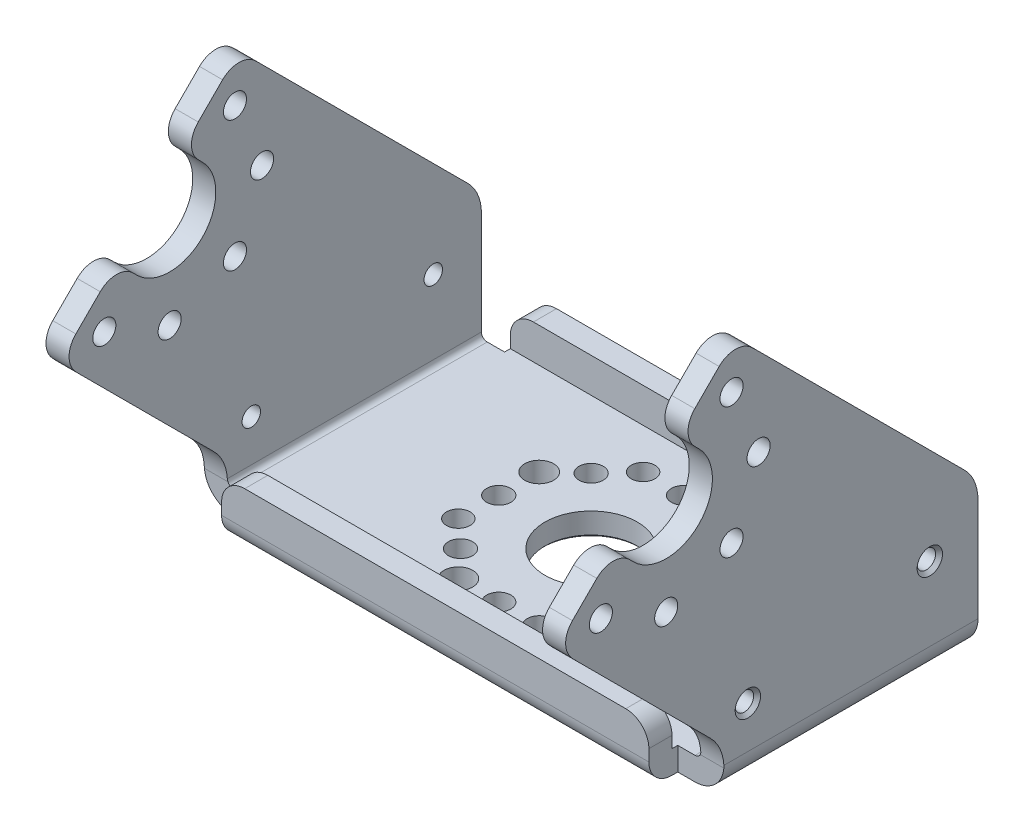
ISO-10303-21;
HEADER;
FILE_DESCRIPTION(('STEP AP214'),'2;1');
FILE_NAME('part.step','',(''),(''),'','','');
FILE_SCHEMA(('AUTOMOTIVE_DESIGN { 1 0 10303 214 1 1 1 1 }'));
ENDSEC;
DATA;
#1=APPLICATION_CONTEXT('core data for automotive mechanical design processes');
#2=APPLICATION_PROTOCOL_DEFINITION('international standard','automotive_design',2000,#1);
#3=PRODUCT_CONTEXT('',#1,'mechanical');
#4=PRODUCT('Part','Part','',(#3));
#5=PRODUCT_RELATED_PRODUCT_CATEGORY('part','',(#4));
#6=PRODUCT_DEFINITION_FORMATION('','',#4);
#7=PRODUCT_DEFINITION_CONTEXT('part definition',#1,'design');
#8=PRODUCT_DEFINITION('design','',#6,#7);
#9=PRODUCT_DEFINITION_SHAPE('','',#8);
#10=(LENGTH_UNIT() NAMED_UNIT(*) SI_UNIT(.MILLI.,.METRE.));
#11=(NAMED_UNIT(*) PLANE_ANGLE_UNIT() SI_UNIT($,.RADIAN.));
#12=(NAMED_UNIT(*) SI_UNIT($,.STERADIAN.) SOLID_ANGLE_UNIT());
#13=UNCERTAINTY_MEASURE_WITH_UNIT(LENGTH_MEASURE(1.E-05),#10,'distance_accuracy_value','');
#14=(GEOMETRIC_REPRESENTATION_CONTEXT(3) GLOBAL_UNCERTAINTY_ASSIGNED_CONTEXT((#13)) GLOBAL_UNIT_ASSIGNED_CONTEXT((#10,
#11,#12)) REPRESENTATION_CONTEXT('',''));
#15=CARTESIAN_POINT('',(0.,0.,0.));
#16=DIRECTION('',(0.,0.,1.));
#17=DIRECTION('',(1.,0.,0.));
#18=AXIS2_PLACEMENT_3D('',#15,#16,#17);
#19=CARTESIAN_POINT('',(104.499999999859,-21.40640546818,-1.82799186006));
#20=DIRECTION('',(1.,0.,0.));
#21=DIRECTION('',(0.,1.,0.));
#22=AXIS2_PLACEMENT_3D('',#19,#20,#21);
#23=CONICAL_SURFACE('',#22,1.09999999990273,0.785398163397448);
#24=CARTESIAN_POINT('',(104.2,-21.40640546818,-1.82799186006));
#25=DIRECTION('',(-1.,0.,0.));
#26=DIRECTION('',(0.,0.,1.));
#27=AXIS2_PLACEMENT_3D('',#24,#25,#26);
#28=CIRCLE('',#27,0.8);
#29=CARTESIAN_POINT('',(104.2,-21.40640546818,-1.02799186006));
#30=VERTEX_POINT('',#29);
#31=EDGE_CURVE('E1119',#30,#30,#28,.T.);
#32=ORIENTED_EDGE('',*,*,#31,.T.);
#33=EDGE_LOOP('',(#32));
#34=FACE_BOUND('',#33,.T.);
#35=CARTESIAN_POINT('',(104.499999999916,-21.40640546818,-1.82799186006));
#36=DIRECTION('',(1.,0.,0.));
#37=DIRECTION('',(0.,1.,0.));
#38=AXIS2_PLACEMENT_3D('',#35,#36,#37);
#39=CIRCLE('',#38,1.09999999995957);
#40=CARTESIAN_POINT('',(104.499999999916,-20.3064054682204,-1.82799186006));
#41=VERTEX_POINT('',#40);
#42=EDGE_CURVE('E1452',#41,#41,#39,.F.);
#43=ORIENTED_EDGE('',*,*,#42,.F.);
#44=EDGE_LOOP('',(#43));
#45=FACE_BOUND('',#44,.T.);
#46=ADVANCED_FACE('F17',(#34,#45),#23,.F.);
#47=CARTESIAN_POINT('',(104.499999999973,-24.18477631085,13.928932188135));
#48=DIRECTION('',(1.,0.,0.));
#49=DIRECTION('',(0.,0.,-1.));
#50=AXIS2_PLACEMENT_3D('',#47,#48,#49);
#51=CONICAL_SURFACE('',#50,1.09999999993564,0.785398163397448);
#52=CARTESIAN_POINT('',(104.2,-24.18477631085,13.928932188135));
#53=DIRECTION('',(-1.,0.,0.));
#54=DIRECTION('',(0.,0.,1.));
#55=AXIS2_PLACEMENT_3D('',#52,#53,#54);
#56=CIRCLE('',#55,0.799999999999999);
#57=CARTESIAN_POINT('',(104.2,-24.18477631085,14.728932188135));
#58=VERTEX_POINT('',#57);
#59=EDGE_CURVE('E1115',#58,#58,#56,.T.);
#60=ORIENTED_EDGE('',*,*,#59,.T.);
#61=EDGE_LOOP('',(#60));
#62=FACE_BOUND('',#61,.T.);
#63=CARTESIAN_POINT('',(104.50000000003,-24.18477631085,13.928932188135));
#64=DIRECTION('',(1.,0.,0.));
#65=DIRECTION('',(0.,0.,-1.));
#66=AXIS2_PLACEMENT_3D('',#63,#64,#65);
#67=CIRCLE('',#66,1.09999999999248);
#68=CARTESIAN_POINT('',(104.50000000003,-24.18477631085,12.8289321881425));
#69=VERTEX_POINT('',#68);
#70=EDGE_CURVE('E1307',#69,#69,#67,.F.);
#71=ORIENTED_EDGE('',*,*,#70,.F.);
#72=EDGE_LOOP('',(#71));
#73=FACE_BOUND('',#72,.T.);
#74=ADVANCED_FACE('F1438',(#62,#73),#51,.F.);
#75=CARTESIAN_POINT('',(104.505837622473,-28.0132034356,16.));
#76=DIRECTION('',(0.,0.,1.));
#77=DIRECTION('',(1.,0.,0.));
#78=AXIS2_PLACEMENT_3D('',#75,#76,#77);
#79=PLANE('',#78);
#80=DIRECTION('',(0.,1.,0.));
#81=VECTOR('',#80,1.);
#82=CARTESIAN_POINT('',(100.5,-30.312,16.));
#83=LINE('',#82,#81);
#84=CARTESIAN_POINT('',(100.5,-30.3,16.));
#85=VERTEX_POINT('',#84);
#86=CARTESIAN_POINT('',(100.5,-28.3,16.));
#87=VERTEX_POINT('',#86);
#88=EDGE_CURVE('E779',#85,#87,#83,.T.);
#89=ORIENTED_EDGE('',*,*,#88,.F.);
#90=DIRECTION('',(1.,0.,0.));
#91=VECTOR('',#90,1.);
#92=CARTESIAN_POINT('',(104.505837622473,-30.3,16.));
#93=LINE('',#92,#91);
#94=CARTESIAN_POINT('',(102.,-30.3,16.));
#95=VERTEX_POINT('',#94);
#96=EDGE_CURVE('E1302',#85,#95,#93,.T.);
#97=ORIENTED_EDGE('',*,*,#96,.T.);
#98=CARTESIAN_POINT('',(102.,-27.8,16.));
#99=DIRECTION('',(0.,0.,1.));
#100=DIRECTION('',(1.,0.,0.));
#101=AXIS2_PLACEMENT_3D('',#98,#99,#100);
#102=CIRCLE('',#101,2.5000000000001);
#103=CARTESIAN_POINT('',(104.490892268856,-28.0132034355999,16.));
#104=VERTEX_POINT('',#103);
#105=EDGE_CURVE('E280',#104,#95,#102,.F.);
#106=ORIENTED_EDGE('',*,*,#105,.F.);
#107=DIRECTION('',(1.,0.,0.));
#108=VECTOR('',#107,1.);
#109=CARTESIAN_POINT('',(104.505837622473,-28.0132034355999,16.));
#110=LINE('',#109,#108);
#111=CARTESIAN_POINT('',(102.452265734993,-28.0132034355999,16.));
#112=VERTEX_POINT('',#111);
#113=EDGE_CURVE('E276',#104,#112,#110,.F.);
#114=ORIENTED_EDGE('',*,*,#113,.T.);
#115=CARTESIAN_POINT('',(102.,-27.8,16.));
#116=DIRECTION('',(0.,0.,1.));
#117=DIRECTION('',(1.,0.,0.));
#118=AXIS2_PLACEMENT_3D('',#115,#116,#117);
#119=CIRCLE('',#118,0.500000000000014);
#120=CARTESIAN_POINT('',(102.,-28.3,16.));
#121=VERTEX_POINT('',#120);
#122=EDGE_CURVE('E21',#112,#121,#119,.F.);
#123=ORIENTED_EDGE('',*,*,#122,.T.);
#124=DIRECTION('',(1.,0.,0.));
#125=VECTOR('',#124,1.);
#126=CARTESIAN_POINT('',(104.505837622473,-28.3,16.));
#127=LINE('',#126,#125);
#128=EDGE_CURVE('E274',#121,#87,#127,.F.);
#129=ORIENTED_EDGE('',*,*,#128,.T.);
#130=EDGE_LOOP('',(#89,#97,#106,#114,#123,#129));
#131=FACE_BOUND('',#130,.T.);
#132=ADVANCED_FACE('F278',(#131),#79,.T.);
#133=CARTESIAN_POINT('',(104.7,-5.80000000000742,21.0000000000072));
#134=DIRECTION('',(-1.,0.,0.));
#135=DIRECTION('',(0.,0.,1.));
#136=AXIS2_PLACEMENT_3D('',#133,#134,#135);
#137=CYLINDRICAL_SURFACE('',#136,10.9999999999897);
#138=CARTESIAN_POINT('',(102.5,-5.80000000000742,21.0000000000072));
#139=DIRECTION('',(-1.,0.,0.));
#140=DIRECTION('',(0.,0.,1.));
#141=AXIS2_PLACEMENT_3D('',#138,#139,#140);
#142=CIRCLE('',#141,10.9999999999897);
#143=CARTESIAN_POINT('',(102.5,-13.1340411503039,29.1982827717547));
#144=VERTEX_POINT('',#143);
#145=CARTESIAN_POINT('',(102.5,-13.5781745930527,28.7781745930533));
#146=VERTEX_POINT('',#145);
#147=EDGE_CURVE('E862',#144,#146,#142,.F.);
#148=ORIENTED_EDGE('',*,*,#147,.T.);
#149=DIRECTION('',(1.,0.,0.));
#150=VECTOR('',#149,1.);
#151=CARTESIAN_POINT('',(102.5,-13.5781745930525,28.7781745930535));
#152=LINE('',#151,#150);
#153=CARTESIAN_POINT('',(104.5,-13.5781745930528,28.7781745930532));
#154=VERTEX_POINT('',#153);
#155=EDGE_CURVE('E871',#154,#146,#152,.F.);
#156=ORIENTED_EDGE('',*,*,#155,.F.);
#157=CARTESIAN_POINT('',(104.5,-5.80000000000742,21.0000000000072));
#158=DIRECTION('',(-1.,0.,0.));
#159=DIRECTION('',(0.,0.,1.));
#160=AXIS2_PLACEMENT_3D('',#157,#158,#159);
#161=CIRCLE('',#160,10.9999999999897);
#162=CARTESIAN_POINT('',(104.5,-13.1340411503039,29.1982827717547));
#163=VERTEX_POINT('',#162);
#164=EDGE_CURVE('E1304',#163,#154,#161,.F.);
#165=ORIENTED_EDGE('',*,*,#164,.F.);
#166=DIRECTION('',(-1.,0.,0.));
#167=VECTOR('',#166,1.);
#168=CARTESIAN_POINT('',(104.7,-13.134041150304,29.1982827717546));
#169=LINE('',#168,#167);
#170=EDGE_CURVE('E938',#144,#163,#169,.F.);
#171=ORIENTED_EDGE('',*,*,#170,.F.);
#172=EDGE_LOOP('',(#148,#156,#165,#171));
#173=FACE_BOUND('',#172,.T.);
#174=ADVANCED_FACE('F1303',(#173),#137,.T.);
#175=CARTESIAN_POINT('',(102.5,-8.62842712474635,23.8284271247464));
#176=DIRECTION('',(0.,0.707106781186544,-0.707106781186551));
#177=DIRECTION('',(0.,0.707106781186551,0.707106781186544));
#178=AXIS2_PLACEMENT_3D('',#175,#176,#177);
#179=PLANE('',#178);
#180=DIRECTION('',(0.,0.707106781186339,0.707106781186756));
#181=VECTOR('',#180,1.);
#182=CARTESIAN_POINT('',(104.5,-8.62842712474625,23.8284271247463));
#183=LINE('',#182,#181);
#184=CARTESIAN_POINT('',(104.5,-8.62842712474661,23.8284271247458));
#185=VERTEX_POINT('',#184);
#186=CARTESIAN_POINT('',(104.5,-8.27487373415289,24.1819805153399));
#187=VERTEX_POINT('',#186);
#188=EDGE_CURVE('E1308',#185,#187,#183,.T.);
#189=ORIENTED_EDGE('',*,*,#188,.F.);
#190=DIRECTION('',(-1.,0.,0.));
#191=VECTOR('',#190,1.);
#192=CARTESIAN_POINT('',(104.7,-8.62842712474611,23.8284271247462));
#193=LINE('',#192,#191);
#194=CARTESIAN_POINT('',(102.5,-8.62842712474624,23.8284271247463));
#195=VERTEX_POINT('',#194);
#196=EDGE_CURVE('E952',#185,#195,#193,.T.);
#197=ORIENTED_EDGE('',*,*,#196,.T.);
#198=DIRECTION('',(0.,0.707106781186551,0.707106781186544));
#199=VECTOR('',#198,1.);
#200=CARTESIAN_POINT('',(102.5,-8.62842712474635,23.8284271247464));
#201=LINE('',#200,#199);
#202=CARTESIAN_POINT('',(102.5,-8.2748737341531,24.1819805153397));
#203=VERTEX_POINT('',#202);
#204=EDGE_CURVE('E859',#195,#203,#201,.T.);
#205=ORIENTED_EDGE('',*,*,#204,.T.);
#206=DIRECTION('',(-1.,0.,0.));
#207=VECTOR('',#206,1.);
#208=CARTESIAN_POINT('',(104.7,-8.27487373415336,24.1819805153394));
#209=LINE('',#208,#207);
#210=EDGE_CURVE('E947',#187,#203,#209,.T.);
#211=ORIENTED_EDGE('',*,*,#210,.F.);
#212=EDGE_LOOP('',(#189,#197,#205,#211));
#213=FACE_BOUND('',#212,.T.);
#214=ADVANCED_FACE('F1429',(#213),#179,.T.);
#215=CARTESIAN_POINT('',(102.5,-2.9715725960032,18.1715731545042));
#216=DIRECTION('',(0.,-0.707106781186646,0.70710678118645));
#217=DIRECTION('',(0.,-0.70710678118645,-0.707106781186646));
#218=AXIS2_PLACEMENT_3D('',#215,#216,#217);
#219=PLANE('',#218);
#220=DIRECTION('',(-1.,0.,0.));
#221=VECTOR('',#220,1.);
#222=CARTESIAN_POINT('',(104.7,-2.61801948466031,18.5251262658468));
#223=LINE('',#222,#221);
#224=CARTESIAN_POINT('',(102.5,-2.61801948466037,18.5251262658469));
#225=VERTEX_POINT('',#224);
#226=CARTESIAN_POINT('',(104.5,-2.61801948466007,18.5251262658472));
#227=VERTEX_POINT('',#226);
#228=EDGE_CURVE('E956',#225,#227,#223,.F.);
#229=ORIENTED_EDGE('',*,*,#228,.F.);
#230=DIRECTION('',(0.,-0.70710678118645,-0.707106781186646));
#231=VECTOR('',#230,1.);
#232=CARTESIAN_POINT('',(102.5,-2.9715725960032,18.1715731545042));
#233=LINE('',#232,#231);
#234=CARTESIAN_POINT('',(102.5,-2.97157280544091,18.1715729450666));
#235=VERTEX_POINT('',#234);
#236=EDGE_CURVE('E855',#225,#235,#233,.T.);
#237=ORIENTED_EDGE('',*,*,#236,.T.);
#238=DIRECTION('',(-1.,0.,0.));
#239=VECTOR('',#238,1.);
#240=CARTESIAN_POINT('',(104.7,-2.9715727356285,18.171573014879));
#241=LINE('',#240,#239);
#242=CARTESIAN_POINT('',(104.5,-2.97157280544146,18.1715729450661));
#243=VERTEX_POINT('',#242);
#244=EDGE_CURVE('E946',#235,#243,#241,.F.);
#245=ORIENTED_EDGE('',*,*,#244,.T.);
#246=DIRECTION('',(0.,-0.707106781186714,-0.707106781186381));
#247=VECTOR('',#246,1.);
#248=CARTESIAN_POINT('',(104.5,-2.61801948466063,18.5251262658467));
#249=LINE('',#248,#247);
#250=EDGE_CURVE('E858',#227,#243,#249,.T.);
#251=ORIENTED_EDGE('',*,*,#250,.F.);
#252=EDGE_LOOP('',(#229,#237,#245,#251));
#253=FACE_BOUND('',#252,.T.);
#254=ADVANCED_FACE('F1425',(#253),#219,.T.);
#255=CARTESIAN_POINT('',(104.5,-27.8,29.921932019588));
#256=DIRECTION('',(1.,0.,0.));
#257=DIRECTION('',(0.,0.,-1.));
#258=AXIS2_PLACEMENT_3D('',#255,#256,#257);
#259=PLANE('',#258);
#260=ORIENTED_EDGE('',*,*,#42,.T.);
#261=EDGE_LOOP('',(#260));
#262=FACE_BOUND('',#261,.T.);
#263=ORIENTED_EDGE('',*,*,#70,.T.);
#264=EDGE_LOOP('',(#263));
#265=FACE_BOUND('',#264,.T.);
#266=CARTESIAN_POINT('',(104.5,-11.456854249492,26.656854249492));
#267=DIRECTION('',(1.,0.,0.));
#268=DIRECTION('',(0.,0.,-1.));
#269=AXIS2_PLACEMENT_3D('',#266,#267,#268);
#270=CIRCLE('',#269,1.);
#271=CARTESIAN_POINT('',(104.5,-11.456854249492,25.656854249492));
#272=VERTEX_POINT('',#271);
#273=EDGE_CURVE('E1118',#272,#272,#270,.F.);
#274=ORIENTED_EDGE('',*,*,#273,.T.);
#275=EDGE_LOOP('',(#274));
#276=FACE_BOUND('',#275,.T.);
#277=CARTESIAN_POINT('',(104.5,-13.8,21.));
#278=DIRECTION('',(1.,0.,0.));
#279=DIRECTION('',(0.,0.,-1.));
#280=AXIS2_PLACEMENT_3D('',#277,#278,#279);
#281=CIRCLE('',#280,1.);
#282=CARTESIAN_POINT('',(104.5,-13.8,20.));
#283=VERTEX_POINT('',#282);
#284=EDGE_CURVE('E1479',#283,#283,#281,.F.);
#285=ORIENTED_EDGE('',*,*,#284,.T.);
#286=EDGE_LOOP('',(#285));
#287=FACE_BOUND('',#286,.T.);
#288=CARTESIAN_POINT('',(104.5,-11.456854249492,15.343145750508));
#289=DIRECTION('',(1.,0.,0.));
#290=DIRECTION('',(0.,0.,-1.));
#291=AXIS2_PLACEMENT_3D('',#288,#289,#290);
#292=CIRCLE('',#291,0.999999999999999);
#293=CARTESIAN_POINT('',(104.5,-11.456854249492,14.343145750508));
#294=VERTEX_POINT('',#293);
#295=EDGE_CURVE('E1482',#294,#294,#292,.F.);
#296=ORIENTED_EDGE('',*,*,#295,.T.);
#297=EDGE_LOOP('',(#296));
#298=FACE_BOUND('',#297,.T.);
#299=CARTESIAN_POINT('',(104.5,-5.7999999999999,13.));
#300=DIRECTION('',(1.,0.,0.));
#301=DIRECTION('',(0.,0.,-1.));
#302=AXIS2_PLACEMENT_3D('',#299,#300,#301);
#303=CIRCLE('',#302,1.);
#304=CARTESIAN_POINT('',(104.5,-5.7999999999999,12.));
#305=VERTEX_POINT('',#304);
#306=EDGE_CURVE('E1485',#305,#305,#303,.F.);
#307=ORIENTED_EDGE('',*,*,#306,.T.);
#308=EDGE_LOOP('',(#307));
#309=FACE_BOUND('',#308,.T.);
#310=CARTESIAN_POINT('',(104.5,-0.143145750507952,15.343145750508));
#311=DIRECTION('',(1.,0.,0.));
#312=DIRECTION('',(0.,0.,-1.));
#313=AXIS2_PLACEMENT_3D('',#310,#311,#312);
#314=CIRCLE('',#313,0.999999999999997);
#315=CARTESIAN_POINT('',(104.5,-0.143145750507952,14.343145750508));
#316=VERTEX_POINT('',#315);
#317=EDGE_CURVE('E927',#316,#316,#314,.F.);
#318=ORIENTED_EDGE('',*,*,#317,.T.);
#319=EDGE_LOOP('',(#318));
#320=FACE_BOUND('',#319,.T.);
#321=CARTESIAN_POINT('',(104.5,-28.0132034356,19.9999999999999));
#322=DIRECTION('',(1.,0.,0.));
#323=DIRECTION('',(0.,0.,-1.));
#324=AXIS2_PLACEMENT_3D('',#321,#322,#323);
#325=CIRCLE('',#324,3.99999999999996);
#326=CARTESIAN_POINT('',(104.5,-25.184776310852,17.171572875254));
#327=VERTEX_POINT('',#326);
#328=CARTESIAN_POINT('',(104.5,-27.8,16.0056860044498));
#329=VERTEX_POINT('',#328);
#330=EDGE_CURVE('E292',#327,#329,#325,.F.);
#331=ORIENTED_EDGE('',*,*,#330,.T.);
#332=DIRECTION('',(0.,0.,1.));
#333=VECTOR('',#332,1.);
#334=CARTESIAN_POINT('',(104.5,-27.8,-6.));
#335=LINE('',#334,#333);
#336=CARTESIAN_POINT('',(104.5,-27.8,-6.));
#337=VERTEX_POINT('',#336);
#338=EDGE_CURVE('E1134',#337,#329,#335,.T.);
#339=ORIENTED_EDGE('',*,*,#338,.F.);
#340=DIRECTION('',(0.,1.,0.));
#341=VECTOR('',#340,1.);
#342=CARTESIAN_POINT('',(104.5,-30.315,-6.));
#343=LINE('',#342,#341);
#344=CARTESIAN_POINT('',(104.5,-18.90050506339,-6.));
#345=VERTEX_POINT('',#344);
#346=EDGE_CURVE('E293',#345,#337,#343,.F.);
#347=ORIENTED_EDGE('',*,*,#346,.F.);
#348=CARTESIAN_POINT('',(104.5,-18.90050506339,-2.00000000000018));
#349=DIRECTION('',(-1.,0.,0.));
#350=DIRECTION('',(0.,0.,1.));
#351=AXIS2_PLACEMENT_3D('',#348,#349,#350);
#352=CIRCLE('',#351,3.99999999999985);
#353=CARTESIAN_POINT('',(104.5,-16.0720779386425,-4.82842712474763));
#354=VERTEX_POINT('',#353);
#355=EDGE_CURVE('E930',#354,#345,#352,.T.);
#356=ORIENTED_EDGE('',*,*,#355,.F.);
#357=DIRECTION('',(0.,0.707106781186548,0.707106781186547));
#358=VECTOR('',#357,1.);
#359=CARTESIAN_POINT('',(104.5,-16.072077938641,-4.828427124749));
#360=LINE('',#359,#358);
#361=CARTESIAN_POINT('',(104.5,1.9781745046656,13.2218253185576));
#362=VERTEX_POINT('',#361);
#363=EDGE_CURVE('E874',#362,#354,#360,.F.);
#364=ORIENTED_EDGE('',*,*,#363,.F.);
#365=CARTESIAN_POINT('',(104.5,-5.80000000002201,21.0000000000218));
#366=DIRECTION('',(-1.,0.,0.));
#367=DIRECTION('',(0.,0.,1.));
#368=AXIS2_PLACEMENT_3D('',#365,#366,#367);
#369=CIRCLE('',#368,11.000000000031);
#370=CARTESIAN_POINT('',(104.5,2.39828277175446,13.6659588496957));
#371=VERTEX_POINT('',#370);
#372=EDGE_CURVE('E1455',#371,#362,#369,.T.);
#373=ORIENTED_EDGE('',*,*,#372,.F.);
#374=CARTESIAN_POINT('',(104.5,0.907685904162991,14.9994208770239));
#375=DIRECTION('',(-1.,0.,0.));
#376=DIRECTION('',(0.,0.,1.));
#377=AXIS2_PLACEMENT_3D('',#374,#375,#376);
#378=CIRCLE('',#377,2.00000000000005);
#379=CARTESIAN_POINT('',(104.5,2.32189946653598,16.4136344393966));
#380=VERTEX_POINT('',#379);
#381=EDGE_CURVE('E853',#380,#371,#378,.T.);
#382=ORIENTED_EDGE('',*,*,#381,.F.);
#383=DIRECTION('',(0.,-0.707106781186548,0.707106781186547));
#384=VECTOR('',#383,1.);
#385=CARTESIAN_POINT('',(104.5,2.32189946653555,16.4136344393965));
#386=LINE('',#385,#384);
#387=CARTESIAN_POINT('',(104.5,0.210407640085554,18.5251262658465));
#388=VERTEX_POINT('',#387);
#389=EDGE_CURVE('E850',#388,#380,#386,.F.);
#390=ORIENTED_EDGE('',*,*,#389,.F.);
#391=CARTESIAN_POINT('',(104.5,-1.20380592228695,17.110912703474));
#392=DIRECTION('',(-1.,0.,0.));
#393=DIRECTION('',(0.,0.,1.));
#394=AXIS2_PLACEMENT_3D('',#391,#392,#393);
#395=CIRCLE('',#394,2.00000000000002);
#396=EDGE_CURVE('E955',#227,#388,#395,.T.);
#397=ORIENTED_EDGE('',*,*,#396,.F.);
#398=ORIENTED_EDGE('',*,*,#250,.T.);
#399=CARTESIAN_POINT('',(104.5,-5.79999999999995,21.));
#400=DIRECTION('',(-1.,0.,0.));
#401=DIRECTION('',(0.,0.,1.));
#402=AXIS2_PLACEMENT_3D('',#399,#400,#401);
#403=CIRCLE('',#402,3.99999999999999);
#404=EDGE_CURVE('E951',#243,#185,#403,.T.);
#405=ORIENTED_EDGE('',*,*,#404,.T.);
#406=ORIENTED_EDGE('',*,*,#188,.T.);
#407=CARTESIAN_POINT('',(104.5,-9.68908729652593,25.596194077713));
#408=DIRECTION('',(-1.,0.,0.));
#409=DIRECTION('',(0.,0.,1.));
#410=AXIS2_PLACEMENT_3D('',#407,#408,#409);
#411=CIRCLE('',#410,1.99999999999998);
#412=CARTESIAN_POINT('',(104.5,-8.274873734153,27.0104076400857));
#413=VERTEX_POINT('',#412);
#414=EDGE_CURVE('E866',#413,#187,#411,.T.);
#415=ORIENTED_EDGE('',*,*,#414,.F.);
#416=DIRECTION('',(0.,-0.707106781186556,0.707106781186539));
#417=VECTOR('',#416,1.);
#418=CARTESIAN_POINT('',(104.5,-8.27487373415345,27.0104076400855));
#419=LINE('',#418,#417);
#420=CARTESIAN_POINT('',(104.5,-10.3863655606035,29.1218994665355));
#421=VERTEX_POINT('',#420);
#422=EDGE_CURVE('E863',#421,#413,#419,.F.);
#423=ORIENTED_EDGE('',*,*,#422,.F.);
#424=CARTESIAN_POINT('',(104.5,-11.800579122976,27.707685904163));
#425=DIRECTION('',(-1.,0.,0.));
#426=DIRECTION('',(0.,0.,1.));
#427=AXIS2_PLACEMENT_3D('',#424,#425,#426);
#428=CIRCLE('',#427,1.99999999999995);
#429=EDGE_CURVE('E935',#163,#421,#428,.T.);
#430=ORIENTED_EDGE('',*,*,#429,.F.);
#431=ORIENTED_EDGE('',*,*,#164,.T.);
#432=DIRECTION('',(0.,-0.707106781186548,-0.707106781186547));
#433=VECTOR('',#432,1.);
#434=CARTESIAN_POINT('',(104.5,-13.578174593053,28.778174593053));
#435=LINE('',#434,#433);
#436=EDGE_CURVE('E868',#327,#154,#435,.F.);
#437=ORIENTED_EDGE('',*,*,#436,.F.);
#438=EDGE_LOOP('',(#331,#339,#347,#356,#364,#373,#382,#390,#397,#398,#405,#406,#415,#423,#430,
#431,#437));
#439=FACE_BOUND('',#438,.T.);
#440=ADVANCED_FACE('F1310',(#262,#265,#276,#287,#298,#309,#320,#439),#259,.T.);
#441=CARTESIAN_POINT('',(104.7,-5.80000000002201,21.0000000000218));
#442=DIRECTION('',(-1.,0.,0.));
#443=DIRECTION('',(0.,0.,1.));
#444=AXIS2_PLACEMENT_3D('',#441,#442,#443);
#445=CYLINDRICAL_SURFACE('',#444,11.000000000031);
#446=ORIENTED_EDGE('',*,*,#372,.T.);
#447=DIRECTION('',(1.,0.,0.));
#448=VECTOR('',#447,1.);
#449=CARTESIAN_POINT('',(102.5,1.97817441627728,13.2218252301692));
#450=LINE('',#449,#448);
#451=CARTESIAN_POINT('',(102.5,1.97817450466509,13.2218253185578));
#452=VERTEX_POINT('',#451);
#453=EDGE_CURVE('E877',#452,#362,#450,.T.);
#454=ORIENTED_EDGE('',*,*,#453,.F.);
#455=CARTESIAN_POINT('',(102.5,-5.80000000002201,21.0000000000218));
#456=DIRECTION('',(-1.,0.,0.));
#457=DIRECTION('',(0.,0.,1.));
#458=AXIS2_PLACEMENT_3D('',#455,#456,#457);
#459=CIRCLE('',#458,11.000000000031);
#460=CARTESIAN_POINT('',(102.5,2.39828277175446,13.6659588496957));
#461=VERTEX_POINT('',#460);
#462=EDGE_CURVE('E1453',#452,#461,#459,.F.);
#463=ORIENTED_EDGE('',*,*,#462,.T.);
#464=DIRECTION('',(-1.,0.,0.));
#465=VECTOR('',#464,1.);
#466=CARTESIAN_POINT('',(104.7,2.39828277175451,13.6659588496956));
#467=LINE('',#466,#465);
#468=EDGE_CURVE('E965',#371,#461,#467,.T.);
#469=ORIENTED_EDGE('',*,*,#468,.F.);
#470=EDGE_LOOP('',(#446,#454,#463,#469));
#471=FACE_BOUND('',#470,.T.);
#472=ADVANCED_FACE('F1418',(#471),#445,.T.);
#473=CARTESIAN_POINT('',(59.5000000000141,-21.40640546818,-1.82799186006));
#474=DIRECTION('',(-1.,0.,0.));
#475=DIRECTION('',(0.,0.,1.));
#476=AXIS2_PLACEMENT_3D('',#473,#474,#475);
#477=CONICAL_SURFACE('',#476,1.09999999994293,0.785398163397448);
#478=CARTESIAN_POINT('',(59.4999999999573,-21.40640546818,-1.82799186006));
#479=DIRECTION('',(-1.,0.,0.));
#480=DIRECTION('',(0.,0.,1.));
#481=AXIS2_PLACEMENT_3D('',#478,#479,#480);
#482=CIRCLE('',#481,1.09999999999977);
#483=CARTESIAN_POINT('',(59.4999999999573,-21.40640546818,-0.727991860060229));
#484=VERTEX_POINT('',#483);
#485=EDGE_CURVE('E1470',#484,#484,#482,.F.);
#486=ORIENTED_EDGE('',*,*,#485,.F.);
#487=EDGE_LOOP('',(#486));
#488=FACE_BOUND('',#487,.T.);
#489=CARTESIAN_POINT('',(59.8,-21.40640546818,-1.82799186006));
#490=DIRECTION('',(-1.,0.,0.));
#491=DIRECTION('',(0.,0.,1.));
#492=AXIS2_PLACEMENT_3D('',#489,#490,#491);
#493=CIRCLE('',#492,0.8);
#494=CARTESIAN_POINT('',(59.8,-21.40640546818,-1.02799186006));
#495=VERTEX_POINT('',#494);
#496=EDGE_CURVE('E1098',#495,#495,#493,.F.);
#497=ORIENTED_EDGE('',*,*,#496,.T.);
#498=EDGE_LOOP('',(#497));
#499=FACE_BOUND('',#498,.T.);
#500=ADVANCED_FACE('F1414',(#488,#499),#477,.F.);
#501=CARTESIAN_POINT('',(59.5000000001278,-24.18477631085,13.928932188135));
#502=DIRECTION('',(-1.,0.,0.));
#503=DIRECTION('',(0.,-1.,0.));
#504=AXIS2_PLACEMENT_3D('',#501,#502,#503);
#505=CONICAL_SURFACE('',#504,1.09999999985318,0.785398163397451);
#506=CARTESIAN_POINT('',(59.5000000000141,-24.18477631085,13.928932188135));
#507=DIRECTION('',(-1.,0.,0.));
#508=DIRECTION('',(0.,-1.,0.));
#509=AXIS2_PLACEMENT_3D('',#506,#507,#508);
#510=CIRCLE('',#509,1.09999999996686);
#511=CARTESIAN_POINT('',(59.5000000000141,-25.2847763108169,13.928932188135));
#512=VERTEX_POINT('',#511);
#513=EDGE_CURVE('E1375',#512,#512,#510,.F.);
#514=ORIENTED_EDGE('',*,*,#513,.F.);
#515=EDGE_LOOP('',(#514));
#516=FACE_BOUND('',#515,.T.);
#517=CARTESIAN_POINT('',(59.8,-24.18477631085,13.928932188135));
#518=DIRECTION('',(-1.,0.,0.));
#519=DIRECTION('',(0.,0.,1.));
#520=AXIS2_PLACEMENT_3D('',#517,#518,#519);
#521=CIRCLE('',#520,0.799999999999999);
#522=CARTESIAN_POINT('',(59.8,-24.18477631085,14.728932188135));
#523=VERTEX_POINT('',#522);
#524=EDGE_CURVE('E1094',#523,#523,#521,.F.);
#525=ORIENTED_EDGE('',*,*,#524,.T.);
#526=EDGE_LOOP('',(#525));
#527=FACE_BOUND('',#526,.T.);
#528=ADVANCED_FACE('F1410',(#516,#527),#505,.F.);
#529=CARTESIAN_POINT('',(61.7,-5.80000000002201,21.0000000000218));
#530=DIRECTION('',(-1.,0.,0.));
#531=DIRECTION('',(0.,0.,1.));
#532=AXIS2_PLACEMENT_3D('',#529,#530,#531);
#533=CYLINDRICAL_SURFACE('',#532,11.000000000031);
#534=CARTESIAN_POINT('',(61.5,-5.80000000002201,21.0000000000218));
#535=DIRECTION('',(-1.,0.,0.));
#536=DIRECTION('',(0.,0.,1.));
#537=AXIS2_PLACEMENT_3D('',#534,#535,#536);
#538=CIRCLE('',#537,11.000000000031);
#539=CARTESIAN_POINT('',(61.5,2.39828277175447,13.6659588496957));
#540=VERTEX_POINT('',#539);
#541=CARTESIAN_POINT('',(61.5,1.97817459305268,13.2218254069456));
#542=VERTEX_POINT('',#541);
#543=EDGE_CURVE('E820',#540,#542,#538,.T.);
#544=ORIENTED_EDGE('',*,*,#543,.T.);
#545=DIRECTION('',(1.,0.,0.));
#546=VECTOR('',#545,1.);
#547=CARTESIAN_POINT('',(61.5,1.97817459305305,13.221825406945));
#548=LINE('',#547,#546);
#549=CARTESIAN_POINT('',(59.5,1.97817459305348,13.2218254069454));
#550=VERTEX_POINT('',#549);
#551=EDGE_CURVE('E829',#550,#542,#548,.T.);
#552=ORIENTED_EDGE('',*,*,#551,.F.);
#553=CARTESIAN_POINT('',(59.5,-5.80000000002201,21.0000000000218));
#554=DIRECTION('',(-1.,0.,0.));
#555=DIRECTION('',(0.,0.,1.));
#556=AXIS2_PLACEMENT_3D('',#553,#554,#555);
#557=CIRCLE('',#556,11.000000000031);
#558=CARTESIAN_POINT('',(59.5,2.39828277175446,13.6659588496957));
#559=VERTEX_POINT('',#558);
#560=EDGE_CURVE('E1373',#559,#550,#557,.T.);
#561=ORIENTED_EDGE('',*,*,#560,.F.);
#562=DIRECTION('',(1.,0.,0.));
#563=VECTOR('',#562,1.);
#564=CARTESIAN_POINT('',(59.3,2.39828277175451,13.6659588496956));
#565=LINE('',#564,#563);
#566=EDGE_CURVE('E986',#540,#559,#565,.F.);
#567=ORIENTED_EDGE('',*,*,#566,.F.);
#568=EDGE_LOOP('',(#544,#552,#561,#567));
#569=FACE_BOUND('',#568,.T.);
#570=ADVANCED_FACE('F1407',(#569),#533,.T.);
#571=CARTESIAN_POINT('',(61.5,-2.97157262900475,18.1715731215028));
#572=DIRECTION('',(0.,-0.707106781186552,0.707106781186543));
#573=DIRECTION('',(0.,-0.707106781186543,-0.707106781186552));
#574=AXIS2_PLACEMENT_3D('',#571,#572,#573);
#575=PLANE('',#574);
#576=DIRECTION('',(0.,0.707106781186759,0.707106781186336));
#577=VECTOR('',#576,1.);
#578=CARTESIAN_POINT('',(59.5,-2.97157262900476,18.1715731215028));
#579=LINE('',#578,#577);
#580=CARTESIAN_POINT('',(59.5,-2.97157275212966,18.1715729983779));
#581=VERTEX_POINT('',#580);
#582=CARTESIAN_POINT('',(59.5,-2.61801948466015,18.5251262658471));
#583=VERTEX_POINT('',#582);
#584=EDGE_CURVE('E1366',#581,#583,#579,.T.);
#585=ORIENTED_EDGE('',*,*,#584,.F.);
#586=DIRECTION('',(-1.,0.,0.));
#587=VECTOR('',#586,1.);
#588=CARTESIAN_POINT('',(61.7,-2.97157262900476,18.1715731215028));
#589=LINE('',#588,#587);
#590=CARTESIAN_POINT('',(61.5,-2.97157275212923,18.1715729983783));
#591=VERTEX_POINT('',#590);
#592=EDGE_CURVE('E1000',#581,#591,#589,.F.);
#593=ORIENTED_EDGE('',*,*,#592,.T.);
#594=DIRECTION('',(0.,-0.707106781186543,-0.707106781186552));
#595=VECTOR('',#594,1.);
#596=CARTESIAN_POINT('',(61.5,-2.97157262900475,18.1715731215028));
#597=LINE('',#596,#595);
#598=CARTESIAN_POINT('',(61.5,-2.61801948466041,18.5251262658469));
#599=VERTEX_POINT('',#598);
#600=EDGE_CURVE('E817',#591,#599,#597,.F.);
#601=ORIENTED_EDGE('',*,*,#600,.T.);
#602=DIRECTION('',(1.,0.,0.));
#603=VECTOR('',#602,1.);
#604=CARTESIAN_POINT('',(59.3,-2.61801948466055,18.5251262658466));
#605=LINE('',#604,#603);
#606=EDGE_CURVE('E995',#583,#599,#605,.T.);
#607=ORIENTED_EDGE('',*,*,#606,.F.);
#608=EDGE_LOOP('',(#585,#593,#601,#607));
#609=FACE_BOUND('',#608,.T.);
#610=ADVANCED_FACE('F1371',(#609),#575,.T.);
#611=CARTESIAN_POINT('',(61.5,-8.62842712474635,23.8284271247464));
#612=DIRECTION('',(0.,0.707106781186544,-0.707106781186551));
#613=DIRECTION('',(0.,0.707106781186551,0.707106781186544));
#614=AXIS2_PLACEMENT_3D('',#611,#612,#613);
#615=PLANE('',#614);
#616=DIRECTION('',(1.,0.,0.));
#617=VECTOR('',#616,1.);
#618=CARTESIAN_POINT('',(59.3,-8.27487373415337,24.1819805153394));
#619=LINE('',#618,#617);
#620=CARTESIAN_POINT('',(61.5,-8.2748737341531,24.1819805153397));
#621=VERTEX_POINT('',#620);
#622=CARTESIAN_POINT('',(59.5,-8.27487373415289,24.1819805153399));
#623=VERTEX_POINT('',#622);
#624=EDGE_CURVE('E1004',#621,#623,#619,.F.);
#625=ORIENTED_EDGE('',*,*,#624,.F.);
#626=DIRECTION('',(0.,0.707106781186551,0.707106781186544));
#627=VECTOR('',#626,1.);
#628=CARTESIAN_POINT('',(61.5,-8.62842712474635,23.8284271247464));
#629=LINE('',#628,#627);
#630=CARTESIAN_POINT('',(61.5,-8.62842712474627,23.8284271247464));
#631=VERTEX_POINT('',#630);
#632=EDGE_CURVE('E813',#621,#631,#629,.F.);
#633=ORIENTED_EDGE('',*,*,#632,.T.);
#634=DIRECTION('',(-1.,0.,0.));
#635=VECTOR('',#634,1.);
#636=CARTESIAN_POINT('',(61.7,-8.62842712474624,23.8284271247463));
#637=LINE('',#636,#635);
#638=CARTESIAN_POINT('',(59.5,-8.62842712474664,23.8284271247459));
#639=VERTEX_POINT('',#638);
#640=EDGE_CURVE('E994',#631,#639,#637,.T.);
#641=ORIENTED_EDGE('',*,*,#640,.T.);
#642=DIRECTION('',(0.,-0.707106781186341,-0.707106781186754));
#643=VECTOR('',#642,1.);
#644=CARTESIAN_POINT('',(59.5,-8.27487373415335,24.1819805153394));
#645=LINE('',#644,#643);
#646=EDGE_CURVE('E1362',#623,#639,#645,.T.);
#647=ORIENTED_EDGE('',*,*,#646,.F.);
#648=EDGE_LOOP('',(#625,#633,#641,#647));
#649=FACE_BOUND('',#648,.T.);
#650=ADVANCED_FACE('F1401',(#649),#615,.T.);
#651=CARTESIAN_POINT('',(61.7,-5.80000000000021,20.9999999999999));
#652=DIRECTION('',(-1.,0.,0.));
#653=DIRECTION('',(0.,0.,1.));
#654=AXIS2_PLACEMENT_3D('',#651,#652,#653);
#655=CYLINDRICAL_SURFACE('',#654,10.9999999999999);
#656=CARTESIAN_POINT('',(59.5,-5.80000000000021,20.9999999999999));
#657=DIRECTION('',(-1.,0.,0.));
#658=DIRECTION('',(0.,0.,1.));
#659=AXIS2_PLACEMENT_3D('',#656,#657,#658);
#660=CIRCLE('',#659,10.9999999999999);
#661=CARTESIAN_POINT('',(59.5,-13.5781745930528,28.7781745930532));
#662=VERTEX_POINT('',#661);
#663=CARTESIAN_POINT('',(59.5,-13.1340411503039,29.1982827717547));
#664=VERTEX_POINT('',#663);
#665=EDGE_CURVE('E1357',#662,#664,#660,.T.);
#666=ORIENTED_EDGE('',*,*,#665,.F.);
#667=DIRECTION('',(1.,0.,0.));
#668=VECTOR('',#667,1.);
#669=CARTESIAN_POINT('',(61.5,-13.5781745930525,28.7781745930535));
#670=LINE('',#669,#668);
#671=CARTESIAN_POINT('',(61.5,-13.5781745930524,28.7781745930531));
#672=VERTEX_POINT('',#671);
#673=EDGE_CURVE('E807',#672,#662,#670,.F.);
#674=ORIENTED_EDGE('',*,*,#673,.F.);
#675=CARTESIAN_POINT('',(61.5,-5.80000000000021,20.9999999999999));
#676=DIRECTION('',(-1.,0.,0.));
#677=DIRECTION('',(0.,0.,1.));
#678=AXIS2_PLACEMENT_3D('',#675,#676,#677);
#679=CIRCLE('',#678,10.9999999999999);
#680=CARTESIAN_POINT('',(61.5,-13.1340411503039,29.1982827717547));
#681=VERTEX_POINT('',#680);
#682=EDGE_CURVE('E816',#672,#681,#679,.T.);
#683=ORIENTED_EDGE('',*,*,#682,.T.);
#684=DIRECTION('',(1.,0.,0.));
#685=VECTOR('',#684,1.);
#686=CARTESIAN_POINT('',(59.3,-13.1340411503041,29.1982827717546));
#687=LINE('',#686,#685);
#688=EDGE_CURVE('E1012',#664,#681,#687,.T.);
#689=ORIENTED_EDGE('',*,*,#688,.F.);
#690=EDGE_LOOP('',(#666,#674,#683,#689));
#691=FACE_BOUND('',#690,.T.);
#692=ADVANCED_FACE('F1397',(#691),#655,.T.);
#693=CARTESIAN_POINT('',(62.,-30.3137207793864,16.));
#694=DIRECTION('',(0.,0.,1.));
#695=DIRECTION('',(1.,0.,0.));
#696=AXIS2_PLACEMENT_3D('',#693,#694,#695);
#697=PLANE('',#696);
#698=DIRECTION('',(0.,1.,0.));
#699=VECTOR('',#698,1.);
#700=CARTESIAN_POINT('',(63.5,-30.312,16.));
#701=LINE('',#700,#699);
#702=CARTESIAN_POINT('',(63.5,-28.3,16.));
#703=VERTEX_POINT('',#702);
#704=CARTESIAN_POINT('',(63.5,-30.3,16.));
#705=VERTEX_POINT('',#704);
#706=EDGE_CURVE('E767',#703,#705,#701,.F.);
#707=ORIENTED_EDGE('',*,*,#706,.F.);
#708=DIRECTION('',(1.,0.,0.));
#709=VECTOR('',#708,1.);
#710=CARTESIAN_POINT('',(62.,-28.3,16.));
#711=LINE('',#710,#709);
#712=CARTESIAN_POINT('',(62.,-28.3,16.));
#713=VERTEX_POINT('',#712);
#714=EDGE_CURVE('E1466',#703,#713,#711,.F.);
#715=ORIENTED_EDGE('',*,*,#714,.T.);
#716=CARTESIAN_POINT('',(62.,-27.8,16.));
#717=DIRECTION('',(0.,0.,1.));
#718=DIRECTION('',(1.,0.,0.));
#719=AXIS2_PLACEMENT_3D('',#716,#717,#718);
#720=CIRCLE('',#719,0.499999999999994);
#721=CARTESIAN_POINT('',(61.5477342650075,-28.0132034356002,16.));
#722=VERTEX_POINT('',#721);
#723=EDGE_CURVE('E1463',#713,#722,#720,.F.);
#724=ORIENTED_EDGE('',*,*,#723,.T.);
#725=DIRECTION('',(-1.,0.,0.));
#726=VECTOR('',#725,1.);
#727=CARTESIAN_POINT('',(61.7660227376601,-28.0132034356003,16.));
#728=LINE('',#727,#726);
#729=CARTESIAN_POINT('',(59.5091077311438,-28.0132034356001,16.));
#730=VERTEX_POINT('',#729);
#731=EDGE_CURVE('E806',#722,#730,#728,.T.);
#732=ORIENTED_EDGE('',*,*,#731,.T.);
#733=CARTESIAN_POINT('',(62.0000000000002,-27.8,16.));
#734=DIRECTION('',(0.,0.,1.));
#735=DIRECTION('',(1.,0.,0.));
#736=AXIS2_PLACEMENT_3D('',#733,#734,#735);
#737=CIRCLE('',#736,2.50000000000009);
#738=CARTESIAN_POINT('',(62.0000000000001,-30.3,16.));
#739=VERTEX_POINT('',#738);
#740=EDGE_CURVE('E1129',#739,#730,#737,.F.);
#741=ORIENTED_EDGE('',*,*,#740,.F.);
#742=DIRECTION('',(1.,0.,0.));
#743=VECTOR('',#742,1.);
#744=CARTESIAN_POINT('',(62.,-30.3000000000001,16.));
#745=LINE('',#744,#743);
#746=EDGE_CURVE('E1465',#739,#705,#745,.T.);
#747=ORIENTED_EDGE('',*,*,#746,.T.);
#748=EDGE_LOOP('',(#707,#715,#724,#732,#741,#747));
#749=FACE_BOUND('',#748,.T.);
#750=ADVANCED_FACE('F1393',(#749),#697,.T.);
#751=CARTESIAN_POINT('',(59.5,3.09193201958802,29.921932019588));
#752=DIRECTION('',(-1.,0.,0.));
#753=DIRECTION('',(0.,0.,1.));
#754=AXIS2_PLACEMENT_3D('',#751,#752,#753);
#755=PLANE('',#754);
#756=ORIENTED_EDGE('',*,*,#485,.T.);
#757=EDGE_LOOP('',(#756));
#758=FACE_BOUND('',#757,.T.);
#759=ORIENTED_EDGE('',*,*,#513,.T.);
#760=EDGE_LOOP('',(#759));
#761=FACE_BOUND('',#760,.T.);
#762=CARTESIAN_POINT('',(59.5,-11.456854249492,26.656854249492));
#763=DIRECTION('',(1.,0.,0.));
#764=DIRECTION('',(0.,0.,-1.));
#765=AXIS2_PLACEMENT_3D('',#762,#763,#764);
#766=CIRCLE('',#765,1.);
#767=CARTESIAN_POINT('',(59.5,-11.456854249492,25.656854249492));
#768=VERTEX_POINT('',#767);
#769=EDGE_CURVE('E1097',#768,#768,#766,.T.);
#770=ORIENTED_EDGE('',*,*,#769,.T.);
#771=EDGE_LOOP('',(#770));
#772=FACE_BOUND('',#771,.T.);
#773=CARTESIAN_POINT('',(59.5,-13.8,21.));
#774=DIRECTION('',(1.,0.,0.));
#775=DIRECTION('',(0.,0.,-1.));
#776=AXIS2_PLACEMENT_3D('',#773,#774,#775);
#777=CIRCLE('',#776,1.);
#778=CARTESIAN_POINT('',(59.5,-13.8,20.));
#779=VERTEX_POINT('',#778);
#780=EDGE_CURVE('E1324',#779,#779,#777,.T.);
#781=ORIENTED_EDGE('',*,*,#780,.T.);
#782=EDGE_LOOP('',(#781));
#783=FACE_BOUND('',#782,.T.);
#784=CARTESIAN_POINT('',(59.5,-11.456854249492,15.343145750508));
#785=DIRECTION('',(1.,0.,0.));
#786=DIRECTION('',(0.,0.,-1.));
#787=AXIS2_PLACEMENT_3D('',#784,#785,#786);
#788=CIRCLE('',#787,0.999999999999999);
#789=CARTESIAN_POINT('',(59.5,-11.456854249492,14.343145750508));
#790=VERTEX_POINT('',#789);
#791=EDGE_CURVE('E1327',#790,#790,#788,.T.);
#792=ORIENTED_EDGE('',*,*,#791,.T.);
#793=EDGE_LOOP('',(#792));
#794=FACE_BOUND('',#793,.T.);
#795=CARTESIAN_POINT('',(59.5,-5.7999999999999,13.));
#796=DIRECTION('',(1.,0.,0.));
#797=DIRECTION('',(0.,0.,-1.));
#798=AXIS2_PLACEMENT_3D('',#795,#796,#797);
#799=CIRCLE('',#798,1.);
#800=CARTESIAN_POINT('',(59.5,-5.7999999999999,12.));
#801=VERTEX_POINT('',#800);
#802=EDGE_CURVE('E1330',#801,#801,#799,.T.);
#803=ORIENTED_EDGE('',*,*,#802,.T.);
#804=EDGE_LOOP('',(#803));
#805=FACE_BOUND('',#804,.T.);
#806=CARTESIAN_POINT('',(59.5,-0.143145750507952,15.343145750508));
#807=DIRECTION('',(1.,0.,0.));
#808=DIRECTION('',(0.,0.,-1.));
#809=AXIS2_PLACEMENT_3D('',#806,#807,#808);
#810=CIRCLE('',#809,0.999999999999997);
#811=CARTESIAN_POINT('',(59.5,-0.143145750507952,14.343145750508));
#812=VERTEX_POINT('',#811);
#813=EDGE_CURVE('E1333',#812,#812,#810,.T.);
#814=ORIENTED_EDGE('',*,*,#813,.T.);
#815=EDGE_LOOP('',(#814));
#816=FACE_BOUND('',#815,.T.);
#817=CARTESIAN_POINT('',(59.5,0.907685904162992,14.9994208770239));
#818=DIRECTION('',(1.,0.,0.));
#819=DIRECTION('',(0.,1.,0.));
#820=AXIS2_PLACEMENT_3D('',#817,#818,#819);
#821=CIRCLE('',#820,2.00000000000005);
#822=CARTESIAN_POINT('',(59.5,2.32189946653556,16.4136344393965));
#823=VERTEX_POINT('',#822);
#824=EDGE_CURVE('E982',#559,#823,#821,.T.);
#825=ORIENTED_EDGE('',*,*,#824,.F.);
#826=ORIENTED_EDGE('',*,*,#560,.T.);
#827=DIRECTION('',(0.,0.707106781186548,0.707106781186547));
#828=VECTOR('',#827,1.);
#829=CARTESIAN_POINT('',(59.5,-16.072077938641,-4.828427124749));
#830=LINE('',#829,#828);
#831=CARTESIAN_POINT('',(59.5,-16.0720779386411,-4.82842712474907));
#832=VERTEX_POINT('',#831);
#833=EDGE_CURVE('E826',#832,#550,#830,.T.);
#834=ORIENTED_EDGE('',*,*,#833,.F.);
#835=CARTESIAN_POINT('',(59.5,-18.90050506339,-2.00000000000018));
#836=DIRECTION('',(1.,0.,0.));
#837=DIRECTION('',(0.,0.,-1.));
#838=AXIS2_PLACEMENT_3D('',#835,#836,#837);
#839=CIRCLE('',#838,3.99999999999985);
#840=CARTESIAN_POINT('',(59.5,-18.90050518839,-6.));
#841=VERTEX_POINT('',#840);
#842=EDGE_CURVE('E985',#841,#832,#839,.T.);
#843=ORIENTED_EDGE('',*,*,#842,.F.);
#844=DIRECTION('',(0.,1.,0.));
#845=VECTOR('',#844,1.);
#846=CARTESIAN_POINT('',(59.5,-30.3,-6.));
#847=LINE('',#846,#845);
#848=CARTESIAN_POINT('',(59.5000000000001,-27.8,-6.));
#849=VERTEX_POINT('',#848);
#850=EDGE_CURVE('E1084',#849,#841,#847,.T.);
#851=ORIENTED_EDGE('',*,*,#850,.F.);
#852=DIRECTION('',(0.,0.,1.));
#853=VECTOR('',#852,1.);
#854=CARTESIAN_POINT('',(59.5000000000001,-27.8,-6.));
#855=LINE('',#854,#853);
#856=CARTESIAN_POINT('',(59.5000000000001,-27.8,16.0056860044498));
#857=VERTEX_POINT('',#856);
#858=EDGE_CURVE('E914',#857,#849,#855,.F.);
#859=ORIENTED_EDGE('',*,*,#858,.F.);
#860=CARTESIAN_POINT('',(59.5,-28.0132034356,19.9999999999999));
#861=DIRECTION('',(-1.,0.,0.));
#862=DIRECTION('',(0.,0.,1.));
#863=AXIS2_PLACEMENT_3D('',#860,#861,#862);
#864=CIRCLE('',#863,3.99999999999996);
#865=CARTESIAN_POINT('',(59.5,-25.1847763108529,17.1715728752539));
#866=VERTEX_POINT('',#865);
#867=EDGE_CURVE('E448',#857,#866,#864,.F.);
#868=ORIENTED_EDGE('',*,*,#867,.T.);
#869=DIRECTION('',(0.,-0.707106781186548,-0.707106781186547));
#870=VECTOR('',#869,1.);
#871=CARTESIAN_POINT('',(59.5,-13.578174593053,28.778174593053));
#872=LINE('',#871,#870);
#873=EDGE_CURVE('E803',#662,#866,#872,.T.);
#874=ORIENTED_EDGE('',*,*,#873,.F.);
#875=ORIENTED_EDGE('',*,*,#665,.T.);
#876=CARTESIAN_POINT('',(59.5,-11.800579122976,27.707685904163));
#877=DIRECTION('',(1.,0.,0.));
#878=DIRECTION('',(0.,0.,-1.));
#879=AXIS2_PLACEMENT_3D('',#876,#877,#878);
#880=CIRCLE('',#879,1.99999999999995);
#881=CARTESIAN_POINT('',(59.5,-10.3863655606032,29.1218994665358));
#882=VERTEX_POINT('',#881);
#883=EDGE_CURVE('E811',#882,#664,#880,.T.);
#884=ORIENTED_EDGE('',*,*,#883,.F.);
#885=DIRECTION('',(0.,-0.707106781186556,0.707106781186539));
#886=VECTOR('',#885,1.);
#887=CARTESIAN_POINT('',(59.5,-8.27487373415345,27.0104076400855));
#888=LINE('',#887,#886);
#889=CARTESIAN_POINT('',(59.5,-8.27487373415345,27.0104076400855));
#890=VERTEX_POINT('',#889);
#891=EDGE_CURVE('E808',#890,#882,#888,.T.);
#892=ORIENTED_EDGE('',*,*,#891,.F.);
#893=CARTESIAN_POINT('',(59.5,-9.68908729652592,25.596194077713));
#894=DIRECTION('',(1.,0.,0.));
#895=DIRECTION('',(0.,0.,-1.));
#896=AXIS2_PLACEMENT_3D('',#893,#894,#895);
#897=CIRCLE('',#896,1.99999999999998);
#898=EDGE_CURVE('E1003',#623,#890,#897,.T.);
#899=ORIENTED_EDGE('',*,*,#898,.F.);
#900=ORIENTED_EDGE('',*,*,#646,.T.);
#901=CARTESIAN_POINT('',(59.5,-5.79999999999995,21.0000000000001));
#902=DIRECTION('',(-1.,0.,0.));
#903=DIRECTION('',(0.,0.,1.));
#904=AXIS2_PLACEMENT_3D('',#901,#902,#903);
#905=CIRCLE('',#904,4.00000000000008);
#906=EDGE_CURVE('E999',#639,#581,#905,.F.);
#907=ORIENTED_EDGE('',*,*,#906,.T.);
#908=ORIENTED_EDGE('',*,*,#584,.T.);
#909=CARTESIAN_POINT('',(59.5,-1.20380592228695,17.110912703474));
#910=DIRECTION('',(1.,0.,0.));
#911=DIRECTION('',(0.,0.,-1.));
#912=AXIS2_PLACEMENT_3D('',#909,#910,#911);
#913=CIRCLE('',#912,2.00000000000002);
#914=CARTESIAN_POINT('',(59.5,0.21040764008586,18.5251262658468));
#915=VERTEX_POINT('',#914);
#916=EDGE_CURVE('E824',#915,#583,#913,.T.);
#917=ORIENTED_EDGE('',*,*,#916,.F.);
#918=DIRECTION('',(0.,-0.707106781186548,0.707106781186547));
#919=VECTOR('',#918,1.);
#920=CARTESIAN_POINT('',(59.5,2.32189946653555,16.4136344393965));
#921=LINE('',#920,#919);
#922=EDGE_CURVE('E821',#823,#915,#921,.T.);
#923=ORIENTED_EDGE('',*,*,#922,.F.);
#924=EDGE_LOOP('',(#825,#826,#834,#843,#851,#859,#868,#874,#875,#884,#892,#899,#900,#907,#908,
#917,#923));
#925=FACE_BOUND('',#924,.T.);
#926=ADVANCED_FACE('F1354',(#758,#761,#772,#783,#794,#805,#816,#925),#755,.T.);
#927=CARTESIAN_POINT('',(102.,-27.8,-6.));
#928=DIRECTION('',(0.,0.,1.));
#929=DIRECTION('',(1.,0.,0.));
#930=AXIS2_PLACEMENT_3D('',#927,#928,#929);
#931=CYLINDRICAL_SURFACE('',#930,2.5000000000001);
#932=DIRECTION('',(0.,0.,-1.));
#933=VECTOR('',#932,1.);
#934=CARTESIAN_POINT('',(102.,-30.3,16.5));
#935=LINE('',#934,#933);
#936=CARTESIAN_POINT('',(102.,-30.3,-6.));
#937=VERTEX_POINT('',#936);
#938=EDGE_CURVE('E776',#937,#95,#935,.F.);
#939=ORIENTED_EDGE('',*,*,#938,.F.);
#940=CARTESIAN_POINT('',(102.,-27.8,-6.));
#941=DIRECTION('',(0.,0.,1.));
#942=DIRECTION('',(1.,0.,0.));
#943=AXIS2_PLACEMENT_3D('',#940,#941,#942);
#944=CIRCLE('',#943,2.5000000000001);
#945=EDGE_CURVE('E1111',#337,#937,#944,.F.);
#946=ORIENTED_EDGE('',*,*,#945,.F.);
#947=ORIENTED_EDGE('',*,*,#338,.T.);
#948=CARTESIAN_POINT('',(104.5,-27.8,16.0056860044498));
#949=CARTESIAN_POINT('',(104.500000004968,-27.8088773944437,16.0052121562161));
#950=CARTESIAN_POINT('',(104.499952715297,-27.8177563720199,16.0047679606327));
#951=CARTESIAN_POINT('',(104.499763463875,-27.8355177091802,16.0039387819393));
#952=CARTESIAN_POINT('',(104.499621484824,-27.844400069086,16.003553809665));
#953=CARTESIAN_POINT('',(104.499242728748,-27.8621671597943,16.0028430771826));
#954=CARTESIAN_POINT('',(104.499005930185,-27.871051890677,16.0025173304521));
#955=CARTESIAN_POINT('',(104.498437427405,-27.8888227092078,16.0019250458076));
#956=CARTESIAN_POINT('',(104.498105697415,-27.8977087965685,16.0016585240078));
#957=CARTESIAN_POINT('',(104.497347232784,-27.9154813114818,16.0011846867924));
#958=CARTESIAN_POINT('',(104.496920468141,-27.9243677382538,16.0009773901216));
#959=CARTESIAN_POINT('',(104.495971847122,-27.9421399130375,16.0006220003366));
#960=CARTESIAN_POINT('',(104.495449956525,-27.9510256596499,16.0004739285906));
#961=CARTESIAN_POINT('',(104.494311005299,-27.968795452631,16.0002369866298));
#962=CARTESIAN_POINT('',(104.493693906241,-27.9776794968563,16.0001481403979));
#963=CARTESIAN_POINT('',(104.492364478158,-27.9954448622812,16.0000296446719));
#964=CARTESIAN_POINT('',(104.491652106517,-28.004326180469,16.0000000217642));
#965=CARTESIAN_POINT('',(104.490892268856,-28.0132034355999,16.));
#966=B_SPLINE_CURVE_WITH_KNOTS('',3,(#948,#949,#950,#951,#952,#953,#954,#955,#956,#957,#958,
#959,#960,#961,#962,#963,#964,#965),.UNSPECIFIED.,.F.,.F.,(4,2,2,2,2,2,2,2,4),(0.,
0.026669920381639,0.0533447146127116,0.0800255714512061,0.106713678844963,0.133410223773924,
0.160116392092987,0.18683336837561,0.213562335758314),.UNSPECIFIED.);
#967=EDGE_CURVE('E285',#329,#104,#966,.T.);
#968=ORIENTED_EDGE('',*,*,#967,.T.);
#969=ORIENTED_EDGE('',*,*,#105,.T.);
#970=EDGE_LOOP('',(#939,#946,#947,#968,#969));
#971=FACE_BOUND('',#970,.T.);
#972=ADVANCED_FACE('F1381',(#971),#931,.T.);
#973=CARTESIAN_POINT('',(63.5,-28.3,16.4999999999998));
#974=DIRECTION('',(1.,0.,0.));
#975=DIRECTION('',(0.,0.,-1.));
#976=AXIS2_PLACEMENT_3D('',#973,#974,#975);
#977=CYLINDRICAL_SURFACE('',#976,2.00000000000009);
#978=CARTESIAN_POINT('',(63.5,-28.3,16.4999999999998));
#979=DIRECTION('',(1.,0.,0.));
#980=DIRECTION('',(0.,0.,-1.));
#981=AXIS2_PLACEMENT_3D('',#978,#979,#980);
#982=CIRCLE('',#981,2.00000000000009);
#983=CARTESIAN_POINT('',(63.5,-30.3,16.4999999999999));
#984=VERTEX_POINT('',#983);
#985=CARTESIAN_POINT('',(63.5,-28.3,18.5));
#986=VERTEX_POINT('',#985);
#987=EDGE_CURVE('E911',#984,#986,#982,.F.);
#988=ORIENTED_EDGE('',*,*,#987,.F.);
#989=DIRECTION('',(1.,0.,0.));
#990=VECTOR('',#989,1.);
#991=CARTESIAN_POINT('',(62.,-30.3,16.5));
#992=LINE('',#991,#990);
#993=CARTESIAN_POINT('',(100.5,-30.3,16.4999999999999));
#994=VERTEX_POINT('',#993);
#995=EDGE_CURVE('E759',#994,#984,#992,.F.);
#996=ORIENTED_EDGE('',*,*,#995,.F.);
#997=CARTESIAN_POINT('',(100.5,-28.3,16.4999999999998));
#998=DIRECTION('',(1.,0.,0.));
#999=DIRECTION('',(0.,0.,-1.));
#1000=AXIS2_PLACEMENT_3D('',#997,#998,#999);
#1001=CIRCLE('',#1000,2.00000000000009);
#1002=CARTESIAN_POINT('',(100.5,-28.3,18.5));
#1003=VERTEX_POINT('',#1002);
#1004=EDGE_CURVE('E783',#1003,#994,#1001,.T.);
#1005=ORIENTED_EDGE('',*,*,#1004,.F.);
#1006=DIRECTION('',(1.,0.,0.));
#1007=VECTOR('',#1006,1.);
#1008=CARTESIAN_POINT('',(63.5,-28.3,18.5));
#1009=LINE('',#1008,#1007);
#1010=EDGE_CURVE('E878',#986,#1003,#1009,.T.);
#1011=ORIENTED_EDGE('',*,*,#1010,.F.);
#1012=EDGE_LOOP('',(#988,#996,#1005,#1011));
#1013=FACE_BOUND('',#1012,.T.);
#1014=ADVANCED_FACE('F1146',(#1013),#977,.T.);
#1015=CARTESIAN_POINT('',(62.0000000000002,-27.8,-6.));
#1016=DIRECTION('',(0.,0.,1.));
#1017=DIRECTION('',(1.,0.,0.));
#1018=AXIS2_PLACEMENT_3D('',#1015,#1016,#1017);
#1019=CYLINDRICAL_SURFACE('',#1018,2.50000000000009);
#1020=CARTESIAN_POINT('',(62.0000000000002,-27.8,-6.));
#1021=DIRECTION('',(0.,0.,1.));
#1022=DIRECTION('',(1.,0.,0.));
#1023=AXIS2_PLACEMENT_3D('',#1020,#1021,#1022);
#1024=CIRCLE('',#1023,2.50000000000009);
#1025=CARTESIAN_POINT('',(62.0000000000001,-30.3,-6.));
#1026=VERTEX_POINT('',#1025);
#1027=EDGE_CURVE('E1087',#1026,#849,#1024,.F.);
#1028=ORIENTED_EDGE('',*,*,#1027,.F.);
#1029=DIRECTION('',(0.,0.,-1.));
#1030=VECTOR('',#1029,1.);
#1031=CARTESIAN_POINT('',(62.,-30.3,16.5));
#1032=LINE('',#1031,#1030);
#1033=EDGE_CURVE('E746',#739,#1026,#1032,.T.);
#1034=ORIENTED_EDGE('',*,*,#1033,.F.);
#1035=ORIENTED_EDGE('',*,*,#740,.T.);
#1036=CARTESIAN_POINT('',(59.5091077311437,-28.0132034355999,16.));
#1037=CARTESIAN_POINT('',(59.5083479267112,-28.0043265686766,16.0000000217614));
#1038=CARTESIAN_POINT('',(59.5076355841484,-27.9954456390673,16.000029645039));
#1039=CARTESIAN_POINT('',(59.5063061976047,-27.9776809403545,16.0001481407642));
#1040=CARTESIAN_POINT('',(59.5056891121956,-27.9687971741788,16.0002369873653));
#1041=CARTESIAN_POINT('',(59.5045501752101,-27.951027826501,16.0004739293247));
#1042=CARTESIAN_POINT('',(59.5040282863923,-27.9421422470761,16.0006220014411));
#1043=CARTESIAN_POINT('',(59.5030796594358,-27.9243702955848,16.0009773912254));
#1044=CARTESIAN_POINT('',(59.5026528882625,-27.9154839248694,16.0011846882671));
#1045=CARTESIAN_POINT('',(59.5018944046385,-27.8977114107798,16.0016585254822));
#1046=CARTESIAN_POINT('',(59.5015626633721,-27.8888252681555,16.0019250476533));
#1047=CARTESIAN_POINT('',(59.5009941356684,-27.871054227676,16.0025173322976));
#1048=CARTESIAN_POINT('',(59.5007573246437,-27.8621693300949,16.0028430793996));
#1049=CARTESIAN_POINT('',(59.500378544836,-27.8444017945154,16.003553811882));
#1050=CARTESIAN_POINT('',(59.5002365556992,-27.8355191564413,16.0039387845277));
#1051=CARTESIAN_POINT('',(59.5000472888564,-27.8177571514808,16.0047679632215));
#1052=CARTESIAN_POINT('',(59.4999999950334,-27.808877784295,16.0052121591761));
#1053=CARTESIAN_POINT('',(59.5000000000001,-27.8,16.0056860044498));
#1054=B_SPLINE_CURVE_WITH_KNOTS('',3,(#1036,#1037,#1038,#1039,#1040,#1041,#1042,#1043,#1044,
#1045,#1046,#1047,#1048,#1049,#1050,#1051,#1052,#1053),.UNSPECIFIED.,.F.,.F.,(4,2,2,2,2,2,2,2,
4),(0.,0.0267277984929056,0.0534439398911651,0.0801496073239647,0.106845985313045,
0.133534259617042,0.160215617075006,0.186891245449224,0.213562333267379),.UNSPECIFIED.);
#1055=EDGE_CURVE('E1083',#730,#857,#1054,.T.);
#1056=ORIENTED_EDGE('',*,*,#1055,.T.);
#1057=ORIENTED_EDGE('',*,*,#858,.T.);
#1058=EDGE_LOOP('',(#1028,#1034,#1035,#1056,#1057));
#1059=FACE_BOUND('',#1058,.T.);
#1060=ADVANCED_FACE('F1136',(#1059),#1019,.T.);
#1061=CARTESIAN_POINT('',(100.5,-28.3,-6.49999999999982));
#1062=DIRECTION('',(-1.,0.,0.));
#1063=DIRECTION('',(0.,0.,1.));
#1064=AXIS2_PLACEMENT_3D('',#1061,#1062,#1063);
#1065=CYLINDRICAL_SURFACE('',#1064,2.00000000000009);
#1066=CARTESIAN_POINT('',(100.5,-28.3,-6.49999999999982));
#1067=DIRECTION('',(-1.,0.,0.));
#1068=DIRECTION('',(0.,0.,1.));
#1069=AXIS2_PLACEMENT_3D('',#1066,#1067,#1068);
#1070=CIRCLE('',#1069,2.00000000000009);
#1071=CARTESIAN_POINT('',(100.5,-30.3,-6.49999999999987));
#1072=VERTEX_POINT('',#1071);
#1073=CARTESIAN_POINT('',(100.5,-28.3,-8.5));
#1074=VERTEX_POINT('',#1073);
#1075=EDGE_CURVE('E964',#1072,#1074,#1070,.F.);
#1076=ORIENTED_EDGE('',*,*,#1075,.F.);
#1077=DIRECTION('',(1.,0.,0.));
#1078=VECTOR('',#1077,1.);
#1079=CARTESIAN_POINT('',(62.,-30.3,-6.49999999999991));
#1080=LINE('',#1079,#1078);
#1081=CARTESIAN_POINT('',(63.5,-30.3,-6.49999999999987));
#1082=VERTEX_POINT('',#1081);
#1083=EDGE_CURVE('E726',#1082,#1072,#1080,.T.);
#1084=ORIENTED_EDGE('',*,*,#1083,.F.);
#1085=CARTESIAN_POINT('',(63.5,-28.3,-6.49999999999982));
#1086=DIRECTION('',(-1.,0.,0.));
#1087=DIRECTION('',(0.,0.,1.));
#1088=AXIS2_PLACEMENT_3D('',#1085,#1086,#1087);
#1089=CIRCLE('',#1088,2.00000000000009);
#1090=CARTESIAN_POINT('',(63.5,-28.3,-8.499999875));
#1091=VERTEX_POINT('',#1090);
#1092=EDGE_CURVE('E835',#1091,#1082,#1089,.T.);
#1093=ORIENTED_EDGE('',*,*,#1092,.F.);
#1094=DIRECTION('',(-1.,0.,0.));
#1095=VECTOR('',#1094,1.);
#1096=CARTESIAN_POINT('',(100.5,-28.3,-8.5));
#1097=LINE('',#1096,#1095);
#1098=EDGE_CURVE('E838',#1074,#1091,#1097,.T.);
#1099=ORIENTED_EDGE('',*,*,#1098,.F.);
#1100=EDGE_LOOP('',(#1076,#1084,#1093,#1099));
#1101=FACE_BOUND('',#1100,.T.);
#1102=ADVANCED_FACE('F1145',(#1101),#1065,.T.);
#1103=CARTESIAN_POINT('',(63.5,-30.312,18.512));
#1104=DIRECTION('',(-1.,0.,0.));
#1105=DIRECTION('',(0.,0.,1.));
#1106=AXIS2_PLACEMENT_3D('',#1103,#1104,#1105);
#1107=PLANE('',#1106);
#1108=ORIENTED_EDGE('',*,*,#706,.T.);
#1109=DIRECTION('',(0.,0.,-1.));
#1110=VECTOR('',#1109,1.);
#1111=CARTESIAN_POINT('',(63.5,-30.3,16.5));
#1112=LINE('',#1111,#1110);
#1113=EDGE_CURVE('E751',#984,#705,#1112,.T.);
#1114=ORIENTED_EDGE('',*,*,#1113,.F.);
#1115=ORIENTED_EDGE('',*,*,#987,.T.);
#1116=DIRECTION('',(0.,1.,0.));
#1117=VECTOR('',#1116,1.);
#1118=CARTESIAN_POINT('',(63.5,-25.3,18.5));
#1119=LINE('',#1118,#1117);
#1120=CARTESIAN_POINT('',(63.5,-27.3,18.5));
#1121=VERTEX_POINT('',#1120);
#1122=EDGE_CURVE('E770',#1121,#986,#1119,.F.);
#1123=ORIENTED_EDGE('',*,*,#1122,.F.);
#1124=DIRECTION('',(0.,0.,1.));
#1125=VECTOR('',#1124,1.);
#1126=CARTESIAN_POINT('',(63.5,-27.3,16.3));
#1127=LINE('',#1126,#1125);
#1128=CARTESIAN_POINT('',(63.5,-27.3,16.5));
#1129=VERTEX_POINT('',#1128);
#1130=EDGE_CURVE('E712',#1129,#1121,#1127,.T.);
#1131=ORIENTED_EDGE('',*,*,#1130,.F.);
#1132=DIRECTION('',(0.,1.,0.));
#1133=VECTOR('',#1132,1.);
#1134=CARTESIAN_POINT('',(63.5,-30.312,16.5));
#1135=LINE('',#1134,#1133);
#1136=CARTESIAN_POINT('',(63.5,-28.3,16.5));
#1137=VERTEX_POINT('',#1136);
#1138=EDGE_CURVE('E892',#1129,#1137,#1135,.F.);
#1139=ORIENTED_EDGE('',*,*,#1138,.T.);
#1140=DIRECTION('',(0.,0.,1.));
#1141=VECTOR('',#1140,1.);
#1142=CARTESIAN_POINT('',(63.5,-28.3,18.512));
#1143=LINE('',#1142,#1141);
#1144=EDGE_CURVE('E771',#1137,#703,#1143,.F.);
#1145=ORIENTED_EDGE('',*,*,#1144,.T.);
#1146=EDGE_LOOP('',(#1108,#1114,#1115,#1123,#1131,#1139,#1145));
#1147=FACE_BOUND('',#1146,.T.);
#1148=ADVANCED_FACE('F1151',(#1147),#1107,.T.);
#1149=CARTESIAN_POINT('',(63.5,-25.3,18.5));
#1150=DIRECTION('',(0.,0.,1.));
#1151=DIRECTION('',(1.,0.,0.));
#1152=AXIS2_PLACEMENT_3D('',#1149,#1150,#1151);
#1153=PLANE('',#1152);
#1154=CARTESIAN_POINT('',(98.5,-27.3,18.5));
#1155=DIRECTION('',(0.,0.,1.));
#1156=DIRECTION('',(1.,0.,0.));
#1157=AXIS2_PLACEMENT_3D('',#1154,#1155,#1156);
#1158=CIRCLE('',#1157,2.);
#1159=CARTESIAN_POINT('',(98.5,-25.3,18.5));
#1160=VERTEX_POINT('',#1159);
#1161=CARTESIAN_POINT('',(100.5,-27.3,18.5));
#1162=VERTEX_POINT('',#1161);
#1163=EDGE_CURVE('E704',#1160,#1162,#1158,.F.);
#1164=ORIENTED_EDGE('',*,*,#1163,.F.);
#1165=DIRECTION('',(1.,0.,0.));
#1166=VECTOR('',#1165,1.);
#1167=CARTESIAN_POINT('',(98.5,-25.3,18.5));
#1168=LINE('',#1167,#1166);
#1169=CARTESIAN_POINT('',(65.5,-25.3,18.5));
#1170=VERTEX_POINT('',#1169);
#1171=EDGE_CURVE('E917',#1170,#1160,#1168,.T.);
#1172=ORIENTED_EDGE('',*,*,#1171,.F.);
#1173=CARTESIAN_POINT('',(65.5,-27.3,18.5));
#1174=DIRECTION('',(0.,0.,1.));
#1175=DIRECTION('',(1.,0.,0.));
#1176=AXIS2_PLACEMENT_3D('',#1173,#1174,#1175);
#1177=CIRCLE('',#1176,2.);
#1178=EDGE_CURVE('E708',#1121,#1170,#1177,.F.);
#1179=ORIENTED_EDGE('',*,*,#1178,.F.);
#1180=ORIENTED_EDGE('',*,*,#1122,.T.);
#1181=ORIENTED_EDGE('',*,*,#1010,.T.);
#1182=DIRECTION('',(0.,1.,0.));
#1183=VECTOR('',#1182,1.);
#1184=CARTESIAN_POINT('',(100.5,-30.312,18.5));
#1185=LINE('',#1184,#1183);
#1186=EDGE_CURVE('E924',#1162,#1003,#1185,.F.);
#1187=ORIENTED_EDGE('',*,*,#1186,.F.);
#1188=EDGE_LOOP('',(#1164,#1172,#1179,#1180,#1181,#1187));
#1189=FACE_BOUND('',#1188,.T.);
#1190=ADVANCED_FACE('F1155',(#1189),#1153,.T.);
#1191=CARTESIAN_POINT('',(100.5,-30.312,18.512));
#1192=DIRECTION('',(1.,0.,0.));
#1193=DIRECTION('',(0.,0.,-1.));
#1194=AXIS2_PLACEMENT_3D('',#1191,#1192,#1193);
#1195=PLANE('',#1194);
#1196=DIRECTION('',(0.,0.,1.));
#1197=VECTOR('',#1196,1.);
#1198=CARTESIAN_POINT('',(100.5,-27.3,16.3));
#1199=LINE('',#1198,#1197);
#1200=CARTESIAN_POINT('',(100.5,-27.3,16.5));
#1201=VERTEX_POINT('',#1200);
#1202=EDGE_CURVE('E703',#1162,#1201,#1199,.F.);
#1203=ORIENTED_EDGE('',*,*,#1202,.F.);
#1204=ORIENTED_EDGE('',*,*,#1186,.T.);
#1205=ORIENTED_EDGE('',*,*,#1004,.T.);
#1206=DIRECTION('',(0.,0.,-1.));
#1207=VECTOR('',#1206,1.);
#1208=CARTESIAN_POINT('',(100.5,-30.3,16.5));
#1209=LINE('',#1208,#1207);
#1210=EDGE_CURVE('E762',#85,#994,#1209,.F.);
#1211=ORIENTED_EDGE('',*,*,#1210,.F.);
#1212=ORIENTED_EDGE('',*,*,#88,.T.);
#1213=DIRECTION('',(0.,0.,-1.));
#1214=VECTOR('',#1213,1.);
#1215=CARTESIAN_POINT('',(100.5,-28.3,18.512));
#1216=LINE('',#1215,#1214);
#1217=CARTESIAN_POINT('',(100.5,-28.3,16.5));
#1218=VERTEX_POINT('',#1217);
#1219=EDGE_CURVE('E782',#87,#1218,#1216,.F.);
#1220=ORIENTED_EDGE('',*,*,#1219,.T.);
#1221=DIRECTION('',(0.,1.,0.));
#1222=VECTOR('',#1221,1.);
#1223=CARTESIAN_POINT('',(100.5,-30.312,16.5));
#1224=LINE('',#1223,#1222);
#1225=EDGE_CURVE('E887',#1218,#1201,#1224,.T.);
#1226=ORIENTED_EDGE('',*,*,#1225,.T.);
#1227=EDGE_LOOP('',(#1203,#1204,#1205,#1211,#1212,#1220,#1226));
#1228=FACE_BOUND('',#1227,.T.);
#1229=ADVANCED_FACE('F1158',(#1228),#1195,.T.);
#1230=CARTESIAN_POINT('',(104.37,-21.40640546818,-1.82799186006));
#1231=DIRECTION('',(-1.,0.,0.));
#1232=DIRECTION('',(0.,0.,1.));
#1233=AXIS2_PLACEMENT_3D('',#1230,#1231,#1232);
#1234=CYLINDRICAL_SURFACE('',#1233,0.8);
#1235=CARTESIAN_POINT('',(102.5,-21.40640546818,-1.82799186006));
#1236=DIRECTION('',(-1.,0.,0.));
#1237=DIRECTION('',(0.,0.,1.));
#1238=AXIS2_PLACEMENT_3D('',#1235,#1236,#1237);
#1239=CIRCLE('',#1238,0.8);
#1240=CARTESIAN_POINT('',(102.5,-21.40640546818,-1.02799186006));
#1241=VERTEX_POINT('',#1240);
#1242=EDGE_CURVE('E700',#1241,#1241,#1239,.F.);
#1243=ORIENTED_EDGE('',*,*,#1242,.F.);
#1244=EDGE_LOOP('',(#1243));
#1245=FACE_BOUND('',#1244,.T.);
#1246=ORIENTED_EDGE('',*,*,#31,.F.);
#1247=EDGE_LOOP('',(#1246));
#1248=FACE_BOUND('',#1247,.T.);
#1249=ADVANCED_FACE('F1162',(#1245,#1248),#1234,.F.);
#1250=CARTESIAN_POINT('',(104.37,-24.18477631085,13.928932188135));
#1251=DIRECTION('',(-1.,0.,0.));
#1252=DIRECTION('',(0.,0.,1.));
#1253=AXIS2_PLACEMENT_3D('',#1250,#1251,#1252);
#1254=CYLINDRICAL_SURFACE('',#1253,0.799999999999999);
#1255=CARTESIAN_POINT('',(102.5,-24.18477631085,13.928932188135));
#1256=DIRECTION('',(-1.,0.,0.));
#1257=DIRECTION('',(0.,0.,1.));
#1258=AXIS2_PLACEMENT_3D('',#1255,#1256,#1257);
#1259=CIRCLE('',#1258,0.799999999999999);
#1260=CARTESIAN_POINT('',(102.5,-24.18477631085,14.728932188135));
#1261=VERTEX_POINT('',#1260);
#1262=EDGE_CURVE('E697',#1261,#1261,#1259,.F.);
#1263=ORIENTED_EDGE('',*,*,#1262,.F.);
#1264=EDGE_LOOP('',(#1263));
#1265=FACE_BOUND('',#1264,.T.);
#1266=ORIENTED_EDGE('',*,*,#59,.F.);
#1267=EDGE_LOOP('',(#1266));
#1268=FACE_BOUND('',#1267,.T.);
#1269=ADVANCED_FACE('F1166',(#1265,#1268),#1254,.F.);
#1270=CARTESIAN_POINT('',(102.3,-11.456854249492,26.656854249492));
#1271=DIRECTION('',(1.,0.,0.));
#1272=DIRECTION('',(0.,0.,-1.));
#1273=AXIS2_PLACEMENT_3D('',#1270,#1271,#1272);
#1274=CYLINDRICAL_SURFACE('',#1273,1.);
#1275=CARTESIAN_POINT('',(102.5,-11.456854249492,26.656854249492));
#1276=DIRECTION('',(1.,0.,0.));
#1277=DIRECTION('',(0.,0.,-1.));
#1278=AXIS2_PLACEMENT_3D('',#1275,#1276,#1277);
#1279=CIRCLE('',#1278,1.);
#1280=CARTESIAN_POINT('',(102.5,-11.456854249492,25.656854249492));
#1281=VERTEX_POINT('',#1280);
#1282=EDGE_CURVE('E694',#1281,#1281,#1279,.T.);
#1283=ORIENTED_EDGE('',*,*,#1282,.F.);
#1284=EDGE_LOOP('',(#1283));
#1285=FACE_BOUND('',#1284,.T.);
#1286=ORIENTED_EDGE('',*,*,#273,.F.);
#1287=EDGE_LOOP('',(#1286));
#1288=FACE_BOUND('',#1287,.T.);
#1289=ADVANCED_FACE('F1170',(#1285,#1288),#1274,.F.);
#1290=CARTESIAN_POINT('',(102.3,-13.8,21.));
#1291=DIRECTION('',(1.,0.,0.));
#1292=DIRECTION('',(0.,0.,-1.));
#1293=AXIS2_PLACEMENT_3D('',#1290,#1291,#1292);
#1294=CYLINDRICAL_SURFACE('',#1293,1.);
#1295=CARTESIAN_POINT('',(102.5,-13.8,21.));
#1296=DIRECTION('',(1.,0.,0.));
#1297=DIRECTION('',(0.,0.,-1.));
#1298=AXIS2_PLACEMENT_3D('',#1295,#1296,#1297);
#1299=CIRCLE('',#1298,1.);
#1300=CARTESIAN_POINT('',(102.5,-13.8,20.));
#1301=VERTEX_POINT('',#1300);
#1302=EDGE_CURVE('E691',#1301,#1301,#1299,.T.);
#1303=ORIENTED_EDGE('',*,*,#1302,.F.);
#1304=EDGE_LOOP('',(#1303));
#1305=FACE_BOUND('',#1304,.T.);
#1306=ORIENTED_EDGE('',*,*,#284,.F.);
#1307=EDGE_LOOP('',(#1306));
#1308=FACE_BOUND('',#1307,.T.);
#1309=ADVANCED_FACE('F1174',(#1305,#1308),#1294,.F.);
#1310=CARTESIAN_POINT('',(102.3,-11.456854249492,15.343145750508));
#1311=DIRECTION('',(1.,0.,0.));
#1312=DIRECTION('',(0.,0.,-1.));
#1313=AXIS2_PLACEMENT_3D('',#1310,#1311,#1312);
#1314=CYLINDRICAL_SURFACE('',#1313,0.999999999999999);
#1315=CARTESIAN_POINT('',(102.5,-11.456854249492,15.343145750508));
#1316=DIRECTION('',(1.,0.,0.));
#1317=DIRECTION('',(0.,0.,-1.));
#1318=AXIS2_PLACEMENT_3D('',#1315,#1316,#1317);
#1319=CIRCLE('',#1318,0.999999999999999);
#1320=CARTESIAN_POINT('',(102.5,-11.456854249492,14.343145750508));
#1321=VERTEX_POINT('',#1320);
#1322=EDGE_CURVE('E688',#1321,#1321,#1319,.T.);
#1323=ORIENTED_EDGE('',*,*,#1322,.F.);
#1324=EDGE_LOOP('',(#1323));
#1325=FACE_BOUND('',#1324,.T.);
#1326=ORIENTED_EDGE('',*,*,#295,.F.);
#1327=EDGE_LOOP('',(#1326));
#1328=FACE_BOUND('',#1327,.T.);
#1329=ADVANCED_FACE('F1178',(#1325,#1328),#1314,.F.);
#1330=CARTESIAN_POINT('',(102.3,-5.7999999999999,13.));
#1331=DIRECTION('',(1.,0.,0.));
#1332=DIRECTION('',(0.,0.,-1.));
#1333=AXIS2_PLACEMENT_3D('',#1330,#1331,#1332);
#1334=CYLINDRICAL_SURFACE('',#1333,1.);
#1335=CARTESIAN_POINT('',(102.5,-5.7999999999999,13.));
#1336=DIRECTION('',(1.,0.,0.));
#1337=DIRECTION('',(0.,0.,-1.));
#1338=AXIS2_PLACEMENT_3D('',#1335,#1336,#1337);
#1339=CIRCLE('',#1338,1.);
#1340=CARTESIAN_POINT('',(102.5,-5.7999999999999,12.));
#1341=VERTEX_POINT('',#1340);
#1342=EDGE_CURVE('E685',#1341,#1341,#1339,.T.);
#1343=ORIENTED_EDGE('',*,*,#1342,.F.);
#1344=EDGE_LOOP('',(#1343));
#1345=FACE_BOUND('',#1344,.T.);
#1346=ORIENTED_EDGE('',*,*,#306,.F.);
#1347=EDGE_LOOP('',(#1346));
#1348=FACE_BOUND('',#1347,.T.);
#1349=ADVANCED_FACE('F1182',(#1345,#1348),#1334,.F.);
#1350=CARTESIAN_POINT('',(102.3,-0.143145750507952,15.343145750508));
#1351=DIRECTION('',(1.,0.,0.));
#1352=DIRECTION('',(0.,0.,-1.));
#1353=AXIS2_PLACEMENT_3D('',#1350,#1351,#1352);
#1354=CYLINDRICAL_SURFACE('',#1353,0.999999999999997);
#1355=CARTESIAN_POINT('',(102.5,-0.143145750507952,15.343145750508));
#1356=DIRECTION('',(1.,0.,0.));
#1357=DIRECTION('',(0.,0.,-1.));
#1358=AXIS2_PLACEMENT_3D('',#1355,#1356,#1357);
#1359=CIRCLE('',#1358,0.999999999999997);
#1360=CARTESIAN_POINT('',(102.5,-0.143145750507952,14.343145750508));
#1361=VERTEX_POINT('',#1360);
#1362=EDGE_CURVE('E682',#1361,#1361,#1359,.T.);
#1363=ORIENTED_EDGE('',*,*,#1362,.F.);
#1364=EDGE_LOOP('',(#1363));
#1365=FACE_BOUND('',#1364,.T.);
#1366=ORIENTED_EDGE('',*,*,#317,.F.);
#1367=EDGE_LOOP('',(#1366));
#1368=FACE_BOUND('',#1367,.T.);
#1369=ADVANCED_FACE('F1186',(#1365,#1368),#1354,.F.);
#1370=CARTESIAN_POINT('',(102.5,-16.072077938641,-4.828427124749));
#1371=DIRECTION('',(0.,0.707106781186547,-0.707106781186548));
#1372=DIRECTION('',(0.,0.707106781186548,0.707106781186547));
#1373=AXIS2_PLACEMENT_3D('',#1370,#1371,#1372);
#1374=PLANE('',#1373);
#1375=ORIENTED_EDGE('',*,*,#363,.T.);
#1376=DIRECTION('',(-1.,0.,0.));
#1377=VECTOR('',#1376,1.);
#1378=CARTESIAN_POINT('',(104.7,-16.0720779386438,-4.82842712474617));
#1379=LINE('',#1378,#1377);
#1380=CARTESIAN_POINT('',(102.5,-16.0720779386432,-4.82842712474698));
#1381=VERTEX_POINT('',#1380);
#1382=EDGE_CURVE('E876',#1381,#354,#1379,.F.);
#1383=ORIENTED_EDGE('',*,*,#1382,.F.);
#1384=DIRECTION('',(0.,-0.707106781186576,-0.707106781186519));
#1385=VECTOR('',#1384,1.);
#1386=CARTESIAN_POINT('',(102.5,1.97817441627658,13.2218252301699));
#1387=LINE('',#1386,#1385);
#1388=EDGE_CURVE('E681',#452,#1381,#1387,.T.);
#1389=ORIENTED_EDGE('',*,*,#1388,.F.);
#1390=ORIENTED_EDGE('',*,*,#453,.T.);
#1391=EDGE_LOOP('',(#1375,#1383,#1389,#1390));
#1392=FACE_BOUND('',#1391,.T.);
#1393=ADVANCED_FACE('F1190',(#1392),#1374,.T.);
#1394=CARTESIAN_POINT('',(104.7,-18.90050506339,-2.00000000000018));
#1395=DIRECTION('',(-1.,0.,0.));
#1396=DIRECTION('',(0.,0.,1.));
#1397=AXIS2_PLACEMENT_3D('',#1394,#1395,#1396);
#1398=CYLINDRICAL_SURFACE('',#1397,3.99999999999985);
#1399=ORIENTED_EDGE('',*,*,#1382,.T.);
#1400=ORIENTED_EDGE('',*,*,#355,.T.);
#1401=DIRECTION('',(-1.,0.,0.));
#1402=VECTOR('',#1401,1.);
#1403=CARTESIAN_POINT('',(102.,-18.90050506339,-6.));
#1404=LINE('',#1403,#1402);
#1405=CARTESIAN_POINT('',(102.5,-18.90050506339,-6.));
#1406=VERTEX_POINT('',#1405);
#1407=EDGE_CURVE('E297',#1406,#345,#1404,.F.);
#1408=ORIENTED_EDGE('',*,*,#1407,.F.);
#1409=CARTESIAN_POINT('',(102.5,-18.90050506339,-2.00000000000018));
#1410=DIRECTION('',(-1.,0.,0.));
#1411=DIRECTION('',(0.,0.,1.));
#1412=AXIS2_PLACEMENT_3D('',#1409,#1410,#1411);
#1413=CIRCLE('',#1412,3.99999999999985);
#1414=EDGE_CURVE('E678',#1381,#1406,#1413,.T.);
#1415=ORIENTED_EDGE('',*,*,#1414,.F.);
#1416=EDGE_LOOP('',(#1399,#1400,#1408,#1415));
#1417=FACE_BOUND('',#1416,.T.);
#1418=ADVANCED_FACE('F1193',(#1417),#1398,.T.);
#1419=CARTESIAN_POINT('',(102.,-30.315,-6.));
#1420=DIRECTION('',(0.,0.,-1.));
#1421=DIRECTION('',(-1.,0.,0.));
#1422=AXIS2_PLACEMENT_3D('',#1419,#1420,#1421);
#1423=PLANE('',#1422);
#1424=ORIENTED_EDGE('',*,*,#1407,.T.);
#1425=ORIENTED_EDGE('',*,*,#346,.T.);
#1426=ORIENTED_EDGE('',*,*,#945,.T.);
#1427=DIRECTION('',(1.,0.,0.));
#1428=VECTOR('',#1427,1.);
#1429=CARTESIAN_POINT('',(62.,-30.3,-6.));
#1430=LINE('',#1429,#1428);
#1431=CARTESIAN_POINT('',(100.5,-30.3,-6.));
#1432=VERTEX_POINT('',#1431);
#1433=EDGE_CURVE('E788',#1432,#937,#1430,.T.);
#1434=ORIENTED_EDGE('',*,*,#1433,.F.);
#1435=DIRECTION('',(0.,1.,0.));
#1436=VECTOR('',#1435,1.);
#1437=CARTESIAN_POINT('',(100.5,-30.312,-6.));
#1438=LINE('',#1437,#1436);
#1439=CARTESIAN_POINT('',(100.5,-28.3,-6.));
#1440=VERTEX_POINT('',#1439);
#1441=EDGE_CURVE('E796',#1440,#1432,#1438,.F.);
#1442=ORIENTED_EDGE('',*,*,#1441,.F.);
#1443=DIRECTION('',(-1.,0.,0.));
#1444=VECTOR('',#1443,1.);
#1445=CARTESIAN_POINT('',(102.,-28.3,-6.));
#1446=LINE('',#1445,#1444);
#1447=CARTESIAN_POINT('',(102.,-28.3,-6.));
#1448=VERTEX_POINT('',#1447);
#1449=EDGE_CURVE('E1109',#1440,#1448,#1446,.F.);
#1450=ORIENTED_EDGE('',*,*,#1449,.T.);
#1451=CARTESIAN_POINT('',(102.,-27.8,-5.99999999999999));
#1452=DIRECTION('',(0.,0.,1.));
#1453=DIRECTION('',(1.,0.,0.));
#1454=AXIS2_PLACEMENT_3D('',#1451,#1452,#1453);
#1455=CIRCLE('',#1454,0.500000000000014);
#1456=CARTESIAN_POINT('',(102.5,-27.8,-6.));
#1457=VERTEX_POINT('',#1456);
#1458=EDGE_CURVE('E305',#1448,#1457,#1455,.T.);
#1459=ORIENTED_EDGE('',*,*,#1458,.T.);
#1460=DIRECTION('',(0.,1.,0.));
#1461=VECTOR('',#1460,1.);
#1462=CARTESIAN_POINT('',(102.5,-27.8,-6.));
#1463=LINE('',#1462,#1461);
#1464=EDGE_CURVE('E677',#1406,#1457,#1463,.F.);
#1465=ORIENTED_EDGE('',*,*,#1464,.F.);
#1466=EDGE_LOOP('',(#1424,#1425,#1426,#1434,#1442,#1450,#1459,#1465));
#1467=FACE_BOUND('',#1466,.T.);
#1468=ADVANCED_FACE('F315',(#1467),#1423,.T.);
#1469=CARTESIAN_POINT('',(102.23397726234,-28.0132034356,19.9999999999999));
#1470=DIRECTION('',(1.,0.,0.));
#1471=DIRECTION('',(0.,0.,-1.));
#1472=AXIS2_PLACEMENT_3D('',#1469,#1470,#1471);
#1473=CYLINDRICAL_SURFACE('',#1472,3.99999999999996);
#1474=ORIENTED_EDGE('',*,*,#967,.F.);
#1475=ORIENTED_EDGE('',*,*,#330,.F.);
#1476=DIRECTION('',(1.,0.,0.));
#1477=VECTOR('',#1476,1.);
#1478=CARTESIAN_POINT('',(102.5,-25.184776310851,17.171572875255));
#1479=LINE('',#1478,#1477);
#1480=CARTESIAN_POINT('',(102.5,-25.1847763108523,17.1715728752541));
#1481=VERTEX_POINT('',#1480);
#1482=EDGE_CURVE('E284',#1481,#327,#1479,.T.);
#1483=ORIENTED_EDGE('',*,*,#1482,.F.);
#1484=CARTESIAN_POINT('',(102.5,-28.0132034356,19.9999999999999));
#1485=DIRECTION('',(1.,0.,0.));
#1486=DIRECTION('',(0.,0.,-1.));
#1487=AXIS2_PLACEMENT_3D('',#1484,#1485,#1486);
#1488=CIRCLE('',#1487,3.99999999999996);
#1489=CARTESIAN_POINT('',(102.5,-27.8,16.0056860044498));
#1490=VERTEX_POINT('',#1489);
#1491=EDGE_CURVE('E290',#1490,#1481,#1488,.T.);
#1492=ORIENTED_EDGE('',*,*,#1491,.F.);
#1493=CARTESIAN_POINT('',(102.452265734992,-28.0132034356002,16.));
#1494=CARTESIAN_POINT('',(102.464318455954,-27.9877165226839,15.9999863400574));
#1495=CARTESIAN_POINT('',(102.474157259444,-27.9611842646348,16.000241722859));
#1496=CARTESIAN_POINT('',(102.489111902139,-27.9073547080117,16.0013159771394));
#1497=CARTESIAN_POINT('',(102.494310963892,-27.8800803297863,16.0021244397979));
#1498=CARTESIAN_POINT('',(102.499080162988,-27.8351135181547,16.0039261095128));
#1499=CARTESIAN_POINT('',(102.500010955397,-27.8175502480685,16.0047447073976));
#1500=CARTESIAN_POINT('',(102.5,-27.8,16.0056860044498));
#1501=B_SPLINE_CURVE_WITH_KNOTS('',3,(#1493,#1494,#1495,#1496,#1497,#1498,#1499,#1500),
.UNSPECIFIED.,.F.,.F.,(4,2,2,4),(0.,0.0844814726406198,0.167415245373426,0.220134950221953),.UNSPECIFIED.);
#1502=EDGE_CURVE('E268',#112,#1490,#1501,.T.);
#1503=ORIENTED_EDGE('',*,*,#1502,.F.);
#1504=ORIENTED_EDGE('',*,*,#113,.F.);
#1505=EDGE_LOOP('',(#1474,#1475,#1483,#1492,#1503,#1504));
#1506=FACE_BOUND('',#1505,.T.);
#1507=ADVANCED_FACE('F287',(#1506),#1473,.F.);
#1508=CARTESIAN_POINT('',(102.5,-13.578174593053,28.778174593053));
#1509=DIRECTION('',(0.,-0.707106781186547,0.707106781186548));
#1510=DIRECTION('',(0.,-0.707106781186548,-0.707106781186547));
#1511=AXIS2_PLACEMENT_3D('',#1508,#1509,#1510);
#1512=PLANE('',#1511);
#1513=ORIENTED_EDGE('',*,*,#436,.T.);
#1514=ORIENTED_EDGE('',*,*,#155,.T.);
#1515=DIRECTION('',(0.,0.707106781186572,0.707106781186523));
#1516=VECTOR('',#1515,1.);
#1517=CARTESIAN_POINT('',(102.5,-25.1847763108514,17.1715728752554));
#1518=LINE('',#1517,#1516);
#1519=EDGE_CURVE('E675',#1481,#146,#1518,.T.);
#1520=ORIENTED_EDGE('',*,*,#1519,.F.);
#1521=ORIENTED_EDGE('',*,*,#1482,.T.);
#1522=EDGE_LOOP('',(#1513,#1514,#1520,#1521));
#1523=FACE_BOUND('',#1522,.T.);
#1524=ADVANCED_FACE('F314',(#1523),#1512,.T.);
#1525=CARTESIAN_POINT('',(104.7,-11.800579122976,27.707685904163));
#1526=DIRECTION('',(-1.,0.,0.));
#1527=DIRECTION('',(0.,0.,1.));
#1528=AXIS2_PLACEMENT_3D('',#1525,#1526,#1527);
#1529=CYLINDRICAL_SURFACE('',#1528,1.99999999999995);
#1530=CARTESIAN_POINT('',(102.5,-11.800579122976,27.707685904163));
#1531=DIRECTION('',(-1.,0.,0.));
#1532=DIRECTION('',(0.,0.,1.));
#1533=AXIS2_PLACEMENT_3D('',#1530,#1531,#1532);
#1534=CIRCLE('',#1533,1.99999999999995);
#1535=CARTESIAN_POINT('',(102.5,-10.3863655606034,29.1218994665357));
#1536=VERTEX_POINT('',#1535);
#1537=EDGE_CURVE('E672',#144,#1536,#1534,.T.);
#1538=ORIENTED_EDGE('',*,*,#1537,.F.);
#1539=ORIENTED_EDGE('',*,*,#170,.T.);
#1540=ORIENTED_EDGE('',*,*,#429,.T.);
#1541=DIRECTION('',(1.,0.,0.));
#1542=VECTOR('',#1541,1.);
#1543=CARTESIAN_POINT('',(102.5,-10.3863655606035,29.1218994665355));
#1544=LINE('',#1543,#1542);
#1545=EDGE_CURVE('E867',#1536,#421,#1544,.T.);
#1546=ORIENTED_EDGE('',*,*,#1545,.F.);
#1547=EDGE_LOOP('',(#1538,#1539,#1540,#1546));
#1548=FACE_BOUND('',#1547,.T.);
#1549=ADVANCED_FACE('F319',(#1548),#1529,.T.);
#1550=CARTESIAN_POINT('',(102.5,-8.27487373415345,27.0104076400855));
#1551=DIRECTION('',(0.,0.707106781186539,0.707106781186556));
#1552=DIRECTION('',(0.,-0.707106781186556,0.707106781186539));
#1553=AXIS2_PLACEMENT_3D('',#1550,#1551,#1552);
#1554=PLANE('',#1553);
#1555=ORIENTED_EDGE('',*,*,#422,.T.);
#1556=DIRECTION('',(-1.,0.,0.));
#1557=VECTOR('',#1556,1.);
#1558=CARTESIAN_POINT('',(104.7,-8.27487373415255,27.0104076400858));
#1559=LINE('',#1558,#1557);
#1560=CARTESIAN_POINT('',(102.5,-8.27487373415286,27.0104076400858));
#1561=VERTEX_POINT('',#1560);
#1562=EDGE_CURVE('E943',#1561,#413,#1559,.F.);
#1563=ORIENTED_EDGE('',*,*,#1562,.F.);
#1564=DIRECTION('',(0.,0.707106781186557,-0.707106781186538));
#1565=VECTOR('',#1564,1.);
#1566=CARTESIAN_POINT('',(102.5,-10.3863655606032,29.1218994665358));
#1567=LINE('',#1566,#1565);
#1568=EDGE_CURVE('E671',#1536,#1561,#1567,.T.);
#1569=ORIENTED_EDGE('',*,*,#1568,.F.);
#1570=ORIENTED_EDGE('',*,*,#1545,.T.);
#1571=EDGE_LOOP('',(#1555,#1563,#1569,#1570));
#1572=FACE_BOUND('',#1571,.T.);
#1573=ADVANCED_FACE('F323',(#1572),#1554,.T.);
#1574=CARTESIAN_POINT('',(104.7,-9.68908729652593,25.596194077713));
#1575=DIRECTION('',(-1.,0.,0.));
#1576=DIRECTION('',(0.,0.,1.));
#1577=AXIS2_PLACEMENT_3D('',#1574,#1575,#1576);
#1578=CYLINDRICAL_SURFACE('',#1577,1.99999999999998);
#1579=CARTESIAN_POINT('',(102.5,-9.68908729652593,25.596194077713));
#1580=DIRECTION('',(-1.,0.,0.));
#1581=DIRECTION('',(0.,0.,1.));
#1582=AXIS2_PLACEMENT_3D('',#1579,#1580,#1581);
#1583=CIRCLE('',#1582,1.99999999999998);
#1584=EDGE_CURVE('E668',#1561,#203,#1583,.T.);
#1585=ORIENTED_EDGE('',*,*,#1584,.F.);
#1586=ORIENTED_EDGE('',*,*,#1562,.T.);
#1587=ORIENTED_EDGE('',*,*,#414,.T.);
#1588=ORIENTED_EDGE('',*,*,#210,.T.);
#1589=EDGE_LOOP('',(#1585,#1586,#1587,#1588));
#1590=FACE_BOUND('',#1589,.T.);
#1591=ADVANCED_FACE('F327',(#1590),#1578,.T.);
#1592=CARTESIAN_POINT('',(104.7,-5.79999999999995,21.));
#1593=DIRECTION('',(-1.,0.,0.));
#1594=DIRECTION('',(0.,0.,1.));
#1595=AXIS2_PLACEMENT_3D('',#1592,#1593,#1594);
#1596=CYLINDRICAL_SURFACE('',#1595,3.99999999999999);
#1597=ORIENTED_EDGE('',*,*,#196,.F.);
#1598=ORIENTED_EDGE('',*,*,#404,.F.);
#1599=ORIENTED_EDGE('',*,*,#244,.F.);
#1600=CARTESIAN_POINT('',(102.5,-5.79999999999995,21.));
#1601=DIRECTION('',(-1.,0.,0.));
#1602=DIRECTION('',(0.,0.,1.));
#1603=AXIS2_PLACEMENT_3D('',#1600,#1601,#1602);
#1604=CIRCLE('',#1603,3.99999999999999);
#1605=EDGE_CURVE('E665',#195,#235,#1604,.F.);
#1606=ORIENTED_EDGE('',*,*,#1605,.F.);
#1607=EDGE_LOOP('',(#1597,#1598,#1599,#1606));
#1608=FACE_BOUND('',#1607,.T.);
#1609=ADVANCED_FACE('F331',(#1608),#1596,.F.);
#1610=CARTESIAN_POINT('',(104.7,-1.20380592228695,17.110912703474));
#1611=DIRECTION('',(-1.,0.,0.));
#1612=DIRECTION('',(0.,0.,1.));
#1613=AXIS2_PLACEMENT_3D('',#1610,#1611,#1612);
#1614=CYLINDRICAL_SURFACE('',#1613,2.00000000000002);
#1615=CARTESIAN_POINT('',(102.5,-1.20380592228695,17.110912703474));
#1616=DIRECTION('',(-1.,0.,0.));
#1617=DIRECTION('',(0.,0.,1.));
#1618=AXIS2_PLACEMENT_3D('',#1615,#1616,#1617);
#1619=CIRCLE('',#1618,2.00000000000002);
#1620=CARTESIAN_POINT('',(102.5,0.210407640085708,18.5251262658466));
#1621=VERTEX_POINT('',#1620);
#1622=EDGE_CURVE('E662',#225,#1621,#1619,.T.);
#1623=ORIENTED_EDGE('',*,*,#1622,.F.);
#1624=ORIENTED_EDGE('',*,*,#228,.T.);
#1625=ORIENTED_EDGE('',*,*,#396,.T.);
#1626=DIRECTION('',(1.,0.,0.));
#1627=VECTOR('',#1626,1.);
#1628=CARTESIAN_POINT('',(102.5,0.210407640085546,18.5251262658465));
#1629=LINE('',#1628,#1627);
#1630=EDGE_CURVE('E854',#1621,#388,#1629,.T.);
#1631=ORIENTED_EDGE('',*,*,#1630,.F.);
#1632=EDGE_LOOP('',(#1623,#1624,#1625,#1631));
#1633=FACE_BOUND('',#1632,.T.);
#1634=ADVANCED_FACE('F335',(#1633),#1614,.T.);
#1635=CARTESIAN_POINT('',(102.5,2.32189946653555,16.4136344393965));
#1636=DIRECTION('',(0.,0.707106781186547,0.707106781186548));
#1637=DIRECTION('',(0.,-0.707106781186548,0.707106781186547));
#1638=AXIS2_PLACEMENT_3D('',#1635,#1636,#1637);
#1639=PLANE('',#1638);
#1640=ORIENTED_EDGE('',*,*,#389,.T.);
#1641=DIRECTION('',(-1.,0.,0.));
#1642=VECTOR('',#1641,1.);
#1643=CARTESIAN_POINT('',(104.7,2.32189946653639,16.4136344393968));
#1644=LINE('',#1643,#1642);
#1645=CARTESIAN_POINT('',(102.5,2.32189946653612,16.4136344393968));
#1646=VERTEX_POINT('',#1645);
#1647=EDGE_CURVE('E961',#1646,#380,#1644,.F.);
#1648=ORIENTED_EDGE('',*,*,#1647,.F.);
#1649=DIRECTION('',(0.,0.707106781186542,-0.707106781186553));
#1650=VECTOR('',#1649,1.);
#1651=CARTESIAN_POINT('',(102.5,0.210407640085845,18.5251262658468));
#1652=LINE('',#1651,#1650);
#1653=EDGE_CURVE('E661',#1621,#1646,#1652,.T.);
#1654=ORIENTED_EDGE('',*,*,#1653,.F.);
#1655=ORIENTED_EDGE('',*,*,#1630,.T.);
#1656=EDGE_LOOP('',(#1640,#1648,#1654,#1655));
#1657=FACE_BOUND('',#1656,.T.);
#1658=ADVANCED_FACE('F339',(#1657),#1639,.T.);
#1659=CARTESIAN_POINT('',(104.7,0.907685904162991,14.9994208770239));
#1660=DIRECTION('',(-1.,0.,0.));
#1661=DIRECTION('',(0.,0.,1.));
#1662=AXIS2_PLACEMENT_3D('',#1659,#1660,#1661);
#1663=CYLINDRICAL_SURFACE('',#1662,2.00000000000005);
#1664=CARTESIAN_POINT('',(102.5,0.907685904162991,14.9994208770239));
#1665=DIRECTION('',(-1.,0.,0.));
#1666=DIRECTION('',(0.,0.,1.));
#1667=AXIS2_PLACEMENT_3D('',#1664,#1665,#1666);
#1668=CIRCLE('',#1667,2.00000000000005);
#1669=EDGE_CURVE('E658',#1646,#461,#1668,.T.);
#1670=ORIENTED_EDGE('',*,*,#1669,.F.);
#1671=ORIENTED_EDGE('',*,*,#1647,.T.);
#1672=ORIENTED_EDGE('',*,*,#381,.T.);
#1673=ORIENTED_EDGE('',*,*,#468,.T.);
#1674=EDGE_LOOP('',(#1670,#1671,#1672,#1673));
#1675=FACE_BOUND('',#1674,.T.);
#1676=ADVANCED_FACE('F343',(#1675),#1663,.T.);
#1677=CARTESIAN_POINT('',(100.5,-30.312,-8.512));
#1678=DIRECTION('',(1.,0.,0.));
#1679=DIRECTION('',(0.,0.,-1.));
#1680=AXIS2_PLACEMENT_3D('',#1677,#1678,#1679);
#1681=PLANE('',#1680);
#1682=ORIENTED_EDGE('',*,*,#1441,.T.);
#1683=DIRECTION('',(0.,0.,-1.));
#1684=VECTOR('',#1683,1.);
#1685=CARTESIAN_POINT('',(100.5,-30.3,16.5));
#1686=LINE('',#1685,#1684);
#1687=EDGE_CURVE('E444',#1072,#1432,#1686,.F.);
#1688=ORIENTED_EDGE('',*,*,#1687,.F.);
#1689=ORIENTED_EDGE('',*,*,#1075,.T.);
#1690=DIRECTION('',(0.,1.,0.));
#1691=VECTOR('',#1690,1.);
#1692=CARTESIAN_POINT('',(100.5,-25.3,-8.5));
#1693=LINE('',#1692,#1691);
#1694=CARTESIAN_POINT('',(100.5,-27.3,-8.5));
#1695=VERTEX_POINT('',#1694);
#1696=EDGE_CURVE('E799',#1695,#1074,#1693,.F.);
#1697=ORIENTED_EDGE('',*,*,#1696,.F.);
#1698=DIRECTION('',(0.,0.,-1.));
#1699=VECTOR('',#1698,1.);
#1700=CARTESIAN_POINT('',(100.5,-27.3,-6.3));
#1701=LINE('',#1700,#1699);
#1702=CARTESIAN_POINT('',(100.5,-27.3,-6.5));
#1703=VERTEX_POINT('',#1702);
#1704=EDGE_CURVE('E657',#1703,#1695,#1701,.T.);
#1705=ORIENTED_EDGE('',*,*,#1704,.F.);
#1706=DIRECTION('',(0.,1.,0.));
#1707=VECTOR('',#1706,1.);
#1708=CARTESIAN_POINT('',(100.5,-30.312,-6.5));
#1709=LINE('',#1708,#1707);
#1710=CARTESIAN_POINT('',(100.5,-28.3,-6.5));
#1711=VERTEX_POINT('',#1710);
#1712=EDGE_CURVE('E847',#1703,#1711,#1709,.F.);
#1713=ORIENTED_EDGE('',*,*,#1712,.T.);
#1714=DIRECTION('',(0.,0.,-1.));
#1715=VECTOR('',#1714,1.);
#1716=CARTESIAN_POINT('',(100.5,-28.3,-8.512));
#1717=LINE('',#1716,#1715);
#1718=EDGE_CURVE('E800',#1711,#1440,#1717,.F.);
#1719=ORIENTED_EDGE('',*,*,#1718,.T.);
#1720=EDGE_LOOP('',(#1682,#1688,#1689,#1697,#1705,#1713,#1719));
#1721=FACE_BOUND('',#1720,.T.);
#1722=ADVANCED_FACE('F347',(#1721),#1681,.T.);
#1723=CARTESIAN_POINT('',(100.5,-25.3,-8.5));
#1724=DIRECTION('',(0.,0.,-1.));
#1725=DIRECTION('',(-1.,0.,0.));
#1726=AXIS2_PLACEMENT_3D('',#1723,#1724,#1725);
#1727=PLANE('',#1726);
#1728=CARTESIAN_POINT('',(65.5,-27.3,-8.5));
#1729=DIRECTION('',(0.,0.,-1.));
#1730=DIRECTION('',(-1.,0.,0.));
#1731=AXIS2_PLACEMENT_3D('',#1728,#1729,#1730);
#1732=CIRCLE('',#1731,2.);
#1733=CARTESIAN_POINT('',(65.5,-25.3,-8.5));
#1734=VERTEX_POINT('',#1733);
#1735=CARTESIAN_POINT('',(63.5,-27.3,-8.499999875));
#1736=VERTEX_POINT('',#1735);
#1737=EDGE_CURVE('E649',#1734,#1736,#1732,.F.);
#1738=ORIENTED_EDGE('',*,*,#1737,.F.);
#1739=DIRECTION('',(1.,0.,0.));
#1740=VECTOR('',#1739,1.);
#1741=CARTESIAN_POINT('',(65.5,-25.3,-8.5));
#1742=LINE('',#1741,#1740);
#1743=CARTESIAN_POINT('',(98.5,-25.3,-8.5));
#1744=VERTEX_POINT('',#1743);
#1745=EDGE_CURVE('E972',#1744,#1734,#1742,.F.);
#1746=ORIENTED_EDGE('',*,*,#1745,.F.);
#1747=CARTESIAN_POINT('',(98.5,-27.3,-8.5));
#1748=DIRECTION('',(0.,0.,-1.));
#1749=DIRECTION('',(-1.,0.,0.));
#1750=AXIS2_PLACEMENT_3D('',#1747,#1748,#1749);
#1751=CIRCLE('',#1750,2.);
#1752=EDGE_CURVE('E653',#1695,#1744,#1751,.F.);
#1753=ORIENTED_EDGE('',*,*,#1752,.F.);
#1754=ORIENTED_EDGE('',*,*,#1696,.T.);
#1755=ORIENTED_EDGE('',*,*,#1098,.T.);
#1756=DIRECTION('',(0.,1.,0.));
#1757=VECTOR('',#1756,1.);
#1758=CARTESIAN_POINT('',(63.5,-30.312,-8.49999975));
#1759=LINE('',#1758,#1757);
#1760=EDGE_CURVE('E979',#1736,#1091,#1759,.F.);
#1761=ORIENTED_EDGE('',*,*,#1760,.F.);
#1762=EDGE_LOOP('',(#1738,#1746,#1753,#1754,#1755,#1761));
#1763=FACE_BOUND('',#1762,.T.);
#1764=ADVANCED_FACE('F351',(#1763),#1727,.T.);
#1765=CARTESIAN_POINT('',(63.5,-30.312,-8.512));
#1766=DIRECTION('',(-1.,0.,0.));
#1767=DIRECTION('',(0.,0.,1.));
#1768=AXIS2_PLACEMENT_3D('',#1765,#1766,#1767);
#1769=PLANE('',#1768);
#1770=DIRECTION('',(0.,0.,-1.));
#1771=VECTOR('',#1770,1.);
#1772=CARTESIAN_POINT('',(63.5,-27.3,-6.3));
#1773=LINE('',#1772,#1771);
#1774=CARTESIAN_POINT('',(63.5,-27.3,-6.5));
#1775=VERTEX_POINT('',#1774);
#1776=EDGE_CURVE('E648',#1736,#1775,#1773,.F.);
#1777=ORIENTED_EDGE('',*,*,#1776,.F.);
#1778=ORIENTED_EDGE('',*,*,#1760,.T.);
#1779=ORIENTED_EDGE('',*,*,#1092,.T.);
#1780=DIRECTION('',(0.,0.,-1.));
#1781=VECTOR('',#1780,1.);
#1782=CARTESIAN_POINT('',(63.5,-30.3,16.5));
#1783=LINE('',#1782,#1781);
#1784=CARTESIAN_POINT('',(63.5,-30.3,-6.));
#1785=VERTEX_POINT('',#1784);
#1786=EDGE_CURVE('E730',#1785,#1082,#1783,.T.);
#1787=ORIENTED_EDGE('',*,*,#1786,.F.);
#1788=DIRECTION('',(0.,1.,0.));
#1789=VECTOR('',#1788,1.);
#1790=CARTESIAN_POINT('',(63.5,-30.3,-6.));
#1791=LINE('',#1790,#1789);
#1792=CARTESIAN_POINT('',(63.5,-28.3,-6.));
#1793=VERTEX_POINT('',#1792);
#1794=EDGE_CURVE('E752',#1793,#1785,#1791,.F.);
#1795=ORIENTED_EDGE('',*,*,#1794,.F.);
#1796=DIRECTION('',(0.,0.,1.));
#1797=VECTOR('',#1796,1.);
#1798=CARTESIAN_POINT('',(63.5,-28.3,-8.512));
#1799=LINE('',#1798,#1797);
#1800=CARTESIAN_POINT('',(63.5,-28.3,-6.5));
#1801=VERTEX_POINT('',#1800);
#1802=EDGE_CURVE('E831',#1793,#1801,#1799,.F.);
#1803=ORIENTED_EDGE('',*,*,#1802,.T.);
#1804=DIRECTION('',(0.,1.,0.));
#1805=VECTOR('',#1804,1.);
#1806=CARTESIAN_POINT('',(63.5,-30.312,-6.5));
#1807=LINE('',#1806,#1805);
#1808=EDGE_CURVE('E834',#1801,#1775,#1807,.T.);
#1809=ORIENTED_EDGE('',*,*,#1808,.T.);
#1810=EDGE_LOOP('',(#1777,#1778,#1779,#1787,#1795,#1803,#1809));
#1811=FACE_BOUND('',#1810,.T.);
#1812=ADVANCED_FACE('F355',(#1811),#1769,.T.);
#1813=CARTESIAN_POINT('',(61.67,-21.40640546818,-1.82799186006));
#1814=DIRECTION('',(-1.,0.,0.));
#1815=DIRECTION('',(0.,0.,1.));
#1816=AXIS2_PLACEMENT_3D('',#1813,#1814,#1815);
#1817=CYLINDRICAL_SURFACE('',#1816,0.8);
#1818=CARTESIAN_POINT('',(61.5,-21.40640546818,-1.82799186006));
#1819=DIRECTION('',(-1.,0.,0.));
#1820=DIRECTION('',(0.,0.,1.));
#1821=AXIS2_PLACEMENT_3D('',#1818,#1819,#1820);
#1822=CIRCLE('',#1821,0.8);
#1823=CARTESIAN_POINT('',(61.5,-21.40640546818,-1.02799186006));
#1824=VERTEX_POINT('',#1823);
#1825=EDGE_CURVE('E645',#1824,#1824,#1822,.T.);
#1826=ORIENTED_EDGE('',*,*,#1825,.F.);
#1827=EDGE_LOOP('',(#1826));
#1828=FACE_BOUND('',#1827,.T.);
#1829=ORIENTED_EDGE('',*,*,#496,.F.);
#1830=EDGE_LOOP('',(#1829));
#1831=FACE_BOUND('',#1830,.T.);
#1832=ADVANCED_FACE('F359',(#1828,#1831),#1817,.F.);
#1833=CARTESIAN_POINT('',(61.67,-24.18477631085,13.928932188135));
#1834=DIRECTION('',(-1.,0.,0.));
#1835=DIRECTION('',(0.,0.,1.));
#1836=AXIS2_PLACEMENT_3D('',#1833,#1834,#1835);
#1837=CYLINDRICAL_SURFACE('',#1836,0.799999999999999);
#1838=CARTESIAN_POINT('',(61.5,-24.18477631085,13.928932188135));
#1839=DIRECTION('',(-1.,0.,0.));
#1840=DIRECTION('',(0.,0.,1.));
#1841=AXIS2_PLACEMENT_3D('',#1838,#1839,#1840);
#1842=CIRCLE('',#1841,0.799999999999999);
#1843=CARTESIAN_POINT('',(61.5,-24.18477631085,14.728932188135));
#1844=VERTEX_POINT('',#1843);
#1845=EDGE_CURVE('E642',#1844,#1844,#1842,.T.);
#1846=ORIENTED_EDGE('',*,*,#1845,.F.);
#1847=EDGE_LOOP('',(#1846));
#1848=FACE_BOUND('',#1847,.T.);
#1849=ORIENTED_EDGE('',*,*,#524,.F.);
#1850=EDGE_LOOP('',(#1849));
#1851=FACE_BOUND('',#1850,.T.);
#1852=ADVANCED_FACE('F363',(#1848,#1851),#1837,.F.);
#1853=CARTESIAN_POINT('',(59.3,-11.456854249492,26.656854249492));
#1854=DIRECTION('',(1.,0.,0.));
#1855=DIRECTION('',(0.,0.,-1.));
#1856=AXIS2_PLACEMENT_3D('',#1853,#1854,#1855);
#1857=CYLINDRICAL_SURFACE('',#1856,1.);
#1858=CARTESIAN_POINT('',(61.5,-11.456854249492,26.656854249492));
#1859=DIRECTION('',(1.,0.,0.));
#1860=DIRECTION('',(0.,0.,-1.));
#1861=AXIS2_PLACEMENT_3D('',#1858,#1859,#1860);
#1862=CIRCLE('',#1861,1.);
#1863=CARTESIAN_POINT('',(61.5,-11.456854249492,25.656854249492));
#1864=VERTEX_POINT('',#1863);
#1865=EDGE_CURVE('E639',#1864,#1864,#1862,.F.);
#1866=ORIENTED_EDGE('',*,*,#1865,.F.);
#1867=EDGE_LOOP('',(#1866));
#1868=FACE_BOUND('',#1867,.T.);
#1869=ORIENTED_EDGE('',*,*,#769,.F.);
#1870=EDGE_LOOP('',(#1869));
#1871=FACE_BOUND('',#1870,.T.);
#1872=ADVANCED_FACE('F367',(#1868,#1871),#1857,.F.);
#1873=CARTESIAN_POINT('',(59.3,-13.8,21.));
#1874=DIRECTION('',(1.,0.,0.));
#1875=DIRECTION('',(0.,0.,-1.));
#1876=AXIS2_PLACEMENT_3D('',#1873,#1874,#1875);
#1877=CYLINDRICAL_SURFACE('',#1876,1.);
#1878=CARTESIAN_POINT('',(61.5,-13.8,21.));
#1879=DIRECTION('',(1.,0.,0.));
#1880=DIRECTION('',(0.,0.,-1.));
#1881=AXIS2_PLACEMENT_3D('',#1878,#1879,#1880);
#1882=CIRCLE('',#1881,1.);
#1883=CARTESIAN_POINT('',(61.5,-13.8,20.));
#1884=VERTEX_POINT('',#1883);
#1885=EDGE_CURVE('E636',#1884,#1884,#1882,.F.);
#1886=ORIENTED_EDGE('',*,*,#1885,.F.);
#1887=EDGE_LOOP('',(#1886));
#1888=FACE_BOUND('',#1887,.T.);
#1889=ORIENTED_EDGE('',*,*,#780,.F.);
#1890=EDGE_LOOP('',(#1889));
#1891=FACE_BOUND('',#1890,.T.);
#1892=ADVANCED_FACE('F371',(#1888,#1891),#1877,.F.);
#1893=CARTESIAN_POINT('',(59.3,-11.456854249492,15.343145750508));
#1894=DIRECTION('',(1.,0.,0.));
#1895=DIRECTION('',(0.,0.,-1.));
#1896=AXIS2_PLACEMENT_3D('',#1893,#1894,#1895);
#1897=CYLINDRICAL_SURFACE('',#1896,0.999999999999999);
#1898=CARTESIAN_POINT('',(61.5,-11.456854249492,15.343145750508));
#1899=DIRECTION('',(1.,0.,0.));
#1900=DIRECTION('',(0.,0.,-1.));
#1901=AXIS2_PLACEMENT_3D('',#1898,#1899,#1900);
#1902=CIRCLE('',#1901,0.999999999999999);
#1903=CARTESIAN_POINT('',(61.5,-11.456854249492,14.343145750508));
#1904=VERTEX_POINT('',#1903);
#1905=EDGE_CURVE('E633',#1904,#1904,#1902,.F.);
#1906=ORIENTED_EDGE('',*,*,#1905,.F.);
#1907=EDGE_LOOP('',(#1906));
#1908=FACE_BOUND('',#1907,.T.);
#1909=ORIENTED_EDGE('',*,*,#791,.F.);
#1910=EDGE_LOOP('',(#1909));
#1911=FACE_BOUND('',#1910,.T.);
#1912=ADVANCED_FACE('F375',(#1908,#1911),#1897,.F.);
#1913=CARTESIAN_POINT('',(59.3,-5.7999999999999,13.));
#1914=DIRECTION('',(1.,0.,0.));
#1915=DIRECTION('',(0.,0.,-1.));
#1916=AXIS2_PLACEMENT_3D('',#1913,#1914,#1915);
#1917=CYLINDRICAL_SURFACE('',#1916,1.);
#1918=CARTESIAN_POINT('',(61.5,-5.7999999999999,13.));
#1919=DIRECTION('',(1.,0.,0.));
#1920=DIRECTION('',(0.,0.,-1.));
#1921=AXIS2_PLACEMENT_3D('',#1918,#1919,#1920);
#1922=CIRCLE('',#1921,1.);
#1923=CARTESIAN_POINT('',(61.5,-5.7999999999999,12.));
#1924=VERTEX_POINT('',#1923);
#1925=EDGE_CURVE('E630',#1924,#1924,#1922,.F.);
#1926=ORIENTED_EDGE('',*,*,#1925,.F.);
#1927=EDGE_LOOP('',(#1926));
#1928=FACE_BOUND('',#1927,.T.);
#1929=ORIENTED_EDGE('',*,*,#802,.F.);
#1930=EDGE_LOOP('',(#1929));
#1931=FACE_BOUND('',#1930,.T.);
#1932=ADVANCED_FACE('F379',(#1928,#1931),#1917,.F.);
#1933=CARTESIAN_POINT('',(59.3,-0.143145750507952,15.343145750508));
#1934=DIRECTION('',(1.,0.,0.));
#1935=DIRECTION('',(0.,0.,-1.));
#1936=AXIS2_PLACEMENT_3D('',#1933,#1934,#1935);
#1937=CYLINDRICAL_SURFACE('',#1936,0.999999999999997);
#1938=CARTESIAN_POINT('',(61.5,-0.143145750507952,15.343145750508));
#1939=DIRECTION('',(1.,0.,0.));
#1940=DIRECTION('',(0.,0.,-1.));
#1941=AXIS2_PLACEMENT_3D('',#1938,#1939,#1940);
#1942=CIRCLE('',#1941,0.999999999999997);
#1943=CARTESIAN_POINT('',(61.5,-0.143145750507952,14.343145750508));
#1944=VERTEX_POINT('',#1943);
#1945=EDGE_CURVE('E627',#1944,#1944,#1942,.F.);
#1946=ORIENTED_EDGE('',*,*,#1945,.F.);
#1947=EDGE_LOOP('',(#1946));
#1948=FACE_BOUND('',#1947,.T.);
#1949=ORIENTED_EDGE('',*,*,#813,.F.);
#1950=EDGE_LOOP('',(#1949));
#1951=FACE_BOUND('',#1950,.T.);
#1952=ADVANCED_FACE('F383',(#1948,#1951),#1937,.F.);
#1953=CARTESIAN_POINT('',(62.,-30.3,-6.));
#1954=DIRECTION('',(0.,0.,-1.));
#1955=DIRECTION('',(-1.,0.,0.));
#1956=AXIS2_PLACEMENT_3D('',#1953,#1954,#1955);
#1957=PLANE('',#1956);
#1958=DIRECTION('',(-1.,0.,0.));
#1959=VECTOR('',#1958,1.);
#1960=CARTESIAN_POINT('',(62.,-28.3,-6.));
#1961=LINE('',#1960,#1959);
#1962=CARTESIAN_POINT('',(62.,-28.3,-6.));
#1963=VERTEX_POINT('',#1962);
#1964=EDGE_CURVE('E756',#1963,#1793,#1961,.F.);
#1965=ORIENTED_EDGE('',*,*,#1964,.T.);
#1966=ORIENTED_EDGE('',*,*,#1794,.T.);
#1967=DIRECTION('',(1.,0.,0.));
#1968=VECTOR('',#1967,1.);
#1969=CARTESIAN_POINT('',(62.,-30.3,-6.));
#1970=LINE('',#1969,#1968);
#1971=EDGE_CURVE('E736',#1026,#1785,#1970,.T.);
#1972=ORIENTED_EDGE('',*,*,#1971,.F.);
#1973=ORIENTED_EDGE('',*,*,#1027,.T.);
#1974=ORIENTED_EDGE('',*,*,#850,.T.);
#1975=DIRECTION('',(-1.,0.,0.));
#1976=VECTOR('',#1975,1.);
#1977=CARTESIAN_POINT('',(62.,-18.90050531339,-6.));
#1978=LINE('',#1977,#1976);
#1979=CARTESIAN_POINT('',(61.5,-18.90050518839,-6.));
#1980=VERTEX_POINT('',#1979);
#1981=EDGE_CURVE('E755',#1980,#841,#1978,.T.);
#1982=ORIENTED_EDGE('',*,*,#1981,.F.);
#1983=DIRECTION('',(0.,1.,0.));
#1984=VECTOR('',#1983,1.);
#1985=CARTESIAN_POINT('',(61.5,3.09193201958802,-6.));
#1986=LINE('',#1985,#1984);
#1987=CARTESIAN_POINT('',(61.5,-27.8,-6.));
#1988=VERTEX_POINT('',#1987);
#1989=EDGE_CURVE('E626',#1988,#1980,#1986,.T.);
#1990=ORIENTED_EDGE('',*,*,#1989,.F.);
#1991=CARTESIAN_POINT('',(62.,-27.8,-6.));
#1992=DIRECTION('',(0.,0.,1.));
#1993=DIRECTION('',(1.,0.,0.));
#1994=AXIS2_PLACEMENT_3D('',#1991,#1992,#1993);
#1995=CIRCLE('',#1994,0.499999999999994);
#1996=EDGE_CURVE('E1086',#1988,#1963,#1995,.T.);
#1997=ORIENTED_EDGE('',*,*,#1996,.T.);
#1998=EDGE_LOOP('',(#1965,#1966,#1972,#1973,#1974,#1982,#1990,#1997));
#1999=FACE_BOUND('',#1998,.T.);
#2000=ADVANCED_FACE('F387',(#1999),#1957,.T.);
#2001=CARTESIAN_POINT('',(59.3,-18.90050506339,-2.00000000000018));
#2002=DIRECTION('',(1.,0.,0.));
#2003=DIRECTION('',(0.,0.,-1.));
#2004=AXIS2_PLACEMENT_3D('',#2001,#2002,#2003);
#2005=CYLINDRICAL_SURFACE('',#2004,3.99999999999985);
#2006=ORIENTED_EDGE('',*,*,#1981,.T.);
#2007=ORIENTED_EDGE('',*,*,#842,.T.);
#2008=DIRECTION('',(1.,0.,0.));
#2009=VECTOR('',#2008,1.);
#2010=CARTESIAN_POINT('',(61.5,-16.072077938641,-4.82842712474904));
#2011=LINE('',#2010,#2009);
#2012=CARTESIAN_POINT('',(61.5,-16.0720779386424,-4.82842712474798));
#2013=VERTEX_POINT('',#2012);
#2014=EDGE_CURVE('E830',#2013,#832,#2011,.F.);
#2015=ORIENTED_EDGE('',*,*,#2014,.F.);
#2016=CARTESIAN_POINT('',(61.5,-18.90050506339,-2.00000000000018));
#2017=DIRECTION('',(1.,0.,0.));
#2018=DIRECTION('',(0.,0.,-1.));
#2019=AXIS2_PLACEMENT_3D('',#2016,#2017,#2018);
#2020=CIRCLE('',#2019,3.99999999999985);
#2021=EDGE_CURVE('E623',#1980,#2013,#2020,.T.);
#2022=ORIENTED_EDGE('',*,*,#2021,.F.);
#2023=EDGE_LOOP('',(#2006,#2007,#2015,#2022));
#2024=FACE_BOUND('',#2023,.T.);
#2025=ADVANCED_FACE('F391',(#2024),#2005,.T.);
#2026=CARTESIAN_POINT('',(61.5,-16.072077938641,-4.828427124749));
#2027=DIRECTION('',(0.,0.707106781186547,-0.707106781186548));
#2028=DIRECTION('',(0.,0.707106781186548,0.707106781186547));
#2029=AXIS2_PLACEMENT_3D('',#2026,#2027,#2028);
#2030=PLANE('',#2029);
#2031=ORIENTED_EDGE('',*,*,#551,.T.);
#2032=DIRECTION('',(0.,0.707106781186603,0.707106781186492));
#2033=VECTOR('',#2032,1.);
#2034=CARTESIAN_POINT('',(61.5,-16.0720779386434,-4.82842712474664));
#2035=LINE('',#2034,#2033);
#2036=EDGE_CURVE('E622',#2013,#542,#2035,.T.);
#2037=ORIENTED_EDGE('',*,*,#2036,.F.);
#2038=ORIENTED_EDGE('',*,*,#2014,.T.);
#2039=ORIENTED_EDGE('',*,*,#833,.T.);
#2040=EDGE_LOOP('',(#2031,#2037,#2038,#2039));
#2041=FACE_BOUND('',#2040,.T.);
#2042=ADVANCED_FACE('F395',(#2041),#2030,.T.);
#2043=CARTESIAN_POINT('',(59.3,0.90768590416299,14.9994208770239));
#2044=DIRECTION('',(1.,0.,0.));
#2045=DIRECTION('',(0.,1.,0.));
#2046=AXIS2_PLACEMENT_3D('',#2043,#2044,#2045);
#2047=CYLINDRICAL_SURFACE('',#2046,2.00000000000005);
#2048=CARTESIAN_POINT('',(61.5,0.90768590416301,14.9994208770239));
#2049=DIRECTION('',(1.,0.,0.));
#2050=DIRECTION('',(0.,1.,0.));
#2051=AXIS2_PLACEMENT_3D('',#2048,#2049,#2050);
#2052=CIRCLE('',#2051,2.00000000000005);
#2053=CARTESIAN_POINT('',(61.5,2.32189946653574,16.4136344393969));
#2054=VERTEX_POINT('',#2053);
#2055=EDGE_CURVE('E619',#540,#2054,#2052,.T.);
#2056=ORIENTED_EDGE('',*,*,#2055,.F.);
#2057=ORIENTED_EDGE('',*,*,#566,.T.);
#2058=ORIENTED_EDGE('',*,*,#824,.T.);
#2059=DIRECTION('',(1.,0.,0.));
#2060=VECTOR('',#2059,1.);
#2061=CARTESIAN_POINT('',(61.5,2.32189946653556,16.4136344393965));
#2062=LINE('',#2061,#2060);
#2063=EDGE_CURVE('E825',#2054,#823,#2062,.F.);
#2064=ORIENTED_EDGE('',*,*,#2063,.F.);
#2065=EDGE_LOOP('',(#2056,#2057,#2058,#2064));
#2066=FACE_BOUND('',#2065,.T.);
#2067=ADVANCED_FACE('F399',(#2066),#2047,.T.);
#2068=CARTESIAN_POINT('',(61.5,2.32189946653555,16.4136344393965));
#2069=DIRECTION('',(0.,0.707106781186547,0.707106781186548));
#2070=DIRECTION('',(0.,-0.707106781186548,0.707106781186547));
#2071=AXIS2_PLACEMENT_3D('',#2068,#2069,#2070);
#2072=PLANE('',#2071);
#2073=DIRECTION('',(1.,0.,0.));
#2074=VECTOR('',#2073,1.);
#2075=CARTESIAN_POINT('',(59.3,0.210407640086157,18.5251262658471));
#2076=LINE('',#2075,#2074);
#2077=CARTESIAN_POINT('',(61.5,0.210407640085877,18.525126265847));
#2078=VERTEX_POINT('',#2077);
#2079=EDGE_CURVE('E991',#2078,#915,#2076,.F.);
#2080=ORIENTED_EDGE('',*,*,#2079,.F.);
#2081=DIRECTION('',(0.,-0.707106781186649,0.707106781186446));
#2082=VECTOR('',#2081,1.);
#2083=CARTESIAN_POINT('',(61.5,2.3218994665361,16.413634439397));
#2084=LINE('',#2083,#2082);
#2085=EDGE_CURVE('E618',#2054,#2078,#2084,.T.);
#2086=ORIENTED_EDGE('',*,*,#2085,.F.);
#2087=ORIENTED_EDGE('',*,*,#2063,.T.);
#2088=ORIENTED_EDGE('',*,*,#922,.T.);
#2089=EDGE_LOOP('',(#2080,#2086,#2087,#2088));
#2090=FACE_BOUND('',#2089,.T.);
#2091=ADVANCED_FACE('F403',(#2090),#2072,.T.);
#2092=CARTESIAN_POINT('',(59.3,-1.20380592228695,17.110912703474));
#2093=DIRECTION('',(1.,0.,0.));
#2094=DIRECTION('',(0.,0.,-1.));
#2095=AXIS2_PLACEMENT_3D('',#2092,#2093,#2094);
#2096=CYLINDRICAL_SURFACE('',#2095,2.00000000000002);
#2097=CARTESIAN_POINT('',(61.5,-1.20380592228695,17.110912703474));
#2098=DIRECTION('',(1.,0.,0.));
#2099=DIRECTION('',(0.,0.,-1.));
#2100=AXIS2_PLACEMENT_3D('',#2097,#2098,#2099);
#2101=CIRCLE('',#2100,2.00000000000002);
#2102=EDGE_CURVE('E615',#2078,#599,#2101,.T.);
#2103=ORIENTED_EDGE('',*,*,#2102,.F.);
#2104=ORIENTED_EDGE('',*,*,#2079,.T.);
#2105=ORIENTED_EDGE('',*,*,#916,.T.);
#2106=ORIENTED_EDGE('',*,*,#606,.T.);
#2107=EDGE_LOOP('',(#2103,#2104,#2105,#2106));
#2108=FACE_BOUND('',#2107,.T.);
#2109=ADVANCED_FACE('F407',(#2108),#2096,.T.);
#2110=CARTESIAN_POINT('',(61.7,-5.79999999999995,21.0000000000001));
#2111=DIRECTION('',(-1.,0.,0.));
#2112=DIRECTION('',(0.,0.,1.));
#2113=AXIS2_PLACEMENT_3D('',#2110,#2111,#2112);
#2114=CYLINDRICAL_SURFACE('',#2113,4.00000000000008);
#2115=ORIENTED_EDGE('',*,*,#592,.F.);
#2116=ORIENTED_EDGE('',*,*,#906,.F.);
#2117=ORIENTED_EDGE('',*,*,#640,.F.);
#2118=CARTESIAN_POINT('',(61.5,-5.79999999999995,21.0000000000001));
#2119=DIRECTION('',(-1.,0.,0.));
#2120=DIRECTION('',(0.,0.,1.));
#2121=AXIS2_PLACEMENT_3D('',#2118,#2119,#2120);
#2122=CIRCLE('',#2121,4.00000000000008);
#2123=EDGE_CURVE('E612',#591,#631,#2122,.T.);
#2124=ORIENTED_EDGE('',*,*,#2123,.F.);
#2125=EDGE_LOOP('',(#2115,#2116,#2117,#2124));
#2126=FACE_BOUND('',#2125,.T.);
#2127=ADVANCED_FACE('F411',(#2126),#2114,.F.);
#2128=CARTESIAN_POINT('',(59.3,-9.68908729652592,25.596194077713));
#2129=DIRECTION('',(1.,0.,0.));
#2130=DIRECTION('',(0.,0.,-1.));
#2131=AXIS2_PLACEMENT_3D('',#2128,#2129,#2130);
#2132=CYLINDRICAL_SURFACE('',#2131,1.99999999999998);
#2133=CARTESIAN_POINT('',(61.5,-9.68908729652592,25.596194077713));
#2134=DIRECTION('',(1.,0.,0.));
#2135=DIRECTION('',(0.,0.,-1.));
#2136=AXIS2_PLACEMENT_3D('',#2133,#2134,#2135);
#2137=CIRCLE('',#2136,1.99999999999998);
#2138=CARTESIAN_POINT('',(61.5,-8.27487373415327,27.0104076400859));
#2139=VERTEX_POINT('',#2138);
#2140=EDGE_CURVE('E609',#621,#2139,#2137,.T.);
#2141=ORIENTED_EDGE('',*,*,#2140,.F.);
#2142=ORIENTED_EDGE('',*,*,#624,.T.);
#2143=ORIENTED_EDGE('',*,*,#898,.T.);
#2144=DIRECTION('',(1.,0.,0.));
#2145=VECTOR('',#2144,1.);
#2146=CARTESIAN_POINT('',(61.5,-8.27487373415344,27.0104076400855));
#2147=LINE('',#2146,#2145);
#2148=EDGE_CURVE('E812',#2139,#890,#2147,.F.);
#2149=ORIENTED_EDGE('',*,*,#2148,.F.);
#2150=EDGE_LOOP('',(#2141,#2142,#2143,#2149));
#2151=FACE_BOUND('',#2150,.T.);
#2152=ADVANCED_FACE('F415',(#2151),#2132,.T.);
#2153=CARTESIAN_POINT('',(61.5,-8.27487373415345,27.0104076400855));
#2154=DIRECTION('',(0.,0.707106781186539,0.707106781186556));
#2155=DIRECTION('',(0.,-0.707106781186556,0.707106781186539));
#2156=AXIS2_PLACEMENT_3D('',#2153,#2154,#2155);
#2157=PLANE('',#2156);
#2158=DIRECTION('',(1.,0.,0.));
#2159=VECTOR('',#2158,1.);
#2160=CARTESIAN_POINT('',(59.3,-10.3863655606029,29.1218994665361));
#2161=LINE('',#2160,#2159);
#2162=CARTESIAN_POINT('',(61.5,-10.3863655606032,29.121899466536));
#2163=VERTEX_POINT('',#2162);
#2164=EDGE_CURVE('E1009',#2163,#882,#2161,.F.);
#2165=ORIENTED_EDGE('',*,*,#2164,.F.);
#2166=DIRECTION('',(0.,-0.707106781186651,0.707106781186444));
#2167=VECTOR('',#2166,1.);
#2168=CARTESIAN_POINT('',(61.5,-8.2748737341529,27.010407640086));
#2169=LINE('',#2168,#2167);
#2170=EDGE_CURVE('E608',#2139,#2163,#2169,.T.);
#2171=ORIENTED_EDGE('',*,*,#2170,.F.);
#2172=ORIENTED_EDGE('',*,*,#2148,.T.);
#2173=ORIENTED_EDGE('',*,*,#891,.T.);
#2174=EDGE_LOOP('',(#2165,#2171,#2172,#2173));
#2175=FACE_BOUND('',#2174,.T.);
#2176=ADVANCED_FACE('F419',(#2175),#2157,.T.);
#2177=CARTESIAN_POINT('',(59.3,-11.800579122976,27.707685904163));
#2178=DIRECTION('',(1.,0.,0.));
#2179=DIRECTION('',(0.,0.,-1.));
#2180=AXIS2_PLACEMENT_3D('',#2177,#2178,#2179);
#2181=CYLINDRICAL_SURFACE('',#2180,1.99999999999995);
#2182=CARTESIAN_POINT('',(61.5,-11.800579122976,27.7076859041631));
#2183=DIRECTION('',(1.,0.,0.));
#2184=DIRECTION('',(0.,0.,-1.));
#2185=AXIS2_PLACEMENT_3D('',#2182,#2183,#2184);
#2186=CIRCLE('',#2185,1.99999999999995);
#2187=EDGE_CURVE('E605',#2163,#681,#2186,.T.);
#2188=ORIENTED_EDGE('',*,*,#2187,.F.);
#2189=ORIENTED_EDGE('',*,*,#2164,.T.);
#2190=ORIENTED_EDGE('',*,*,#883,.T.);
#2191=ORIENTED_EDGE('',*,*,#688,.T.);
#2192=EDGE_LOOP('',(#2188,#2189,#2190,#2191));
#2193=FACE_BOUND('',#2192,.T.);
#2194=ADVANCED_FACE('F423',(#2193),#2181,.T.);
#2195=CARTESIAN_POINT('',(61.5,-13.578174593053,28.778174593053));
#2196=DIRECTION('',(0.,-0.707106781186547,0.707106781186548));
#2197=DIRECTION('',(0.,-0.707106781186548,-0.707106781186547));
#2198=AXIS2_PLACEMENT_3D('',#2195,#2196,#2197);
#2199=PLANE('',#2198);
#2200=DIRECTION('',(-1.,0.,0.));
#2201=VECTOR('',#2200,1.);
#2202=CARTESIAN_POINT('',(61.7660227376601,-25.1847763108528,17.1715728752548));
#2203=LINE('',#2202,#2201);
#2204=CARTESIAN_POINT('',(61.5,-25.1847763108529,17.1715728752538));
#2205=VERTEX_POINT('',#2204);
#2206=EDGE_CURVE('E445',#866,#2205,#2203,.F.);
#2207=ORIENTED_EDGE('',*,*,#2206,.T.);
#2208=DIRECTION('',(0.,-0.707106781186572,-0.707106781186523));
#2209=VECTOR('',#2208,1.);
#2210=CARTESIAN_POINT('',(61.5,-13.578174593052,28.778174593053));
#2211=LINE('',#2210,#2209);
#2212=EDGE_CURVE('E604',#672,#2205,#2211,.T.);
#2213=ORIENTED_EDGE('',*,*,#2212,.F.);
#2214=ORIENTED_EDGE('',*,*,#673,.T.);
#2215=ORIENTED_EDGE('',*,*,#873,.T.);
#2216=EDGE_LOOP('',(#2207,#2213,#2214,#2215));
#2217=FACE_BOUND('',#2216,.T.);
#2218=ADVANCED_FACE('F427',(#2217),#2199,.T.);
#2219=CARTESIAN_POINT('',(61.7660227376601,-28.0132034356,19.9999999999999));
#2220=DIRECTION('',(-1.,0.,0.));
#2221=DIRECTION('',(0.,0.,1.));
#2222=AXIS2_PLACEMENT_3D('',#2219,#2220,#2221);
#2223=CYLINDRICAL_SURFACE('',#2222,3.99999999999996);
#2224=CARTESIAN_POINT('',(61.5,-28.0132034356,19.9999999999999));
#2225=DIRECTION('',(-1.,0.,0.));
#2226=DIRECTION('',(0.,0.,1.));
#2227=AXIS2_PLACEMENT_3D('',#2224,#2225,#2226);
#2228=CIRCLE('',#2227,3.99999999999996);
#2229=CARTESIAN_POINT('',(61.5,-27.8,16.0056860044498));
#2230=VERTEX_POINT('',#2229);
#2231=EDGE_CURVE('E602',#2205,#2230,#2228,.T.);
#2232=ORIENTED_EDGE('',*,*,#2231,.F.);
#2233=ORIENTED_EDGE('',*,*,#2206,.F.);
#2234=ORIENTED_EDGE('',*,*,#867,.F.);
#2235=ORIENTED_EDGE('',*,*,#1055,.F.);
#2236=ORIENTED_EDGE('',*,*,#731,.F.);
#2237=CARTESIAN_POINT('',(61.5,-27.8,16.0056860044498));
#2238=CARTESIAN_POINT('',(61.4999655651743,-27.8281522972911,16.0041693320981));
#2239=CARTESIAN_POINT('',(61.5023729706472,-27.8563233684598,16.0029767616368));
#2240=CARTESIAN_POINT('',(61.5117882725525,-27.9113745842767,16.0012073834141));
#2241=CARTESIAN_POINT('',(61.5187110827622,-27.9382689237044,16.0006196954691));
#2242=CARTESIAN_POINT('',(61.533577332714,-27.9810091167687,16.0000930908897));
#2243=CARTESIAN_POINT('',(61.5402301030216,-27.9973105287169,15.9999958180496));
#2244=CARTESIAN_POINT('',(61.5477342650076,-28.0132034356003,16.));
#2245=B_SPLINE_CURVE_WITH_KNOTS('',3,(#2237,#2238,#2239,#2240,#2241,#2242,#2243,#2244),
.UNSPECIFIED.,.F.,.F.,(4,2,2,4),(0.,0.0844814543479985,0.167415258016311,0.220134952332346),.UNSPECIFIED.);
#2246=EDGE_CURVE('E36',#2230,#722,#2245,.T.);
#2247=ORIENTED_EDGE('',*,*,#2246,.F.);
#2248=EDGE_LOOP('',(#2232,#2233,#2234,#2235,#2236,#2247));
#2249=FACE_BOUND('',#2248,.T.);
#2250=ADVANCED_FACE('F431',(#2249),#2223,.F.);
#2251=CARTESIAN_POINT('',(74.,-30.2999999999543,8.5));
#2252=DIRECTION('',(0.,-1.,0.));
#2253=DIRECTION('',(0.,0.,-1.));
#2254=AXIS2_PLACEMENT_3D('',#2251,#2252,#2253);
#2255=CONICAL_SURFACE('',#2254,1.34999999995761,0.785398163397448);
#2256=CARTESIAN_POINT('',(74.,-30.3000000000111,8.5));
#2257=DIRECTION('',(0.,-1.,0.));
#2258=DIRECTION('',(0.,0.,-1.));
#2259=AXIS2_PLACEMENT_3D('',#2256,#2257,#2258);
#2260=CIRCLE('',#2259,1.35000000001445);
#2261=CARTESIAN_POINT('',(74.,-30.3000000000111,7.14999999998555));
#2262=VERTEX_POINT('',#2261);
#2263=EDGE_CURVE('E716',#2262,#2262,#2260,.F.);
#2264=ORIENTED_EDGE('',*,*,#2263,.F.);
#2265=EDGE_LOOP('',(#2264));
#2266=FACE_BOUND('',#2265,.T.);
#2267=CARTESIAN_POINT('',(74.,-29.975,8.5));
#2268=DIRECTION('',(0.,-1.,0.));
#2269=DIRECTION('',(0.,0.,-1.));
#2270=AXIS2_PLACEMENT_3D('',#2267,#2268,#2269);
#2271=CIRCLE('',#2270,1.025);
#2272=CARTESIAN_POINT('',(74.,-29.975,7.475));
#2273=VERTEX_POINT('',#2272);
#2274=EDGE_CURVE('E592',#2273,#2273,#2271,.F.);
#2275=ORIENTED_EDGE('',*,*,#2274,.T.);
#2276=EDGE_LOOP('',(#2275));
#2277=FACE_BOUND('',#2276,.T.);
#2278=ADVANCED_FACE('F436',(#2266,#2277),#2255,.F.);
#2279=CARTESIAN_POINT('',(85.5,-30.2999999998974,13.));
#2280=DIRECTION('',(0.,-1.,0.));
#2281=DIRECTION('',(0.,0.,-1.));
#2282=AXIS2_PLACEMENT_3D('',#2279,#2280,#2281);
#2283=CONICAL_SURFACE('',#2282,1.35000000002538,0.785398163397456);
#2284=CARTESIAN_POINT('',(85.5,-30.2999999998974,13.));
#2285=DIRECTION('',(0.,-1.,0.));
#2286=DIRECTION('',(0.,0.,-1.));
#2287=AXIS2_PLACEMENT_3D('',#2284,#2285,#2286);
#2288=CIRCLE('',#2287,1.35000000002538);
#2289=CARTESIAN_POINT('',(85.5,-30.2999999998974,11.6499999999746));
#2290=VERTEX_POINT('',#2289);
#2291=EDGE_CURVE('E719',#2290,#2290,#2288,.F.);
#2292=ORIENTED_EDGE('',*,*,#2291,.F.);
#2293=EDGE_LOOP('',(#2292));
#2294=FACE_BOUND('',#2293,.T.);
#2295=CARTESIAN_POINT('',(85.5,-29.975,13.));
#2296=DIRECTION('',(0.,-1.,0.));
#2297=DIRECTION('',(0.,0.,-1.));
#2298=AXIS2_PLACEMENT_3D('',#2295,#2296,#2297);
#2299=CIRCLE('',#2298,1.025);
#2300=CARTESIAN_POINT('',(85.5,-29.975,11.975));
#2301=VERTEX_POINT('',#2300);
#2302=EDGE_CURVE('E1053',#2301,#2301,#2299,.F.);
#2303=ORIENTED_EDGE('',*,*,#2302,.T.);
#2304=EDGE_LOOP('',(#2303));
#2305=FACE_BOUND('',#2304,.T.);
#2306=ADVANCED_FACE('F1662',(#2294,#2305),#2283,.F.);
#2307=CARTESIAN_POINT('',(90.,-30.2999999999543,1.5));
#2308=DIRECTION('',(0.,-1.,0.));
#2309=DIRECTION('',(0.,0.,-1.));
#2310=AXIS2_PLACEMENT_3D('',#2307,#2308,#2309);
#2311=CONICAL_SURFACE('',#2310,1.34999999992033,0.785398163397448);
#2312=CARTESIAN_POINT('',(90.,-30.3000000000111,1.5));
#2313=DIRECTION('',(0.,-1.,0.));
#2314=DIRECTION('',(0.,0.,-1.));
#2315=AXIS2_PLACEMENT_3D('',#2312,#2313,#2314);
#2316=CIRCLE('',#2315,1.34999999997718);
#2317=CARTESIAN_POINT('',(90.,-30.3000000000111,0.150000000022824));
#2318=VERTEX_POINT('',#2317);
#2319=EDGE_CURVE('E721',#2318,#2318,#2316,.F.);
#2320=ORIENTED_EDGE('',*,*,#2319,.F.);
#2321=EDGE_LOOP('',(#2320));
#2322=FACE_BOUND('',#2321,.T.);
#2323=CARTESIAN_POINT('',(90.,-29.975,1.5));
#2324=DIRECTION('',(0.,-1.,0.));
#2325=DIRECTION('',(0.,0.,-1.));
#2326=AXIS2_PLACEMENT_3D('',#2323,#2324,#2325);
#2327=CIRCLE('',#2326,1.025);
#2328=CARTESIAN_POINT('',(90.,-29.975,0.475000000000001));
#2329=VERTEX_POINT('',#2328);
#2330=EDGE_CURVE('E1048',#2329,#2329,#2327,.F.);
#2331=ORIENTED_EDGE('',*,*,#2330,.T.);
#2332=EDGE_LOOP('',(#2331));
#2333=FACE_BOUND('',#2332,.T.);
#2334=ADVANCED_FACE('F1654',(#2322,#2333),#2311,.F.);
#2335=CARTESIAN_POINT('',(78.5,-30.2999999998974,-3.));
#2336=DIRECTION('',(0.,-1.,0.));
#2337=DIRECTION('',(0.,0.,-1.));
#2338=AXIS2_PLACEMENT_3D('',#2335,#2336,#2337);
#2339=CONICAL_SURFACE('',#2338,1.34999999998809,0.785398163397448);
#2340=CARTESIAN_POINT('',(78.5,-30.3000000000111,-3.));
#2341=DIRECTION('',(0.,-1.,0.));
#2342=DIRECTION('',(0.,0.,-1.));
#2343=AXIS2_PLACEMENT_3D('',#2340,#2341,#2342);
#2344=CIRCLE('',#2343,1.35000000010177);
#2345=CARTESIAN_POINT('',(78.5,-30.3000000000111,-4.35000000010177));
#2346=VERTEX_POINT('',#2345);
#2347=EDGE_CURVE('E446',#2346,#2346,#2344,.F.);
#2348=ORIENTED_EDGE('',*,*,#2347,.F.);
#2349=EDGE_LOOP('',(#2348));
#2350=FACE_BOUND('',#2349,.T.);
#2351=CARTESIAN_POINT('',(78.5,-29.975,-3.));
#2352=DIRECTION('',(0.,-1.,0.));
#2353=DIRECTION('',(0.,0.,-1.));
#2354=AXIS2_PLACEMENT_3D('',#2351,#2352,#2353);
#2355=CIRCLE('',#2354,1.025);
#2356=CARTESIAN_POINT('',(78.5,-29.975,-4.025));
#2357=VERTEX_POINT('',#2356);
#2358=EDGE_CURVE('E588',#2357,#2357,#2355,.F.);
#2359=ORIENTED_EDGE('',*,*,#2358,.T.);
#2360=EDGE_LOOP('',(#2359));
#2361=FACE_BOUND('',#2360,.T.);
#2362=ADVANCED_FACE('F1646',(#2350,#2361),#2339,.F.);
#2363=CARTESIAN_POINT('',(62.,-30.3,16.5));
#2364=DIRECTION('',(0.,-1.,0.));
#2365=DIRECTION('',(0.,0.,-1.));
#2366=AXIS2_PLACEMENT_3D('',#2363,#2364,#2365);
#2367=PLANE('',#2366);
#2368=CARTESIAN_POINT('',(74.,-30.3,1.5));
#2369=DIRECTION('',(0.,1.,0.));
#2370=DIRECTION('',(0.,0.,1.));
#2371=AXIS2_PLACEMENT_3D('',#2368,#2369,#2370);
#2372=CIRCLE('',#2371,1.25);
#2373=CARTESIAN_POINT('',(74.,-30.3,2.75));
#2374=VERTEX_POINT('',#2373);
#2375=EDGE_CURVE('E599',#2374,#2374,#2372,.T.);
#2376=ORIENTED_EDGE('',*,*,#2375,.T.);
#2377=EDGE_LOOP('',(#2376));
#2378=FACE_BOUND('',#2377,.T.);
#2379=CARTESIAN_POINT('',(78.5,-30.3,13.));
#2380=DIRECTION('',(0.,1.,0.));
#2381=DIRECTION('',(0.,0.,1.));
#2382=AXIS2_PLACEMENT_3D('',#2379,#2380,#2381);
#2383=CIRCLE('',#2382,1.25);
#2384=CARTESIAN_POINT('',(78.5,-30.3,14.25));
#2385=VERTEX_POINT('',#2384);
#2386=EDGE_CURVE('E596',#2385,#2385,#2383,.T.);
#2387=ORIENTED_EDGE('',*,*,#2386,.T.);
#2388=EDGE_LOOP('',(#2387));
#2389=FACE_BOUND('',#2388,.T.);
#2390=CARTESIAN_POINT('',(90.,-30.3,8.5));
#2391=DIRECTION('',(0.,1.,0.));
#2392=DIRECTION('',(0.,0.,1.));
#2393=AXIS2_PLACEMENT_3D('',#2390,#2391,#2392);
#2394=CIRCLE('',#2393,1.25);
#2395=CARTESIAN_POINT('',(90.,-30.3,9.75));
#2396=VERTEX_POINT('',#2395);
#2397=EDGE_CURVE('E593',#2396,#2396,#2394,.T.);
#2398=ORIENTED_EDGE('',*,*,#2397,.T.);
#2399=EDGE_LOOP('',(#2398));
#2400=FACE_BOUND('',#2399,.T.);
#2401=CARTESIAN_POINT('',(85.5,-30.3,-3.));
#2402=DIRECTION('',(0.,1.,0.));
#2403=DIRECTION('',(0.,0.,1.));
#2404=AXIS2_PLACEMENT_3D('',#2401,#2402,#2403);
#2405=CIRCLE('',#2404,1.25);
#2406=CARTESIAN_POINT('',(85.5,-30.3,-1.75));
#2407=VERTEX_POINT('',#2406);
#2408=EDGE_CURVE('E589',#2407,#2407,#2405,.T.);
#2409=ORIENTED_EDGE('',*,*,#2408,.T.);
#2410=EDGE_LOOP('',(#2409));
#2411=FACE_BOUND('',#2410,.T.);
#2412=ORIENTED_EDGE('',*,*,#2263,.T.);
#2413=EDGE_LOOP('',(#2412));
#2414=FACE_BOUND('',#2413,.T.);
#2415=ORIENTED_EDGE('',*,*,#2291,.T.);
#2416=EDGE_LOOP('',(#2415));
#2417=FACE_BOUND('',#2416,.T.);
#2418=ORIENTED_EDGE('',*,*,#2319,.T.);
#2419=EDGE_LOOP('',(#2418));
#2420=FACE_BOUND('',#2419,.T.);
#2421=ORIENTED_EDGE('',*,*,#2347,.T.);
#2422=EDGE_LOOP('',(#2421));
#2423=FACE_BOUND('',#2422,.T.);
#2424=CARTESIAN_POINT('',(87.656854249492,-30.3,-0.65685424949));
#2425=DIRECTION('',(0.,1.,0.));
#2426=DIRECTION('',(0.,0.,1.));
#2427=AXIS2_PLACEMENT_3D('',#2424,#2425,#2426);
#2428=CIRCLE('',#2427,1.05);
#2429=CARTESIAN_POINT('',(87.656854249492,-30.3,0.393145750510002));
#2430=VERTEX_POINT('',#2429);
#2431=EDGE_CURVE('E585',#2430,#2430,#2428,.T.);
#2432=ORIENTED_EDGE('',*,*,#2431,.T.);
#2433=EDGE_LOOP('',(#2432));
#2434=FACE_BOUND('',#2433,.T.);
#2435=CARTESIAN_POINT('',(90.,-30.3,5.));
#2436=DIRECTION('',(0.,1.,0.));
#2437=DIRECTION('',(0.,0.,1.));
#2438=AXIS2_PLACEMENT_3D('',#2435,#2436,#2437);
#2439=CIRCLE('',#2438,1.05);
#2440=CARTESIAN_POINT('',(90.,-30.3,6.05));
#2441=VERTEX_POINT('',#2440);
#2442=EDGE_CURVE('E582',#2441,#2441,#2439,.T.);
#2443=ORIENTED_EDGE('',*,*,#2442,.T.);
#2444=EDGE_LOOP('',(#2443));
#2445=FACE_BOUND('',#2444,.T.);
#2446=CARTESIAN_POINT('',(87.656854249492,-30.3,10.65685424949));
#2447=DIRECTION('',(0.,1.,0.));
#2448=DIRECTION('',(0.,0.,1.));
#2449=AXIS2_PLACEMENT_3D('',#2446,#2447,#2448);
#2450=CIRCLE('',#2449,1.05);
#2451=CARTESIAN_POINT('',(87.656854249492,-30.3,11.70685424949));
#2452=VERTEX_POINT('',#2451);
#2453=EDGE_CURVE('E579',#2452,#2452,#2450,.T.);
#2454=ORIENTED_EDGE('',*,*,#2453,.T.);
#2455=EDGE_LOOP('',(#2454));
#2456=FACE_BOUND('',#2455,.T.);
#2457=CARTESIAN_POINT('',(82.,-30.3,13.));
#2458=DIRECTION('',(0.,1.,0.));
#2459=DIRECTION('',(0.,0.,1.));
#2460=AXIS2_PLACEMENT_3D('',#2457,#2458,#2459);
#2461=CIRCLE('',#2460,1.05);
#2462=CARTESIAN_POINT('',(82.,-30.3,14.05));
#2463=VERTEX_POINT('',#2462);
#2464=EDGE_CURVE('E576',#2463,#2463,#2461,.T.);
#2465=ORIENTED_EDGE('',*,*,#2464,.T.);
#2466=EDGE_LOOP('',(#2465));
#2467=FACE_BOUND('',#2466,.T.);
#2468=CARTESIAN_POINT('',(76.343145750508,-30.3,10.65685424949));
#2469=DIRECTION('',(0.,1.,0.));
#2470=DIRECTION('',(0.,0.,1.));
#2471=AXIS2_PLACEMENT_3D('',#2468,#2469,#2470);
#2472=CIRCLE('',#2471,1.05);
#2473=CARTESIAN_POINT('',(76.343145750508,-30.3,11.70685424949));
#2474=VERTEX_POINT('',#2473);
#2475=EDGE_CURVE('E573',#2474,#2474,#2472,.T.);
#2476=ORIENTED_EDGE('',*,*,#2475,.T.);
#2477=EDGE_LOOP('',(#2476));
#2478=FACE_BOUND('',#2477,.T.);
#2479=CARTESIAN_POINT('',(74.,-30.3,5.));
#2480=DIRECTION('',(0.,1.,0.));
#2481=DIRECTION('',(0.,0.,1.));
#2482=AXIS2_PLACEMENT_3D('',#2479,#2480,#2481);
#2483=CIRCLE('',#2482,1.05);
#2484=CARTESIAN_POINT('',(74.,-30.3,6.05));
#2485=VERTEX_POINT('',#2484);
#2486=EDGE_CURVE('E570',#2485,#2485,#2483,.T.);
#2487=ORIENTED_EDGE('',*,*,#2486,.T.);
#2488=EDGE_LOOP('',(#2487));
#2489=FACE_BOUND('',#2488,.T.);
#2490=CARTESIAN_POINT('',(76.343145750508,-30.3,-0.65685424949));
#2491=DIRECTION('',(0.,1.,0.));
#2492=DIRECTION('',(0.,0.,1.));
#2493=AXIS2_PLACEMENT_3D('',#2490,#2491,#2492);
#2494=CIRCLE('',#2493,1.05);
#2495=CARTESIAN_POINT('',(76.343145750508,-30.3,0.393145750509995));
#2496=VERTEX_POINT('',#2495);
#2497=EDGE_CURVE('E567',#2496,#2496,#2494,.T.);
#2498=ORIENTED_EDGE('',*,*,#2497,.T.);
#2499=EDGE_LOOP('',(#2498));
#2500=FACE_BOUND('',#2499,.T.);
#2501=CARTESIAN_POINT('',(82.,-30.3,-3.));
#2502=DIRECTION('',(0.,1.,0.));
#2503=DIRECTION('',(0.,0.,1.));
#2504=AXIS2_PLACEMENT_3D('',#2501,#2502,#2503);
#2505=CIRCLE('',#2504,1.05);
#2506=CARTESIAN_POINT('',(82.,-30.3,-1.95));
#2507=VERTEX_POINT('',#2506);
#2508=EDGE_CURVE('E564',#2507,#2507,#2505,.T.);
#2509=ORIENTED_EDGE('',*,*,#2508,.T.);
#2510=EDGE_LOOP('',(#2509));
#2511=FACE_BOUND('',#2510,.T.);
#2512=CARTESIAN_POINT('',(82.,-30.300000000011,5.));
#2513=DIRECTION('',(0.,-1.,0.));
#2514=DIRECTION('',(0.,0.,-1.));
#2515=AXIS2_PLACEMENT_3D('',#2512,#2513,#2514);
#2516=CIRCLE('',#2515,4.19999999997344);
#2517=CARTESIAN_POINT('',(82.,-30.3000000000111,0.800000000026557));
#2518=VERTEX_POINT('',#2517);
#2519=EDGE_CURVE('E713',#2518,#2518,#2516,.F.);
#2520=ORIENTED_EDGE('',*,*,#2519,.T.);
#2521=EDGE_LOOP('',(#2520));
#2522=FACE_BOUND('',#2521,.T.);
#2523=ORIENTED_EDGE('',*,*,#1786,.T.);
#2524=ORIENTED_EDGE('',*,*,#1083,.T.);
#2525=ORIENTED_EDGE('',*,*,#1687,.T.);
#2526=ORIENTED_EDGE('',*,*,#1433,.T.);
#2527=ORIENTED_EDGE('',*,*,#938,.T.);
#2528=ORIENTED_EDGE('',*,*,#96,.F.);
#2529=ORIENTED_EDGE('',*,*,#1210,.T.);
#2530=ORIENTED_EDGE('',*,*,#995,.T.);
#2531=ORIENTED_EDGE('',*,*,#1113,.T.);
#2532=ORIENTED_EDGE('',*,*,#746,.F.);
#2533=ORIENTED_EDGE('',*,*,#1033,.T.);
#2534=ORIENTED_EDGE('',*,*,#1971,.T.);
#2535=EDGE_LOOP('',(#2523,#2524,#2525,#2526,#2527,#2528,#2529,#2530,#2531,#2532,#2533,#2534));
#2536=FACE_BOUND('',#2535,.T.);
#2537=ADVANCED_FACE('F1496',(#2378,#2389,#2400,#2411,#2414,#2417,#2420,#2423,#2434,#2445,#2456,
#2467,#2478,#2489,#2500,#2511,#2522,#2536),#2367,.T.);
#2538=CARTESIAN_POINT('',(82.,-30.300000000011,5.));
#2539=DIRECTION('',(0.,-1.,0.));
#2540=DIRECTION('',(0.,0.,-1.));
#2541=AXIS2_PLACEMENT_3D('',#2538,#2539,#2540);
#2542=CONICAL_SURFACE('',#2541,4.19999999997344,0.785398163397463);
#2543=ORIENTED_EDGE('',*,*,#2519,.F.);
#2544=EDGE_LOOP('',(#2543));
#2545=FACE_BOUND('',#2544,.T.);
#2546=CARTESIAN_POINT('',(82.,-30.1,5.));
#2547=DIRECTION('',(0.,-1.,0.));
#2548=DIRECTION('',(0.,0.,-1.));
#2549=AXIS2_PLACEMENT_3D('',#2546,#2547,#2548);
#2550=CIRCLE('',#2549,4.);
#2551=CARTESIAN_POINT('',(82.,-30.1,0.999999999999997));
#2552=VERTEX_POINT('',#2551);
#2553=EDGE_CURVE('E563',#2552,#2552,#2550,.F.);
#2554=ORIENTED_EDGE('',*,*,#2553,.T.);
#2555=EDGE_LOOP('',(#2554));
#2556=FACE_BOUND('',#2555,.T.);
#2557=ADVANCED_FACE('F1633',(#2545,#2556),#2542,.F.);
#2558=CARTESIAN_POINT('',(65.5,-27.3,16.3));
#2559=DIRECTION('',(0.,0.,1.));
#2560=DIRECTION('',(1.,0.,0.));
#2561=AXIS2_PLACEMENT_3D('',#2558,#2559,#2560);
#2562=CYLINDRICAL_SURFACE('',#2561,2.);
#2563=DIRECTION('',(0.,0.,1.));
#2564=VECTOR('',#2563,1.);
#2565=CARTESIAN_POINT('',(65.5,-25.3,18.5));
#2566=LINE('',#2565,#2564);
#2567=CARTESIAN_POINT('',(65.5,-25.3,16.5));
#2568=VERTEX_POINT('',#2567);
#2569=EDGE_CURVE('E711',#2568,#1170,#2566,.T.);
#2570=ORIENTED_EDGE('',*,*,#2569,.F.);
#2571=CARTESIAN_POINT('',(65.5,-27.3,16.5));
#2572=DIRECTION('',(0.,0.,1.));
#2573=DIRECTION('',(1.,0.,0.));
#2574=AXIS2_PLACEMENT_3D('',#2571,#2572,#2573);
#2575=CIRCLE('',#2574,2.);
#2576=EDGE_CURVE('E560',#1129,#2568,#2575,.F.);
#2577=ORIENTED_EDGE('',*,*,#2576,.F.);
#2578=ORIENTED_EDGE('',*,*,#1130,.T.);
#2579=ORIENTED_EDGE('',*,*,#1178,.T.);
#2580=EDGE_LOOP('',(#2570,#2577,#2578,#2579));
#2581=FACE_BOUND('',#2580,.T.);
#2582=ADVANCED_FACE('F1223',(#2581),#2562,.T.);
#2583=CARTESIAN_POINT('',(98.5,-25.3,18.5));
#2584=DIRECTION('',(0.,1.,0.));
#2585=DIRECTION('',(0.,0.,1.));
#2586=AXIS2_PLACEMENT_3D('',#2583,#2584,#2585);
#2587=PLANE('',#2586);
#2588=ORIENTED_EDGE('',*,*,#2569,.T.);
#2589=ORIENTED_EDGE('',*,*,#1171,.T.);
#2590=DIRECTION('',(0.,0.,1.));
#2591=VECTOR('',#2590,1.);
#2592=CARTESIAN_POINT('',(98.5,-25.3,16.3));
#2593=LINE('',#2592,#2591);
#2594=CARTESIAN_POINT('',(98.5,-25.3,16.5));
#2595=VERTEX_POINT('',#2594);
#2596=EDGE_CURVE('E707',#2595,#1160,#2593,.T.);
#2597=ORIENTED_EDGE('',*,*,#2596,.F.);
#2598=DIRECTION('',(-1.,0.,0.));
#2599=VECTOR('',#2598,1.);
#2600=CARTESIAN_POINT('',(63.5,-25.3,16.5));
#2601=LINE('',#2600,#2599);
#2602=EDGE_CURVE('E559',#2568,#2595,#2601,.F.);
#2603=ORIENTED_EDGE('',*,*,#2602,.F.);
#2604=EDGE_LOOP('',(#2588,#2589,#2597,#2603));
#2605=FACE_BOUND('',#2604,.T.);
#2606=ADVANCED_FACE('F1230',(#2605),#2587,.T.);
#2607=CARTESIAN_POINT('',(98.5,-27.3,16.3));
#2608=DIRECTION('',(0.,0.,1.));
#2609=DIRECTION('',(1.,0.,0.));
#2610=AXIS2_PLACEMENT_3D('',#2607,#2608,#2609);
#2611=CYLINDRICAL_SURFACE('',#2610,2.);
#2612=ORIENTED_EDGE('',*,*,#1202,.T.);
#2613=CARTESIAN_POINT('',(98.5,-27.3,16.5));
#2614=DIRECTION('',(0.,0.,1.));
#2615=DIRECTION('',(1.,0.,0.));
#2616=AXIS2_PLACEMENT_3D('',#2613,#2614,#2615);
#2617=CIRCLE('',#2616,2.);
#2618=EDGE_CURVE('E556',#2595,#1201,#2617,.F.);
#2619=ORIENTED_EDGE('',*,*,#2618,.F.);
#2620=ORIENTED_EDGE('',*,*,#2596,.T.);
#2621=ORIENTED_EDGE('',*,*,#1163,.T.);
#2622=EDGE_LOOP('',(#2612,#2619,#2620,#2621));
#2623=FACE_BOUND('',#2622,.T.);
#2624=ADVANCED_FACE('F1524',(#2623),#2611,.T.);
#2625=CARTESIAN_POINT('',(102.5,-27.8,29.921932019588));
#2626=DIRECTION('',(-1.,0.,0.));
#2627=DIRECTION('',(0.,0.,1.));
#2628=AXIS2_PLACEMENT_3D('',#2625,#2626,#2627);
#2629=PLANE('',#2628);
#2630=ORIENTED_EDGE('',*,*,#1669,.T.);
#2631=ORIENTED_EDGE('',*,*,#462,.F.);
#2632=ORIENTED_EDGE('',*,*,#1388,.T.);
#2633=ORIENTED_EDGE('',*,*,#1414,.T.);
#2634=ORIENTED_EDGE('',*,*,#1464,.T.);
#2635=DIRECTION('',(0.,0.,1.));
#2636=VECTOR('',#2635,1.);
#2637=CARTESIAN_POINT('',(102.5,-27.8,-6.));
#2638=LINE('',#2637,#2636);
#2639=EDGE_CURVE('E555',#1457,#1490,#2638,.T.);
#2640=ORIENTED_EDGE('',*,*,#2639,.T.);
#2641=ORIENTED_EDGE('',*,*,#1491,.T.);
#2642=ORIENTED_EDGE('',*,*,#1519,.T.);
#2643=ORIENTED_EDGE('',*,*,#147,.F.);
#2644=ORIENTED_EDGE('',*,*,#1537,.T.);
#2645=ORIENTED_EDGE('',*,*,#1568,.T.);
#2646=ORIENTED_EDGE('',*,*,#1584,.T.);
#2647=ORIENTED_EDGE('',*,*,#204,.F.);
#2648=ORIENTED_EDGE('',*,*,#1605,.T.);
#2649=ORIENTED_EDGE('',*,*,#236,.F.);
#2650=ORIENTED_EDGE('',*,*,#1622,.T.);
#2651=ORIENTED_EDGE('',*,*,#1653,.T.);
#2652=EDGE_LOOP('',(#2630,#2631,#2632,#2633,#2634,#2640,#2641,#2642,#2643,#2644,#2645,#2646,
#2647,#2648,#2649,#2650,#2651));
#2653=FACE_BOUND('',#2652,.T.);
#2654=ORIENTED_EDGE('',*,*,#1362,.T.);
#2655=EDGE_LOOP('',(#2654));
#2656=FACE_BOUND('',#2655,.T.);
#2657=ORIENTED_EDGE('',*,*,#1342,.T.);
#2658=EDGE_LOOP('',(#2657));
#2659=FACE_BOUND('',#2658,.T.);
#2660=ORIENTED_EDGE('',*,*,#1322,.T.);
#2661=EDGE_LOOP('',(#2660));
#2662=FACE_BOUND('',#2661,.T.);
#2663=ORIENTED_EDGE('',*,*,#1302,.T.);
#2664=EDGE_LOOP('',(#2663));
#2665=FACE_BOUND('',#2664,.T.);
#2666=ORIENTED_EDGE('',*,*,#1282,.T.);
#2667=EDGE_LOOP('',(#2666));
#2668=FACE_BOUND('',#2667,.T.);
#2669=ORIENTED_EDGE('',*,*,#1262,.T.);
#2670=EDGE_LOOP('',(#2669));
#2671=FACE_BOUND('',#2670,.T.);
#2672=ORIENTED_EDGE('',*,*,#1242,.T.);
#2673=EDGE_LOOP('',(#2672));
#2674=FACE_BOUND('',#2673,.T.);
#2675=ADVANCED_FACE('F1296',(#2653,#2656,#2659,#2662,#2665,#2668,#2671,#2674),#2629,.T.);
#2676=CARTESIAN_POINT('',(98.5,-27.3,-6.3));
#2677=DIRECTION('',(0.,0.,-1.));
#2678=DIRECTION('',(-1.,0.,0.));
#2679=AXIS2_PLACEMENT_3D('',#2676,#2677,#2678);
#2680=CYLINDRICAL_SURFACE('',#2679,2.);
#2681=DIRECTION('',(0.,0.,1.));
#2682=VECTOR('',#2681,1.);
#2683=CARTESIAN_POINT('',(98.5,-25.3,-8.5));
#2684=LINE('',#2683,#2682);
#2685=CARTESIAN_POINT('',(98.5,-25.3,-6.5));
#2686=VERTEX_POINT('',#2685);
#2687=EDGE_CURVE('E656',#2686,#1744,#2684,.F.);
#2688=ORIENTED_EDGE('',*,*,#2687,.F.);
#2689=CARTESIAN_POINT('',(98.5,-27.3,-6.5));
#2690=DIRECTION('',(0.,0.,-1.));
#2691=DIRECTION('',(-1.,0.,0.));
#2692=AXIS2_PLACEMENT_3D('',#2689,#2690,#2691);
#2693=CIRCLE('',#2692,2.);
#2694=EDGE_CURVE('E552',#1703,#2686,#2693,.F.);
#2695=ORIENTED_EDGE('',*,*,#2694,.F.);
#2696=ORIENTED_EDGE('',*,*,#1704,.T.);
#2697=ORIENTED_EDGE('',*,*,#1752,.T.);
#2698=EDGE_LOOP('',(#2688,#2695,#2696,#2697));
#2699=FACE_BOUND('',#2698,.T.);
#2700=ADVANCED_FACE('F1530',(#2699),#2680,.T.);
#2701=CARTESIAN_POINT('',(65.5,-25.3,-8.5));
#2702=DIRECTION('',(0.,1.,0.));
#2703=DIRECTION('',(0.,0.,1.));
#2704=AXIS2_PLACEMENT_3D('',#2701,#2702,#2703);
#2705=PLANE('',#2704);
#2706=ORIENTED_EDGE('',*,*,#2687,.T.);
#2707=ORIENTED_EDGE('',*,*,#1745,.T.);
#2708=DIRECTION('',(0.,0.,-1.));
#2709=VECTOR('',#2708,1.);
#2710=CARTESIAN_POINT('',(65.5,-25.3,-6.3));
#2711=LINE('',#2710,#2709);
#2712=CARTESIAN_POINT('',(65.5,-25.3,-6.5));
#2713=VERTEX_POINT('',#2712);
#2714=EDGE_CURVE('E652',#2713,#1734,#2711,.T.);
#2715=ORIENTED_EDGE('',*,*,#2714,.F.);
#2716=DIRECTION('',(1.,0.,0.));
#2717=VECTOR('',#2716,1.);
#2718=CARTESIAN_POINT('',(100.5,-25.3,-6.5));
#2719=LINE('',#2718,#2717);
#2720=EDGE_CURVE('E551',#2686,#2713,#2719,.F.);
#2721=ORIENTED_EDGE('',*,*,#2720,.F.);
#2722=EDGE_LOOP('',(#2706,#2707,#2715,#2721));
#2723=FACE_BOUND('',#2722,.T.);
#2724=ADVANCED_FACE('F1538',(#2723),#2705,.T.);
#2725=CARTESIAN_POINT('',(65.5,-27.3,-6.3));
#2726=DIRECTION('',(0.,0.,-1.));
#2727=DIRECTION('',(-1.,0.,0.));
#2728=AXIS2_PLACEMENT_3D('',#2725,#2726,#2727);
#2729=CYLINDRICAL_SURFACE('',#2728,2.);
#2730=ORIENTED_EDGE('',*,*,#1776,.T.);
#2731=CARTESIAN_POINT('',(65.5,-27.3,-6.5));
#2732=DIRECTION('',(0.,0.,-1.));
#2733=DIRECTION('',(-1.,0.,0.));
#2734=AXIS2_PLACEMENT_3D('',#2731,#2732,#2733);
#2735=CIRCLE('',#2734,2.);
#2736=EDGE_CURVE('E546',#2713,#1775,#2735,.F.);
#2737=ORIENTED_EDGE('',*,*,#2736,.F.);
#2738=ORIENTED_EDGE('',*,*,#2714,.T.);
#2739=ORIENTED_EDGE('',*,*,#1737,.T.);
#2740=EDGE_LOOP('',(#2730,#2737,#2738,#2739));
#2741=FACE_BOUND('',#2740,.T.);
#2742=ADVANCED_FACE('F1542',(#2741),#2729,.T.);
#2743=CARTESIAN_POINT('',(61.5,3.09193201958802,29.921932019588));
#2744=DIRECTION('',(1.,0.,0.));
#2745=DIRECTION('',(0.,0.,-1.));
#2746=AXIS2_PLACEMENT_3D('',#2743,#2744,#2745);
#2747=PLANE('',#2746);
#2748=ORIENTED_EDGE('',*,*,#2231,.T.);
#2749=DIRECTION('',(0.,0.,1.));
#2750=VECTOR('',#2749,1.);
#2751=CARTESIAN_POINT('',(61.5,-27.8,-6.));
#2752=LINE('',#2751,#2750);
#2753=EDGE_CURVE('E542',#2230,#1988,#2752,.F.);
#2754=ORIENTED_EDGE('',*,*,#2753,.T.);
#2755=ORIENTED_EDGE('',*,*,#1989,.T.);
#2756=ORIENTED_EDGE('',*,*,#2021,.T.);
#2757=ORIENTED_EDGE('',*,*,#2036,.T.);
#2758=ORIENTED_EDGE('',*,*,#543,.F.);
#2759=ORIENTED_EDGE('',*,*,#2055,.T.);
#2760=ORIENTED_EDGE('',*,*,#2085,.T.);
#2761=ORIENTED_EDGE('',*,*,#2102,.T.);
#2762=ORIENTED_EDGE('',*,*,#600,.F.);
#2763=ORIENTED_EDGE('',*,*,#2123,.T.);
#2764=ORIENTED_EDGE('',*,*,#632,.F.);
#2765=ORIENTED_EDGE('',*,*,#2140,.T.);
#2766=ORIENTED_EDGE('',*,*,#2170,.T.);
#2767=ORIENTED_EDGE('',*,*,#2187,.T.);
#2768=ORIENTED_EDGE('',*,*,#682,.F.);
#2769=ORIENTED_EDGE('',*,*,#2212,.T.);
#2770=EDGE_LOOP('',(#2748,#2754,#2755,#2756,#2757,#2758,#2759,#2760,#2761,#2762,#2763,#2764,
#2765,#2766,#2767,#2768,#2769));
#2771=FACE_BOUND('',#2770,.T.);
#2772=ORIENTED_EDGE('',*,*,#1945,.T.);
#2773=EDGE_LOOP('',(#2772));
#2774=FACE_BOUND('',#2773,.T.);
#2775=ORIENTED_EDGE('',*,*,#1925,.T.);
#2776=EDGE_LOOP('',(#2775));
#2777=FACE_BOUND('',#2776,.T.);
#2778=ORIENTED_EDGE('',*,*,#1905,.T.);
#2779=EDGE_LOOP('',(#2778));
#2780=FACE_BOUND('',#2779,.T.);
#2781=ORIENTED_EDGE('',*,*,#1885,.T.);
#2782=EDGE_LOOP('',(#2781));
#2783=FACE_BOUND('',#2782,.T.);
#2784=ORIENTED_EDGE('',*,*,#1865,.T.);
#2785=EDGE_LOOP('',(#2784));
#2786=FACE_BOUND('',#2785,.T.);
#2787=ORIENTED_EDGE('',*,*,#1845,.T.);
#2788=EDGE_LOOP('',(#2787));
#2789=FACE_BOUND('',#2788,.T.);
#2790=ORIENTED_EDGE('',*,*,#1825,.T.);
#2791=EDGE_LOOP('',(#2790));
#2792=FACE_BOUND('',#2791,.T.);
#2793=ADVANCED_FACE('F1546',(#2771,#2774,#2777,#2780,#2783,#2786,#2789,#2792),#2747,.T.);
#2794=CARTESIAN_POINT('',(74.,-30.5,1.5));
#2795=DIRECTION('',(0.,1.,0.));
#2796=DIRECTION('',(0.,0.,1.));
#2797=AXIS2_PLACEMENT_3D('',#2794,#2795,#2796);
#2798=CYLINDRICAL_SURFACE('',#2797,1.25);
#2799=CARTESIAN_POINT('',(74.,-28.3,1.5));
#2800=DIRECTION('',(0.,1.,0.));
#2801=DIRECTION('',(0.,0.,1.));
#2802=AXIS2_PLACEMENT_3D('',#2799,#2800,#2801);
#2803=CIRCLE('',#2802,1.25);
#2804=CARTESIAN_POINT('',(74.,-28.3,2.75));
#2805=VERTEX_POINT('',#2804);
#2806=EDGE_CURVE('E540',#2805,#2805,#2803,.F.);
#2807=ORIENTED_EDGE('',*,*,#2806,.F.);
#2808=EDGE_LOOP('',(#2807));
#2809=FACE_BOUND('',#2808,.T.);
#2810=ORIENTED_EDGE('',*,*,#2375,.F.);
#2811=EDGE_LOOP('',(#2810));
#2812=FACE_BOUND('',#2811,.T.);
#2813=ADVANCED_FACE('F1550',(#2809,#2812),#2798,.F.);
#2814=CARTESIAN_POINT('',(78.5,-30.5,13.));
#2815=DIRECTION('',(0.,1.,0.));
#2816=DIRECTION('',(0.,0.,1.));
#2817=AXIS2_PLACEMENT_3D('',#2814,#2815,#2816);
#2818=CYLINDRICAL_SURFACE('',#2817,1.25);
#2819=CARTESIAN_POINT('',(78.5,-28.3,13.));
#2820=DIRECTION('',(0.,1.,0.));
#2821=DIRECTION('',(0.,0.,1.));
#2822=AXIS2_PLACEMENT_3D('',#2819,#2820,#2821);
#2823=CIRCLE('',#2822,1.25);
#2824=CARTESIAN_POINT('',(78.5,-28.3,14.25));
#2825=VERTEX_POINT('',#2824);
#2826=EDGE_CURVE('E537',#2825,#2825,#2823,.F.);
#2827=ORIENTED_EDGE('',*,*,#2826,.F.);
#2828=EDGE_LOOP('',(#2827));
#2829=FACE_BOUND('',#2828,.T.);
#2830=ORIENTED_EDGE('',*,*,#2386,.F.);
#2831=EDGE_LOOP('',(#2830));
#2832=FACE_BOUND('',#2831,.T.);
#2833=ADVANCED_FACE('F1554',(#2829,#2832),#2818,.F.);
#2834=CARTESIAN_POINT('',(90.,-30.5,8.5));
#2835=DIRECTION('',(0.,1.,0.));
#2836=DIRECTION('',(0.,0.,1.));
#2837=AXIS2_PLACEMENT_3D('',#2834,#2835,#2836);
#2838=CYLINDRICAL_SURFACE('',#2837,1.25);
#2839=CARTESIAN_POINT('',(90.,-28.3,8.5));
#2840=DIRECTION('',(0.,1.,0.));
#2841=DIRECTION('',(0.,0.,1.));
#2842=AXIS2_PLACEMENT_3D('',#2839,#2840,#2841);
#2843=CIRCLE('',#2842,1.25);
#2844=CARTESIAN_POINT('',(90.,-28.3,9.75));
#2845=VERTEX_POINT('',#2844);
#2846=EDGE_CURVE('E533',#2845,#2845,#2843,.F.);
#2847=ORIENTED_EDGE('',*,*,#2846,.F.);
#2848=EDGE_LOOP('',(#2847));
#2849=FACE_BOUND('',#2848,.T.);
#2850=ORIENTED_EDGE('',*,*,#2397,.F.);
#2851=EDGE_LOOP('',(#2850));
#2852=FACE_BOUND('',#2851,.T.);
#2853=ADVANCED_FACE('F1557',(#2849,#2852),#2838,.F.);
#2854=CARTESIAN_POINT('',(85.5,-30.5,-3.));
#2855=DIRECTION('',(0.,1.,0.));
#2856=DIRECTION('',(0.,0.,1.));
#2857=AXIS2_PLACEMENT_3D('',#2854,#2855,#2856);
#2858=CYLINDRICAL_SURFACE('',#2857,1.25);
#2859=CARTESIAN_POINT('',(85.5,-28.3,-3.));
#2860=DIRECTION('',(0.,1.,0.));
#2861=DIRECTION('',(0.,0.,1.));
#2862=AXIS2_PLACEMENT_3D('',#2859,#2860,#2861);
#2863=CIRCLE('',#2862,1.25);
#2864=CARTESIAN_POINT('',(85.5,-28.3,-1.75));
#2865=VERTEX_POINT('',#2864);
#2866=EDGE_CURVE('E529',#2865,#2865,#2863,.F.);
#2867=ORIENTED_EDGE('',*,*,#2866,.F.);
#2868=EDGE_LOOP('',(#2867));
#2869=FACE_BOUND('',#2868,.T.);
#2870=ORIENTED_EDGE('',*,*,#2408,.F.);
#2871=EDGE_LOOP('',(#2870));
#2872=FACE_BOUND('',#2871,.T.);
#2873=ADVANCED_FACE('F1561',(#2869,#2872),#2858,.F.);
#2874=CARTESIAN_POINT('',(74.,-28.1325,8.5));
#2875=DIRECTION('',(0.,-1.,0.));
#2876=DIRECTION('',(0.,0.,-1.));
#2877=AXIS2_PLACEMENT_3D('',#2874,#2875,#2876);
#2878=CYLINDRICAL_SURFACE('',#2877,1.025);
#2879=CARTESIAN_POINT('',(74.,-28.3,8.5));
#2880=DIRECTION('',(0.,-1.,0.));
#2881=DIRECTION('',(0.,0.,-1.));
#2882=AXIS2_PLACEMENT_3D('',#2879,#2880,#2881);
#2883=CIRCLE('',#2882,1.025);
#2884=CARTESIAN_POINT('',(74.,-28.3,7.475));
#2885=VERTEX_POINT('',#2884);
#2886=EDGE_CURVE('E525',#2885,#2885,#2883,.T.);
#2887=ORIENTED_EDGE('',*,*,#2886,.F.);
#2888=EDGE_LOOP('',(#2887));
#2889=FACE_BOUND('',#2888,.T.);
#2890=ORIENTED_EDGE('',*,*,#2274,.F.);
#2891=EDGE_LOOP('',(#2890));
#2892=FACE_BOUND('',#2891,.T.);
#2893=ADVANCED_FACE('F1565',(#2889,#2892),#2878,.F.);
#2894=CARTESIAN_POINT('',(85.5,-28.1325,13.));
#2895=DIRECTION('',(0.,-1.,0.));
#2896=DIRECTION('',(0.,0.,-1.));
#2897=AXIS2_PLACEMENT_3D('',#2894,#2895,#2896);
#2898=CYLINDRICAL_SURFACE('',#2897,1.025);
#2899=CARTESIAN_POINT('',(85.5,-28.3,13.));
#2900=DIRECTION('',(0.,-1.,0.));
#2901=DIRECTION('',(0.,0.,-1.));
#2902=AXIS2_PLACEMENT_3D('',#2899,#2900,#2901);
#2903=CIRCLE('',#2902,1.025);
#2904=CARTESIAN_POINT('',(85.5,-28.3,11.975));
#2905=VERTEX_POINT('',#2904);
#2906=EDGE_CURVE('E521',#2905,#2905,#2903,.T.);
#2907=ORIENTED_EDGE('',*,*,#2906,.F.);
#2908=EDGE_LOOP('',(#2907));
#2909=FACE_BOUND('',#2908,.T.);
#2910=ORIENTED_EDGE('',*,*,#2302,.F.);
#2911=EDGE_LOOP('',(#2910));
#2912=FACE_BOUND('',#2911,.T.);
#2913=ADVANCED_FACE('F1569',(#2909,#2912),#2898,.F.);
#2914=CARTESIAN_POINT('',(90.,-28.1325,1.5));
#2915=DIRECTION('',(0.,-1.,0.));
#2916=DIRECTION('',(0.,0.,-1.));
#2917=AXIS2_PLACEMENT_3D('',#2914,#2915,#2916);
#2918=CYLINDRICAL_SURFACE('',#2917,1.025);
#2919=CARTESIAN_POINT('',(90.,-28.3,1.5));
#2920=DIRECTION('',(0.,-1.,0.));
#2921=DIRECTION('',(0.,0.,-1.));
#2922=AXIS2_PLACEMENT_3D('',#2919,#2920,#2921);
#2923=CIRCLE('',#2922,1.025);
#2924=CARTESIAN_POINT('',(90.,-28.3,0.475000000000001));
#2925=VERTEX_POINT('',#2924);
#2926=EDGE_CURVE('E517',#2925,#2925,#2923,.T.);
#2927=ORIENTED_EDGE('',*,*,#2926,.F.);
#2928=EDGE_LOOP('',(#2927));
#2929=FACE_BOUND('',#2928,.T.);
#2930=ORIENTED_EDGE('',*,*,#2330,.F.);
#2931=EDGE_LOOP('',(#2930));
#2932=FACE_BOUND('',#2931,.T.);
#2933=ADVANCED_FACE('F1573',(#2929,#2932),#2918,.F.);
#2934=CARTESIAN_POINT('',(78.5,-28.1325,-3.));
#2935=DIRECTION('',(0.,-1.,0.));
#2936=DIRECTION('',(0.,0.,-1.));
#2937=AXIS2_PLACEMENT_3D('',#2934,#2935,#2936);
#2938=CYLINDRICAL_SURFACE('',#2937,1.025);
#2939=CARTESIAN_POINT('',(78.5,-28.3,-3.));
#2940=DIRECTION('',(0.,-1.,0.));
#2941=DIRECTION('',(0.,0.,-1.));
#2942=AXIS2_PLACEMENT_3D('',#2939,#2940,#2941);
#2943=CIRCLE('',#2942,1.025);
#2944=CARTESIAN_POINT('',(78.5,-28.3,-4.025));
#2945=VERTEX_POINT('',#2944);
#2946=EDGE_CURVE('E513',#2945,#2945,#2943,.T.);
#2947=ORIENTED_EDGE('',*,*,#2946,.F.);
#2948=EDGE_LOOP('',(#2947));
#2949=FACE_BOUND('',#2948,.T.);
#2950=ORIENTED_EDGE('',*,*,#2358,.F.);
#2951=EDGE_LOOP('',(#2950));
#2952=FACE_BOUND('',#2951,.T.);
#2953=ADVANCED_FACE('F1577',(#2949,#2952),#2938,.F.);
#2954=CARTESIAN_POINT('',(87.656854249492,-30.5,-0.65685424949));
#2955=DIRECTION('',(0.,1.,0.));
#2956=DIRECTION('',(0.,0.,1.));
#2957=AXIS2_PLACEMENT_3D('',#2954,#2955,#2956);
#2958=CYLINDRICAL_SURFACE('',#2957,1.05);
#2959=CARTESIAN_POINT('',(87.656854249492,-28.3,-0.65685424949));
#2960=DIRECTION('',(0.,1.,0.));
#2961=DIRECTION('',(0.,0.,1.));
#2962=AXIS2_PLACEMENT_3D('',#2959,#2960,#2961);
#2963=CIRCLE('',#2962,1.05);
#2964=CARTESIAN_POINT('',(87.656854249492,-28.3,0.393145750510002));
#2965=VERTEX_POINT('',#2964);
#2966=EDGE_CURVE('E509',#2965,#2965,#2963,.F.);
#2967=ORIENTED_EDGE('',*,*,#2966,.F.);
#2968=EDGE_LOOP('',(#2967));
#2969=FACE_BOUND('',#2968,.T.);
#2970=ORIENTED_EDGE('',*,*,#2431,.F.);
#2971=EDGE_LOOP('',(#2970));
#2972=FACE_BOUND('',#2971,.T.);
#2973=ADVANCED_FACE('F1581',(#2969,#2972),#2958,.F.);
#2974=CARTESIAN_POINT('',(90.,-30.5,5.));
#2975=DIRECTION('',(0.,1.,0.));
#2976=DIRECTION('',(0.,0.,1.));
#2977=AXIS2_PLACEMENT_3D('',#2974,#2975,#2976);
#2978=CYLINDRICAL_SURFACE('',#2977,1.05);
#2979=CARTESIAN_POINT('',(90.,-28.3,5.));
#2980=DIRECTION('',(0.,1.,0.));
#2981=DIRECTION('',(0.,0.,1.));
#2982=AXIS2_PLACEMENT_3D('',#2979,#2980,#2981);
#2983=CIRCLE('',#2982,1.05);
#2984=CARTESIAN_POINT('',(90.,-28.3,6.05));
#2985=VERTEX_POINT('',#2984);
#2986=EDGE_CURVE('E505',#2985,#2985,#2983,.F.);
#2987=ORIENTED_EDGE('',*,*,#2986,.F.);
#2988=EDGE_LOOP('',(#2987));
#2989=FACE_BOUND('',#2988,.T.);
#2990=ORIENTED_EDGE('',*,*,#2442,.F.);
#2991=EDGE_LOOP('',(#2990));
#2992=FACE_BOUND('',#2991,.T.);
#2993=ADVANCED_FACE('F1585',(#2989,#2992),#2978,.F.);
#2994=CARTESIAN_POINT('',(87.656854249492,-30.5,10.65685424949));
#2995=DIRECTION('',(0.,1.,0.));
#2996=DIRECTION('',(0.,0.,1.));
#2997=AXIS2_PLACEMENT_3D('',#2994,#2995,#2996);
#2998=CYLINDRICAL_SURFACE('',#2997,1.05);
#2999=CARTESIAN_POINT('',(87.656854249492,-28.3,10.65685424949));
#3000=DIRECTION('',(0.,1.,0.));
#3001=DIRECTION('',(0.,0.,1.));
#3002=AXIS2_PLACEMENT_3D('',#2999,#3000,#3001);
#3003=CIRCLE('',#3002,1.05);
#3004=CARTESIAN_POINT('',(87.656854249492,-28.3,11.70685424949));
#3005=VERTEX_POINT('',#3004);
#3006=EDGE_CURVE('E501',#3005,#3005,#3003,.F.);
#3007=ORIENTED_EDGE('',*,*,#3006,.F.);
#3008=EDGE_LOOP('',(#3007));
#3009=FACE_BOUND('',#3008,.T.);
#3010=ORIENTED_EDGE('',*,*,#2453,.F.);
#3011=EDGE_LOOP('',(#3010));
#3012=FACE_BOUND('',#3011,.T.);
#3013=ADVANCED_FACE('F1589',(#3009,#3012),#2998,.F.);
#3014=CARTESIAN_POINT('',(82.,-30.5,13.));
#3015=DIRECTION('',(0.,1.,0.));
#3016=DIRECTION('',(0.,0.,1.));
#3017=AXIS2_PLACEMENT_3D('',#3014,#3015,#3016);
#3018=CYLINDRICAL_SURFACE('',#3017,1.05);
#3019=CARTESIAN_POINT('',(82.,-28.3,13.));
#3020=DIRECTION('',(0.,1.,0.));
#3021=DIRECTION('',(0.,0.,1.));
#3022=AXIS2_PLACEMENT_3D('',#3019,#3020,#3021);
#3023=CIRCLE('',#3022,1.05);
#3024=CARTESIAN_POINT('',(82.,-28.3,14.05));
#3025=VERTEX_POINT('',#3024);
#3026=EDGE_CURVE('E497',#3025,#3025,#3023,.F.);
#3027=ORIENTED_EDGE('',*,*,#3026,.F.);
#3028=EDGE_LOOP('',(#3027));
#3029=FACE_BOUND('',#3028,.T.);
#3030=ORIENTED_EDGE('',*,*,#2464,.F.);
#3031=EDGE_LOOP('',(#3030));
#3032=FACE_BOUND('',#3031,.T.);
#3033=ADVANCED_FACE('F1593',(#3029,#3032),#3018,.F.);
#3034=CARTESIAN_POINT('',(76.343145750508,-30.5,10.65685424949));
#3035=DIRECTION('',(0.,1.,0.));
#3036=DIRECTION('',(0.,0.,1.));
#3037=AXIS2_PLACEMENT_3D('',#3034,#3035,#3036);
#3038=CYLINDRICAL_SURFACE('',#3037,1.05);
#3039=CARTESIAN_POINT('',(76.343145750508,-28.3,10.65685424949));
#3040=DIRECTION('',(0.,1.,0.));
#3041=DIRECTION('',(0.,0.,1.));
#3042=AXIS2_PLACEMENT_3D('',#3039,#3040,#3041);
#3043=CIRCLE('',#3042,1.05);
#3044=CARTESIAN_POINT('',(76.343145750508,-28.3,11.70685424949));
#3045=VERTEX_POINT('',#3044);
#3046=EDGE_CURVE('E493',#3045,#3045,#3043,.F.);
#3047=ORIENTED_EDGE('',*,*,#3046,.F.);
#3048=EDGE_LOOP('',(#3047));
#3049=FACE_BOUND('',#3048,.T.);
#3050=ORIENTED_EDGE('',*,*,#2475,.F.);
#3051=EDGE_LOOP('',(#3050));
#3052=FACE_BOUND('',#3051,.T.);
#3053=ADVANCED_FACE('F1597',(#3049,#3052),#3038,.F.);
#3054=CARTESIAN_POINT('',(74.,-30.5,5.));
#3055=DIRECTION('',(0.,1.,0.));
#3056=DIRECTION('',(0.,0.,1.));
#3057=AXIS2_PLACEMENT_3D('',#3054,#3055,#3056);
#3058=CYLINDRICAL_SURFACE('',#3057,1.05);
#3059=CARTESIAN_POINT('',(74.,-28.3,5.));
#3060=DIRECTION('',(0.,1.,0.));
#3061=DIRECTION('',(0.,0.,1.));
#3062=AXIS2_PLACEMENT_3D('',#3059,#3060,#3061);
#3063=CIRCLE('',#3062,1.05);
#3064=CARTESIAN_POINT('',(74.,-28.3,6.05));
#3065=VERTEX_POINT('',#3064);
#3066=EDGE_CURVE('E489',#3065,#3065,#3063,.F.);
#3067=ORIENTED_EDGE('',*,*,#3066,.F.);
#3068=EDGE_LOOP('',(#3067));
#3069=FACE_BOUND('',#3068,.T.);
#3070=ORIENTED_EDGE('',*,*,#2486,.F.);
#3071=EDGE_LOOP('',(#3070));
#3072=FACE_BOUND('',#3071,.T.);
#3073=ADVANCED_FACE('F1601',(#3069,#3072),#3058,.F.);
#3074=CARTESIAN_POINT('',(76.343145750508,-30.5,-0.65685424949));
#3075=DIRECTION('',(0.,1.,0.));
#3076=DIRECTION('',(0.,0.,1.));
#3077=AXIS2_PLACEMENT_3D('',#3074,#3075,#3076);
#3078=CYLINDRICAL_SURFACE('',#3077,1.05);
#3079=CARTESIAN_POINT('',(76.343145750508,-28.3,-0.65685424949));
#3080=DIRECTION('',(0.,1.,0.));
#3081=DIRECTION('',(0.,0.,1.));
#3082=AXIS2_PLACEMENT_3D('',#3079,#3080,#3081);
#3083=CIRCLE('',#3082,1.05);
#3084=CARTESIAN_POINT('',(76.343145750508,-28.3,0.393145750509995));
#3085=VERTEX_POINT('',#3084);
#3086=EDGE_CURVE('E485',#3085,#3085,#3083,.F.);
#3087=ORIENTED_EDGE('',*,*,#3086,.F.);
#3088=EDGE_LOOP('',(#3087));
#3089=FACE_BOUND('',#3088,.T.);
#3090=ORIENTED_EDGE('',*,*,#2497,.F.);
#3091=EDGE_LOOP('',(#3090));
#3092=FACE_BOUND('',#3091,.T.);
#3093=ADVANCED_FACE('F1605',(#3089,#3092),#3078,.F.);
#3094=CARTESIAN_POINT('',(82.,-30.5,-3.));
#3095=DIRECTION('',(0.,1.,0.));
#3096=DIRECTION('',(0.,0.,1.));
#3097=AXIS2_PLACEMENT_3D('',#3094,#3095,#3096);
#3098=CYLINDRICAL_SURFACE('',#3097,1.05);
#3099=CARTESIAN_POINT('',(82.,-28.3,-3.));
#3100=DIRECTION('',(0.,1.,0.));
#3101=DIRECTION('',(0.,0.,1.));
#3102=AXIS2_PLACEMENT_3D('',#3099,#3100,#3101);
#3103=CIRCLE('',#3102,1.05);
#3104=CARTESIAN_POINT('',(82.,-28.3,-1.95));
#3105=VERTEX_POINT('',#3104);
#3106=EDGE_CURVE('E481',#3105,#3105,#3103,.F.);
#3107=ORIENTED_EDGE('',*,*,#3106,.F.);
#3108=EDGE_LOOP('',(#3107));
#3109=FACE_BOUND('',#3108,.T.);
#3110=ORIENTED_EDGE('',*,*,#2508,.F.);
#3111=EDGE_LOOP('',(#3110));
#3112=FACE_BOUND('',#3111,.T.);
#3113=ADVANCED_FACE('F1609',(#3109,#3112),#3098,.F.);
#3114=CARTESIAN_POINT('',(82.,-28.12,5.));
#3115=DIRECTION('',(0.,-1.,0.));
#3116=DIRECTION('',(0.,0.,-1.));
#3117=AXIS2_PLACEMENT_3D('',#3114,#3115,#3116);
#3118=CYLINDRICAL_SURFACE('',#3117,4.);
#3119=ORIENTED_EDGE('',*,*,#2553,.F.);
#3120=EDGE_LOOP('',(#3119));
#3121=FACE_BOUND('',#3120,.T.);
#3122=CARTESIAN_POINT('',(82.,-28.3,5.));
#3123=DIRECTION('',(0.,-1.,0.));
#3124=DIRECTION('',(0.,0.,-1.));
#3125=AXIS2_PLACEMENT_3D('',#3122,#3123,#3124);
#3126=CIRCLE('',#3125,4.);
#3127=CARTESIAN_POINT('',(82.,-28.3,0.999999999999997));
#3128=VERTEX_POINT('',#3127);
#3129=EDGE_CURVE('E477',#3128,#3128,#3126,.T.);
#3130=ORIENTED_EDGE('',*,*,#3129,.F.);
#3131=EDGE_LOOP('',(#3130));
#3132=FACE_BOUND('',#3131,.T.);
#3133=ADVANCED_FACE('F1613',(#3121,#3132),#3118,.F.);
#3134=CARTESIAN_POINT('',(63.5,-25.3,16.5));
#3135=DIRECTION('',(0.,0.,-1.));
#3136=DIRECTION('',(-1.,0.,0.));
#3137=AXIS2_PLACEMENT_3D('',#3134,#3135,#3136);
#3138=PLANE('',#3137);
#3139=ORIENTED_EDGE('',*,*,#2618,.T.);
#3140=ORIENTED_EDGE('',*,*,#1225,.F.);
#3141=DIRECTION('',(1.,0.,0.));
#3142=VECTOR('',#3141,1.);
#3143=CARTESIAN_POINT('',(62.,-28.3,16.5));
#3144=LINE('',#3143,#3142);
#3145=EDGE_CURVE('E873',#1137,#1218,#3144,.T.);
#3146=ORIENTED_EDGE('',*,*,#3145,.F.);
#3147=ORIENTED_EDGE('',*,*,#1138,.F.);
#3148=ORIENTED_EDGE('',*,*,#2576,.T.);
#3149=ORIENTED_EDGE('',*,*,#2602,.T.);
#3150=EDGE_LOOP('',(#3139,#3140,#3146,#3147,#3148,#3149));
#3151=FACE_BOUND('',#3150,.T.);
#3152=ADVANCED_FACE('F462',(#3151),#3138,.T.);
#3153=CARTESIAN_POINT('',(102.,-27.8,-6.));
#3154=DIRECTION('',(0.,0.,1.));
#3155=DIRECTION('',(1.,0.,0.));
#3156=AXIS2_PLACEMENT_3D('',#3153,#3154,#3155);
#3157=CYLINDRICAL_SURFACE('',#3156,0.500000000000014);
#3158=ORIENTED_EDGE('',*,*,#1502,.T.);
#3159=ORIENTED_EDGE('',*,*,#2639,.F.);
#3160=ORIENTED_EDGE('',*,*,#1458,.F.);
#3161=DIRECTION('',(0.,0.,1.));
#3162=VECTOR('',#3161,1.);
#3163=CARTESIAN_POINT('',(102.,-28.3,16.5));
#3164=LINE('',#3163,#3162);
#3165=EDGE_CURVE('E271',#121,#1448,#3164,.F.);
#3166=ORIENTED_EDGE('',*,*,#3165,.F.);
#3167=ORIENTED_EDGE('',*,*,#122,.F.);
#3168=EDGE_LOOP('',(#3158,#3159,#3160,#3166,#3167));
#3169=FACE_BOUND('',#3168,.T.);
#3170=ADVANCED_FACE('F265',(#3169),#3157,.F.);
#3171=CARTESIAN_POINT('',(100.5,-25.3,-6.5));
#3172=DIRECTION('',(0.,0.,1.));
#3173=DIRECTION('',(1.,0.,0.));
#3174=AXIS2_PLACEMENT_3D('',#3171,#3172,#3173);
#3175=PLANE('',#3174);
#3176=ORIENTED_EDGE('',*,*,#2736,.T.);
#3177=ORIENTED_EDGE('',*,*,#1808,.F.);
#3178=DIRECTION('',(1.,0.,0.));
#3179=VECTOR('',#3178,1.);
#3180=CARTESIAN_POINT('',(62.,-28.3,-6.5));
#3181=LINE('',#3180,#3179);
#3182=EDGE_CURVE('E27',#1711,#1801,#3181,.F.);
#3183=ORIENTED_EDGE('',*,*,#3182,.F.);
#3184=ORIENTED_EDGE('',*,*,#1712,.F.);
#3185=ORIENTED_EDGE('',*,*,#2694,.T.);
#3186=ORIENTED_EDGE('',*,*,#2720,.T.);
#3187=EDGE_LOOP('',(#3176,#3177,#3183,#3184,#3185,#3186));
#3188=FACE_BOUND('',#3187,.T.);
#3189=ADVANCED_FACE('F453',(#3188),#3175,.T.);
#3190=CARTESIAN_POINT('',(62.,-27.8,-6.));
#3191=DIRECTION('',(0.,0.,1.));
#3192=DIRECTION('',(1.,0.,0.));
#3193=AXIS2_PLACEMENT_3D('',#3190,#3191,#3192);
#3194=CYLINDRICAL_SURFACE('',#3193,0.499999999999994);
#3195=ORIENTED_EDGE('',*,*,#2246,.T.);
#3196=ORIENTED_EDGE('',*,*,#723,.F.);
#3197=DIRECTION('',(0.,0.,1.));
#3198=VECTOR('',#3197,1.);
#3199=CARTESIAN_POINT('',(62.,-28.3,16.5));
#3200=LINE('',#3199,#3198);
#3201=EDGE_CURVE('E11',#1963,#713,#3200,.T.);
#3202=ORIENTED_EDGE('',*,*,#3201,.F.);
#3203=ORIENTED_EDGE('',*,*,#1996,.F.);
#3204=ORIENTED_EDGE('',*,*,#2753,.F.);
#3205=EDGE_LOOP('',(#3195,#3196,#3202,#3203,#3204));
#3206=FACE_BOUND('',#3205,.T.);
#3207=ADVANCED_FACE('F450',(#3206),#3194,.F.);
#3208=CARTESIAN_POINT('',(62.,-28.3,16.5));
#3209=DIRECTION('',(0.,1.,0.));
#3210=DIRECTION('',(0.,0.,1.));
#3211=AXIS2_PLACEMENT_3D('',#3208,#3209,#3210);
#3212=PLANE('',#3211);
#3213=ORIENTED_EDGE('',*,*,#3201,.T.);
#3214=ORIENTED_EDGE('',*,*,#714,.F.);
#3215=ORIENTED_EDGE('',*,*,#1144,.F.);
#3216=ORIENTED_EDGE('',*,*,#3145,.T.);
#3217=ORIENTED_EDGE('',*,*,#1219,.F.);
#3218=ORIENTED_EDGE('',*,*,#128,.F.);
#3219=ORIENTED_EDGE('',*,*,#3165,.T.);
#3220=ORIENTED_EDGE('',*,*,#1449,.F.);
#3221=ORIENTED_EDGE('',*,*,#1718,.F.);
#3222=ORIENTED_EDGE('',*,*,#3182,.T.);
#3223=ORIENTED_EDGE('',*,*,#1802,.F.);
#3224=ORIENTED_EDGE('',*,*,#1964,.F.);
#3225=EDGE_LOOP('',(#3213,#3214,#3215,#3216,#3217,#3218,#3219,#3220,#3221,#3222,#3223,#3224));
#3226=FACE_BOUND('',#3225,.T.);
#3227=ORIENTED_EDGE('',*,*,#3129,.T.);
#3228=EDGE_LOOP('',(#3227));
#3229=FACE_BOUND('',#3228,.T.);
#3230=ORIENTED_EDGE('',*,*,#3106,.T.);
#3231=EDGE_LOOP('',(#3230));
#3232=FACE_BOUND('',#3231,.T.);
#3233=ORIENTED_EDGE('',*,*,#3086,.T.);
#3234=EDGE_LOOP('',(#3233));
#3235=FACE_BOUND('',#3234,.T.);
#3236=ORIENTED_EDGE('',*,*,#3066,.T.);
#3237=EDGE_LOOP('',(#3236));
#3238=FACE_BOUND('',#3237,.T.);
#3239=ORIENTED_EDGE('',*,*,#3046,.T.);
#3240=EDGE_LOOP('',(#3239));
#3241=FACE_BOUND('',#3240,.T.);
#3242=ORIENTED_EDGE('',*,*,#3026,.T.);
#3243=EDGE_LOOP('',(#3242));
#3244=FACE_BOUND('',#3243,.T.);
#3245=ORIENTED_EDGE('',*,*,#3006,.T.);
#3246=EDGE_LOOP('',(#3245));
#3247=FACE_BOUND('',#3246,.T.);
#3248=ORIENTED_EDGE('',*,*,#2986,.T.);
#3249=EDGE_LOOP('',(#3248));
#3250=FACE_BOUND('',#3249,.T.);
#3251=ORIENTED_EDGE('',*,*,#2966,.T.);
#3252=EDGE_LOOP('',(#3251));
#3253=FACE_BOUND('',#3252,.T.);
#3254=ORIENTED_EDGE('',*,*,#2946,.T.);
#3255=EDGE_LOOP('',(#3254));
#3256=FACE_BOUND('',#3255,.T.);
#3257=ORIENTED_EDGE('',*,*,#2926,.T.);
#3258=EDGE_LOOP('',(#3257));
#3259=FACE_BOUND('',#3258,.T.);
#3260=ORIENTED_EDGE('',*,*,#2906,.T.);
#3261=EDGE_LOOP('',(#3260));
#3262=FACE_BOUND('',#3261,.T.);
#3263=ORIENTED_EDGE('',*,*,#2886,.T.);
#3264=EDGE_LOOP('',(#3263));
#3265=FACE_BOUND('',#3264,.T.);
#3266=ORIENTED_EDGE('',*,*,#2866,.T.);
#3267=EDGE_LOOP('',(#3266));
#3268=FACE_BOUND('',#3267,.T.);
#3269=ORIENTED_EDGE('',*,*,#2846,.T.);
#3270=EDGE_LOOP('',(#3269));
#3271=FACE_BOUND('',#3270,.T.);
#3272=ORIENTED_EDGE('',*,*,#2826,.T.);
#3273=EDGE_LOOP('',(#3272));
#3274=FACE_BOUND('',#3273,.T.);
#3275=ORIENTED_EDGE('',*,*,#2806,.T.);
#3276=EDGE_LOOP('',(#3275));
#3277=FACE_BOUND('',#3276,.T.);
#3278=ADVANCED_FACE('F19',(#3226,#3229,#3232,#3235,#3238,#3241,#3244,#3247,#3250,#3253,#3256,
#3259,#3262,#3265,#3268,#3271,#3274,#3277),#3212,.T.);
#3279=CLOSED_SHELL('',(#46,#74,#132,#174,#214,#254,#440,#472,#500,#528,#570,#610,#650,#692,#750,
#926,#972,#1014,#1060,#1102,#1148,#1190,#1229,#1249,#1269,#1289,#1309,#1329,#1349,#1369,#1393,
#1418,#1468,#1507,#1524,#1549,#1573,#1591,#1609,#1634,#1658,#1676,#1722,#1764,#1812,#1832,#1852,
#1872,#1892,#1912,#1932,#1952,#2000,#2025,#2042,#2067,#2091,#2109,#2127,#2152,#2176,#2194,#2218,
#2250,#2278,#2306,#2334,#2362,#2537,#2557,#2582,#2606,#2624,#2675,#2700,#2724,#2742,#2793,#2813,
#2833,#2853,#2873,#2893,#2913,#2933,#2953,#2973,#2993,#3013,#3033,#3053,#3073,#3093,#3113,#3133,
#3152,#3170,#3189,#3207,#3278));
#3280=MANIFOLD_SOLID_BREP('B1',#3279);
#3281=ADVANCED_BREP_SHAPE_REPRESENTATION('',(#18,#3280),#14);
#3282=SHAPE_DEFINITION_REPRESENTATION(#9,#3281);
ENDSEC;
END-ISO-10303-21;
